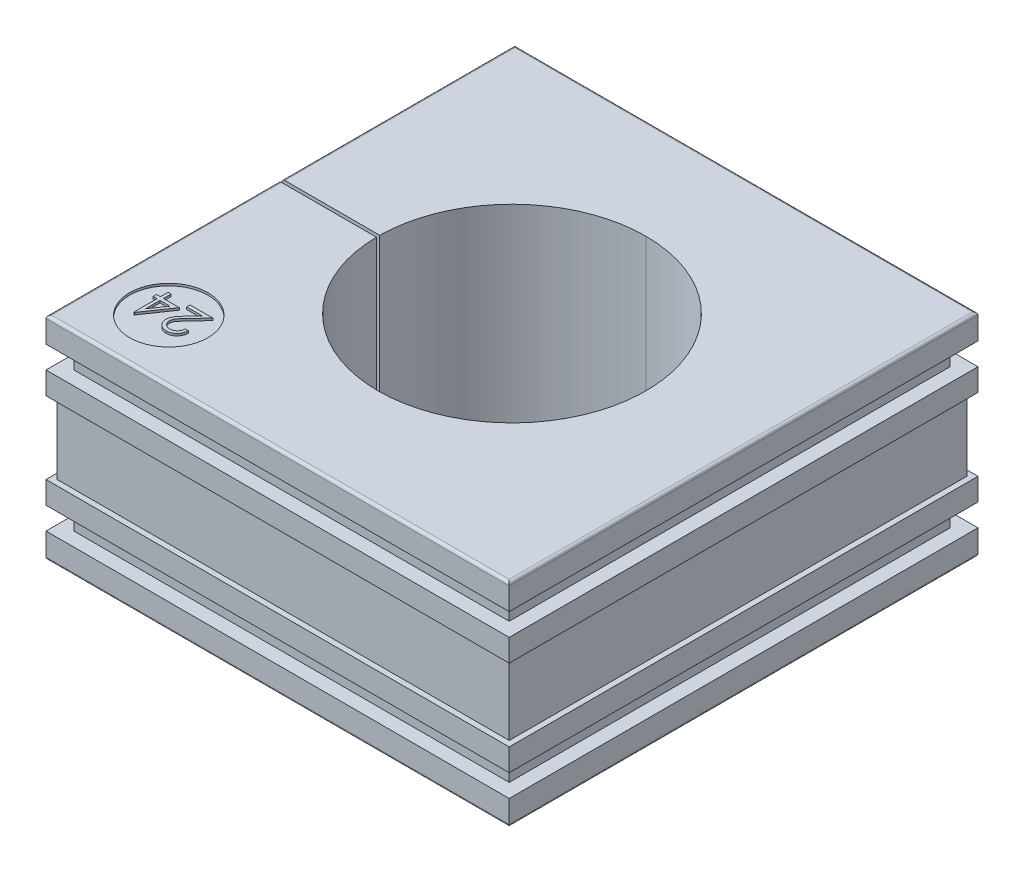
ISO-10303-21;
HEADER;
FILE_DESCRIPTION(('STEP AP214'),'2;1');
FILE_NAME('part.step','',(''),(''),'','','');
FILE_SCHEMA(('AUTOMOTIVE_DESIGN { 1 0 10303 214 1 1 1 1 }'));
ENDSEC;
DATA;
#1=APPLICATION_CONTEXT('core data for automotive mechanical design processes');
#2=APPLICATION_PROTOCOL_DEFINITION('international standard','automotive_design',2000,#1);
#3=PRODUCT_CONTEXT('',#1,'mechanical');
#4=PRODUCT('Part','Part','',(#3));
#5=PRODUCT_RELATED_PRODUCT_CATEGORY('part','',(#4));
#6=PRODUCT_DEFINITION_FORMATION('','',#4);
#7=PRODUCT_DEFINITION_CONTEXT('part definition',#1,'design');
#8=PRODUCT_DEFINITION('design','',#6,#7);
#9=PRODUCT_DEFINITION_SHAPE('','',#8);
#10=(LENGTH_UNIT() NAMED_UNIT(*) SI_UNIT(.MILLI.,.METRE.));
#11=(NAMED_UNIT(*) PLANE_ANGLE_UNIT() SI_UNIT($,.RADIAN.));
#12=(NAMED_UNIT(*) SI_UNIT($,.STERADIAN.) SOLID_ANGLE_UNIT());
#13=UNCERTAINTY_MEASURE_WITH_UNIT(LENGTH_MEASURE(1.E-05),#10,'distance_accuracy_value','');
#14=(GEOMETRIC_REPRESENTATION_CONTEXT(3) GLOBAL_UNCERTAINTY_ASSIGNED_CONTEXT((#13)) GLOBAL_UNIT_ASSIGNED_CONTEXT((#10,
#11,#12)) REPRESENTATION_CONTEXT('',''));
#15=CARTESIAN_POINT('',(0.,0.,0.));
#16=DIRECTION('',(0.,0.,1.));
#17=DIRECTION('',(1.,0.,0.));
#18=AXIS2_PLACEMENT_3D('',#15,#16,#17);
#19=CARTESIAN_POINT('',(-13.6443504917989,19.,16.3222612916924));
#20=DIRECTION('',(2.19766562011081E-13,-1.,2.86781024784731E-12));
#21=DIRECTION('',(-1.,-2.19766562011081E-13,0.));
#22=AXIS2_PLACEMENT_3D('',#19,#20,#21);
#23=PLANE('',#22);
#24=CARTESIAN_POINT('',(-14.1376201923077,19.,16.5192307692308));
#25=CARTESIAN_POINT('',(-14.1141534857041,19.,16.518642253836));
#26=CARTESIAN_POINT('',(-14.0680687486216,19.,16.517486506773));
#27=CARTESIAN_POINT('',(-14.0005515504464,19.,16.5087268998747));
#28=CARTESIAN_POINT('',(-13.9356915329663,19.,16.4954609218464));
#29=CARTESIAN_POINT('',(-13.8744881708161,19.,16.4743415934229));
#30=CARTESIAN_POINT('',(-13.8156605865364,19.,16.4496241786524));
#31=CARTESIAN_POINT('',(-13.7607095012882,19.,16.4176194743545));
#32=CARTESIAN_POINT('',(-13.7080912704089,19.,16.3810491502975));
#33=CARTESIAN_POINT('',(-13.6588637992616,19.,16.3384104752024));
#34=CARTESIAN_POINT('',(-13.6140282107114,19.,16.2902778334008));
#35=CARTESIAN_POINT('',(-13.573240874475,19.,16.2378863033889));
#36=CARTESIAN_POINT('',(-13.5386813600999,19.,16.1803070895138));
#37=CARTESIAN_POINT('',(-13.5080032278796,19.,16.1189218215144));
#38=CARTESIAN_POINT('',(-13.4845405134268,19.,16.052043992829));
#39=CARTESIAN_POINT('',(-13.4644815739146,19.,15.9813091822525));
#40=CARTESIAN_POINT('',(-13.4499110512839,19.,15.9057081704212));
#41=CARTESIAN_POINT('',(-13.4448842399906,19.,15.8536209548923));
#42=CARTESIAN_POINT('',(-13.4423076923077,19.,15.826923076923));
#43=(BOUNDED_CURVE() B_SPLINE_CURVE(3,(#24,#25,#26,#27,#28,#29,#30,#31,#32,#33,#34,#35,#36,#37,
#38,#39,#40,#41,#42),.UNSPECIFIED.,.F.,.F.) B_SPLINE_CURVE_WITH_KNOTS((4,1,1,1,1,1,1,1,1,1,1,1,
1,1,1,1,4),(0.,0.0644420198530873,0.126553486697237,0.186778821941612,0.245943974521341,
0.304110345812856,0.361785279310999,0.420255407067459,0.479942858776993,0.54028623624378,
0.600712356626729,0.661962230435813,0.724472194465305,0.788881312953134,0.856306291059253,
0.926348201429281,1.),
.UNSPECIFIED.) CURVE() GEOMETRIC_REPRESENTATION_ITEM() RATIONAL_B_SPLINE_CURVE((1.,1.,1.,1.,1.,
1.,1.,1.,1.,1.,1.,1.,1.,1.,1.,1.,1.,1.,1.)) REPRESENTATION_ITEM(''));
#44=CARTESIAN_POINT('',(-14.1376201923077,19.,16.5192307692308));
#45=VERTEX_POINT('',#44);
#46=CARTESIAN_POINT('',(-13.4423076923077,19.,15.826923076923));
#47=VERTEX_POINT('',#46);
#48=EDGE_CURVE('E1564',#45,#47,#43,.T.);
#49=ORIENTED_EDGE('',*,*,#48,.F.);
#50=CARTESIAN_POINT('',(-14.7884615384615,19.,15.9110576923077));
#51=CARTESIAN_POINT('',(-14.7879222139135,19.,15.9315297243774));
#52=CARTESIAN_POINT('',(-14.7868593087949,19.,15.9718761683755));
#53=CARTESIAN_POINT('',(-14.7773009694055,19.,16.0309915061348));
#54=CARTESIAN_POINT('',(-14.7632578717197,19.,16.0882362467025));
#55=CARTESIAN_POINT('',(-14.7416131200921,19.,16.1429025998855));
#56=CARTESIAN_POINT('',(-14.7156077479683,19.,16.1960657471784));
#57=CARTESIAN_POINT('',(-14.6823839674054,19.,16.2461093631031));
#58=CARTESIAN_POINT('',(-14.6444179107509,19.,16.2947393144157));
#59=CARTESIAN_POINT('',(-14.6003791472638,19.,16.3402881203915));
#60=CARTESIAN_POINT('',(-14.5520327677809,19.,16.3820178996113));
#61=CARTESIAN_POINT('',(-14.5009503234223,19.,16.4189806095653));
#62=CARTESIAN_POINT('',(-14.4469078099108,19.,16.4498714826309));
#63=CARTESIAN_POINT('',(-14.3901304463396,19.,16.4751944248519));
#64=CARTESIAN_POINT('',(-14.3307772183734,19.,16.4950590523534));
#65=CARTESIAN_POINT('',(-14.2687331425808,19.,16.5088235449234));
#66=CARTESIAN_POINT('',(-14.2041697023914,19.,16.5174656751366));
#67=CARTESIAN_POINT('',(-14.1600838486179,19.,16.518634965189));
#68=CARTESIAN_POINT('',(-14.1376201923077,19.,16.5192307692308));
#69=(BOUNDED_CURVE() B_SPLINE_CURVE(3,(#50,#51,#52,#53,#54,#55,#56,#57,#58,#59,#60,#61,#62,#63,
#64,#65,#66,#67,#68),.UNSPECIFIED.,.F.,.F.) B_SPLINE_CURVE_WITH_KNOTS((4,1,1,1,1,1,1,1,1,1,1,1,
1,1,1,1,4),(0.,0.0619690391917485,0.122129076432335,0.180999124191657,0.240162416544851,
0.29986472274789,0.359951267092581,0.421741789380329,0.486545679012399,0.551508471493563,
0.614994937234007,0.677239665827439,0.739714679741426,0.803038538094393,0.866487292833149,
0.931969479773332,1.),
.UNSPECIFIED.) CURVE() GEOMETRIC_REPRESENTATION_ITEM() RATIONAL_B_SPLINE_CURVE((1.,1.,1.,1.,1.,
1.,1.,1.,1.,1.,1.,1.,1.,1.,1.,1.,1.,1.,1.)) REPRESENTATION_ITEM(''));
#70=CARTESIAN_POINT('',(-14.7884615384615,19.,15.9110576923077));
#71=VERTEX_POINT('',#70);
#72=EDGE_CURVE('E886',#71,#45,#69,.T.);
#73=ORIENTED_EDGE('',*,*,#72,.F.);
#74=CARTESIAN_POINT('',(-14.2211538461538,19.,14.9915865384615));
#75=CARTESIAN_POINT('',(-14.2494826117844,19.,15.0211549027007));
#76=CARTESIAN_POINT('',(-14.3038963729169,19.,15.0779496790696));
#77=CARTESIAN_POINT('',(-14.3808264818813,19.,15.1608934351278));
#78=CARTESIAN_POINT('',(-14.4500332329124,19.,15.2377511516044));
#79=CARTESIAN_POINT('',(-14.5115625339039,19.,15.3088634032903));
#80=CARTESIAN_POINT('',(-14.5654650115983,19.,15.3738270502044));
#81=CARTESIAN_POINT('',(-14.6115682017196,19.,15.4331511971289));
#82=CARTESIAN_POINT('',(-14.650075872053,19.,15.4863267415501));
#83=CARTESIAN_POINT('',(-14.6908859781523,19.,15.5487951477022));
#84=CARTESIAN_POINT('',(-14.729801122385,19.,15.6251558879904));
#85=CARTESIAN_POINT('',(-14.7640035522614,19.,15.7180033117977));
#86=CARTESIAN_POINT('',(-14.7847092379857,19.,15.8137938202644));
#87=CARTESIAN_POINT('',(-14.7872057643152,19.,15.8785066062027));
#88=CARTESIAN_POINT('',(-14.7884615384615,19.,15.9110576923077));
#89=(BOUNDED_CURVE() B_SPLINE_CURVE(3,(#74,#75,#76,#77,#78,#79,#80,#81,#82,#83,#84,#85,#86,#87,
#88),.UNSPECIFIED.,.F.,.F.) B_SPLINE_CURVE_WITH_KNOTS((4,1,1,1,1,1,1,1,1,1,1,1,4),(0.,
0.110794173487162,0.212812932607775,0.306077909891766,0.390617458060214,0.467232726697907,
0.534450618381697,0.59386680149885,0.644832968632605,0.73622061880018,0.825037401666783,
0.911992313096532,1.),
.UNSPECIFIED.) CURVE() GEOMETRIC_REPRESENTATION_ITEM() RATIONAL_B_SPLINE_CURVE((1.,1.,1.,1.,1.,
1.,1.,1.,1.,1.,1.,1.,1.,1.,1.)) REPRESENTATION_ITEM(''));
#90=CARTESIAN_POINT('',(-14.2211538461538,19.,14.9915865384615));
#91=VERTEX_POINT('',#90);
#92=EDGE_CURVE('E1585',#91,#71,#89,.T.);
#93=ORIENTED_EDGE('',*,*,#92,.F.);
#94=DIRECTION('',(-0.683776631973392,0.,0.729691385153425));
#95=VECTOR('',#94,1.);
#96=CARTESIAN_POINT('',(-13.0576923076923,19.,13.75));
#97=LINE('',#96,#95);
#98=CARTESIAN_POINT('',(-13.0576923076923,19.,13.75));
#99=VERTEX_POINT('',#98);
#100=EDGE_CURVE('E1227',#99,#91,#97,.T.);
#101=ORIENTED_EDGE('',*,*,#100,.F.);
#102=DIRECTION('',(1.,0.,0.));
#103=VECTOR('',#102,1.);
#104=CARTESIAN_POINT('',(-15.0961538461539,19.,13.75));
#105=LINE('',#104,#103);
#106=CARTESIAN_POINT('',(-15.0961538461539,19.,13.75));
#107=VERTEX_POINT('',#106);
#108=EDGE_CURVE('E1226',#107,#99,#105,.T.);
#109=ORIENTED_EDGE('',*,*,#108,.F.);
#110=DIRECTION('',(0.,0.,-1.));
#111=VECTOR('',#110,1.);
#112=CARTESIAN_POINT('',(-15.0961538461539,19.,14.0576923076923));
#113=LINE('',#112,#111);
#114=CARTESIAN_POINT('',(-15.0961538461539,19.,14.0576923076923));
#115=VERTEX_POINT('',#114);
#116=EDGE_CURVE('E1603',#115,#107,#113,.T.);
#117=ORIENTED_EDGE('',*,*,#116,.F.);
#118=DIRECTION('',(-1.,0.,0.));
#119=VECTOR('',#118,1.);
#120=CARTESIAN_POINT('',(-13.7001201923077,19.,14.0576923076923));
#121=LINE('',#120,#119);
#122=CARTESIAN_POINT('',(-13.7001201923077,19.,14.0576923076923));
#123=VERTEX_POINT('',#122);
#124=EDGE_CURVE('E1609',#123,#115,#121,.T.);
#125=ORIENTED_EDGE('',*,*,#124,.F.);
#126=DIRECTION('',(0.683740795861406,0.,-0.729724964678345));
#127=VECTOR('',#126,1.);
#128=CARTESIAN_POINT('',(-14.4507211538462,19.,14.8587740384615));
#129=LINE('',#128,#127);
#130=CARTESIAN_POINT('',(-14.4507211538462,19.,14.8587740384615));
#131=VERTEX_POINT('',#130);
#132=EDGE_CURVE('E1615',#131,#123,#129,.T.);
#133=ORIENTED_EDGE('',*,*,#132,.F.);
#134=CARTESIAN_POINT('',(-15.0576923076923,19.,15.9350961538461));
#135=CARTESIAN_POINT('',(-15.0562409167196,19.,15.89331231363));
#136=CARTESIAN_POINT('',(-15.0533636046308,19.,15.8104778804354));
#137=CARTESIAN_POINT('',(-15.0287516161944,19.,15.6887505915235));
#138=CARTESIAN_POINT('',(-14.9903104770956,19.,15.5708143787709));
#139=CARTESIAN_POINT('',(-14.9440311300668,19.,15.4758934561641));
#140=CARTESIAN_POINT('',(-14.8973312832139,19.,15.3994148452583));
#141=CARTESIAN_POINT('',(-14.8552900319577,19.,15.336415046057));
#142=CARTESIAN_POINT('',(-14.8057938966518,19.,15.2685990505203));
#143=CARTESIAN_POINT('',(-14.7492657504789,19.,15.1956923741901));
#144=CARTESIAN_POINT('',(-14.6847320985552,19.,15.1186497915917));
#145=CARTESIAN_POINT('',(-14.6138695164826,19.,15.0358994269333));
#146=CARTESIAN_POINT('',(-14.5348479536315,19.,14.9489713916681));
#147=CARTESIAN_POINT('',(-14.4794348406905,19.,14.8895596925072));
#148=CARTESIAN_POINT('',(-14.4507211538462,19.,14.8587740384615));
#149=(BOUNDED_CURVE() B_SPLINE_CURVE(3,(#134,#135,#136,#137,#138,#139,#140,#141,#142,#143,#144,
#145,#146,#147,#148),.UNSPECIFIED.,.F.,.F.) B_SPLINE_CURVE_WITH_KNOTS((4,1,1,1,1,1,1,1,1,1,1,1,
4),(0.,0.0987013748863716,0.195670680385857,0.292419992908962,0.391339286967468,
0.444458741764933,0.504224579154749,0.570347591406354,0.642913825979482,0.722289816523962,
0.80792272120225,0.900470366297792,1.),
.UNSPECIFIED.) CURVE() GEOMETRIC_REPRESENTATION_ITEM() RATIONAL_B_SPLINE_CURVE((1.,1.,1.,1.,1.,
1.,1.,1.,1.,1.,1.,1.,1.,1.,1.)) REPRESENTATION_ITEM(''));
#150=CARTESIAN_POINT('',(-15.0576923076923,19.,15.9350961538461));
#151=VERTEX_POINT('',#150);
#152=EDGE_CURVE('E1184',#151,#131,#149,.T.);
#153=ORIENTED_EDGE('',*,*,#152,.F.);
#154=CARTESIAN_POINT('',(-14.1514423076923,19.,16.826923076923));
#155=CARTESIAN_POINT('',(-14.1843401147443,19.,16.8261592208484));
#156=CARTESIAN_POINT('',(-14.2489831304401,19.,16.8246582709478));
#157=CARTESIAN_POINT('',(-14.3432892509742,19.,16.8115746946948));
#158=CARTESIAN_POINT('',(-14.4332799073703,19.,16.7915252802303));
#159=CARTESIAN_POINT('',(-14.517935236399,19.,16.7618152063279));
#160=CARTESIAN_POINT('',(-14.5981240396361,19.,16.7245355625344));
#161=CARTESIAN_POINT('',(-14.6728534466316,19.,16.6781734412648));
#162=CARTESIAN_POINT('',(-14.7439304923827,19.,16.6249225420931));
#163=CARTESIAN_POINT('',(-14.8078668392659,19.,16.5621104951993));
#164=CARTESIAN_POINT('',(-14.8666000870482,19.,16.4950898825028));
#165=CARTESIAN_POINT('',(-14.9172245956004,19.,16.4235124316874));
#166=CARTESIAN_POINT('',(-14.9608228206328,19.,16.3494991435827));
#167=CARTESIAN_POINT('',(-14.9965066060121,19.,16.2724718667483));
#168=CARTESIAN_POINT('',(-15.0235565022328,19.,16.192179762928));
#169=CARTESIAN_POINT('',(-15.0435978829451,19.,16.1093926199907));
#170=CARTESIAN_POINT('',(-15.0550546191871,19.,16.0231550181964));
#171=CARTESIAN_POINT('',(-15.0568032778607,19.,15.9647762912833));
#172=CARTESIAN_POINT('',(-15.0576923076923,19.,15.9350961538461));
#173=(BOUNDED_CURVE() B_SPLINE_CURVE(3,(#154,#155,#156,#157,#158,#159,#160,#161,#162,#163,#164,
#165,#166,#167,#168,#169,#170,#171,#172),.UNSPECIFIED.,.F.,.F.) B_SPLINE_CURVE_WITH_KNOTS((4,1,
1,1,1,1,1,1,1,1,1,1,1,1,1,1,4),(0.,0.0694796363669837,0.136525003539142,0.200800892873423,
0.263983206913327,0.325711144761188,0.387270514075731,0.449492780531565,0.51295519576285,
0.576266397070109,0.637574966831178,0.697901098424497,0.757558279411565,0.816587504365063,
0.876645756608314,0.937285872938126,1.),
.UNSPECIFIED.) CURVE() GEOMETRIC_REPRESENTATION_ITEM() RATIONAL_B_SPLINE_CURVE((1.,1.,1.,1.,1.,
1.,1.,1.,1.,1.,1.,1.,1.,1.,1.,1.,1.,1.,1.)) REPRESENTATION_ITEM(''));
#174=CARTESIAN_POINT('',(-14.1514423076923,19.,16.826923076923));
#175=VERTEX_POINT('',#174);
#176=EDGE_CURVE('E1183',#175,#151,#173,.T.);
#177=ORIENTED_EDGE('',*,*,#176,.F.);
#178=CARTESIAN_POINT('',(-13.1730769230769,19.,15.826923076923));
#179=CARTESIAN_POINT('',(-13.1748313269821,19.,15.8626411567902));
#180=CARTESIAN_POINT('',(-13.1782769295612,19.,15.9327905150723));
#181=CARTESIAN_POINT('',(-13.1944196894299,19.,16.0350656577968));
#182=CARTESIAN_POINT('',(-13.2174965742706,19.,16.1328359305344));
#183=CARTESIAN_POINT('',(-13.2502019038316,19.,16.2252631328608));
#184=CARTESIAN_POINT('',(-13.2905901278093,19.,16.313451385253));
#185=CARTESIAN_POINT('',(-13.3400370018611,19.,16.3962296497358));
#186=CARTESIAN_POINT('',(-13.3974883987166,19.,16.4744194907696));
#187=CARTESIAN_POINT('',(-13.462838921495,19.,16.5465405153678));
#188=CARTESIAN_POINT('',(-13.5337502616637,19.,16.6124681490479));
#189=CARTESIAN_POINT('',(-13.609797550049,19.,16.6700025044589));
#190=CARTESIAN_POINT('',(-13.6901991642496,19.,16.7180572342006));
#191=CARTESIAN_POINT('',(-13.7742577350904,19.,16.7584483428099));
#192=CARTESIAN_POINT('',(-13.8629454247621,19.,16.7887299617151));
#193=CARTESIAN_POINT('',(-13.9554144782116,19.,16.8112082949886));
#194=CARTESIAN_POINT('',(-14.0520828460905,19.,16.8247301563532));
#195=CARTESIAN_POINT('',(-14.1179456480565,19.,16.8261837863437));
#196=CARTESIAN_POINT('',(-14.1514423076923,19.,16.826923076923));
#197=(BOUNDED_CURVE() B_SPLINE_CURVE(3,(#178,#179,#180,#181,#182,#183,#184,#185,#186,#187,#188,
#189,#190,#191,#192,#193,#194,#195,#196),.UNSPECIFIED.,.F.,.F.) B_SPLINE_CURVE_WITH_KNOTS((4,1,
1,1,1,1,1,1,1,1,1,1,1,1,1,1,4),(0.,0.0687985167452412,0.13511845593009,0.199001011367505,
0.261933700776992,0.323531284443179,0.385434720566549,0.447215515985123,0.510018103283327,
0.572510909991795,0.633364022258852,0.693216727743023,0.752555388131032,0.812558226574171,
0.873260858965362,0.935542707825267,1.),
.UNSPECIFIED.) CURVE() GEOMETRIC_REPRESENTATION_ITEM() RATIONAL_B_SPLINE_CURVE((1.,1.,1.,1.,1.,
1.,1.,1.,1.,1.,1.,1.,1.,1.,1.,1.,1.,1.,1.)) REPRESENTATION_ITEM(''));
#198=CARTESIAN_POINT('',(-13.1730769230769,19.,15.826923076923));
#199=VERTEX_POINT('',#198);
#200=EDGE_CURVE('E24',#199,#175,#197,.T.);
#201=ORIENTED_EDGE('',*,*,#200,.F.);
#202=DIRECTION('',(1.,0.,0.));
#203=VECTOR('',#202,1.);
#204=CARTESIAN_POINT('',(-13.4423076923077,19.,15.826923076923));
#205=LINE('',#204,#203);
#206=EDGE_CURVE('E9',#47,#199,#205,.T.);
#207=ORIENTED_EDGE('',*,*,#206,.F.);
#208=EDGE_LOOP('',(#49,#73,#93,#101,#109,#117,#125,#133,#153,#177,#201,#207));
#209=FACE_BOUND('',#208,.T.);
#210=ADVANCED_FACE('F15',(#209),#23,.F.);
#211=CARTESIAN_POINT('',(-13.4423076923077,19.,15.826923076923));
#212=DIRECTION('',(0.,0.,-1.));
#213=DIRECTION('',(0.,-1.,0.));
#214=AXIS2_PLACEMENT_3D('',#211,#212,#213);
#215=PLANE('',#214);
#216=DIRECTION('',(1.,0.,0.));
#217=VECTOR('',#216,1.);
#218=CARTESIAN_POINT('',(-13.4423076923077,18.8,15.826923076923));
#219=LINE('',#218,#217);
#220=CARTESIAN_POINT('',(-13.4423076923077,18.8,15.826923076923));
#221=VERTEX_POINT('',#220);
#222=CARTESIAN_POINT('',(-13.1730769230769,18.8,15.826923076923));
#223=VERTEX_POINT('',#222);
#224=EDGE_CURVE('E701',#221,#223,#219,.T.);
#225=ORIENTED_EDGE('',*,*,#224,.F.);
#226=DIRECTION('',(0.,-1.,0.));
#227=VECTOR('',#226,1.);
#228=CARTESIAN_POINT('',(-13.4423076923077,19.,15.826923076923));
#229=LINE('',#228,#227);
#230=EDGE_CURVE('E887',#47,#221,#229,.T.);
#231=ORIENTED_EDGE('',*,*,#230,.F.);
#232=ORIENTED_EDGE('',*,*,#206,.T.);
#233=DIRECTION('',(0.,-1.,0.));
#234=VECTOR('',#233,1.);
#235=CARTESIAN_POINT('',(-13.1730769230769,19.,15.826923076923));
#236=LINE('',#235,#234);
#237=EDGE_CURVE('E1632',#199,#223,#236,.T.);
#238=ORIENTED_EDGE('',*,*,#237,.T.);
#239=EDGE_LOOP('',(#225,#231,#232,#238));
#240=FACE_BOUND('',#239,.T.);
#241=ADVANCED_FACE('F17',(#240),#215,.T.);
#242=CARTESIAN_POINT('',(-13.1730769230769,19.,15.826923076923));
#243=CARTESIAN_POINT('',(-13.1730769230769,18.8,15.826923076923));
#244=CARTESIAN_POINT('',(-13.1748313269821,19.,15.8626411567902));
#245=CARTESIAN_POINT('',(-13.1748313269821,18.8,15.8626411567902));
#246=CARTESIAN_POINT('',(-13.1782769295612,19.,15.9327905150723));
#247=CARTESIAN_POINT('',(-13.1782769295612,18.8,15.9327905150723));
#248=CARTESIAN_POINT('',(-13.1944196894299,19.,16.0350656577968));
#249=CARTESIAN_POINT('',(-13.1944196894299,18.8,16.0350656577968));
#250=CARTESIAN_POINT('',(-13.2174965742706,19.,16.1328359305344));
#251=CARTESIAN_POINT('',(-13.2174965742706,18.8,16.1328359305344));
#252=CARTESIAN_POINT('',(-13.2502019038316,19.,16.2252631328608));
#253=CARTESIAN_POINT('',(-13.2502019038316,18.8,16.2252631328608));
#254=CARTESIAN_POINT('',(-13.2905901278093,19.,16.313451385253));
#255=CARTESIAN_POINT('',(-13.2905901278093,18.8,16.313451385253));
#256=CARTESIAN_POINT('',(-13.3400370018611,19.,16.3962296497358));
#257=CARTESIAN_POINT('',(-13.3400370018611,18.8,16.3962296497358));
#258=CARTESIAN_POINT('',(-13.3974883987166,19.,16.4744194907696));
#259=CARTESIAN_POINT('',(-13.3974883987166,18.8,16.4744194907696));
#260=CARTESIAN_POINT('',(-13.462838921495,19.,16.5465405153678));
#261=CARTESIAN_POINT('',(-13.462838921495,18.8,16.5465405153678));
#262=CARTESIAN_POINT('',(-13.5337502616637,19.,16.6124681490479));
#263=CARTESIAN_POINT('',(-13.5337502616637,18.8,16.6124681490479));
#264=CARTESIAN_POINT('',(-13.609797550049,19.,16.6700025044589));
#265=CARTESIAN_POINT('',(-13.609797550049,18.8,16.6700025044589));
#266=CARTESIAN_POINT('',(-13.6901991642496,19.,16.7180572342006));
#267=CARTESIAN_POINT('',(-13.6901991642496,18.8,16.7180572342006));
#268=CARTESIAN_POINT('',(-13.7742577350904,19.,16.7584483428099));
#269=CARTESIAN_POINT('',(-13.7742577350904,18.8,16.7584483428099));
#270=CARTESIAN_POINT('',(-13.8629454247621,19.,16.7887299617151));
#271=CARTESIAN_POINT('',(-13.8629454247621,18.8,16.7887299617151));
#272=CARTESIAN_POINT('',(-13.9554144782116,19.,16.8112082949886));
#273=CARTESIAN_POINT('',(-13.9554144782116,18.8,16.8112082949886));
#274=CARTESIAN_POINT('',(-14.0520828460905,19.,16.8247301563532));
#275=CARTESIAN_POINT('',(-14.0520828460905,18.8,16.8247301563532));
#276=CARTESIAN_POINT('',(-14.1179456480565,19.,16.8261837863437));
#277=CARTESIAN_POINT('',(-14.1179456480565,18.8,16.8261837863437));
#278=CARTESIAN_POINT('',(-14.1514423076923,19.,16.826923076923));
#279=CARTESIAN_POINT('',(-14.1514423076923,18.8,16.826923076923));
#280=(BOUNDED_SURFACE() B_SPLINE_SURFACE(3,1,((#242,#243),(#244,#245),(#246,#247),(#248,#249),
(#250,#251),(#252,#253),(#254,#255),(#256,#257),(#258,#259),(#260,#261),(#262,#263),(#264,#265),
(#266,#267),(#268,#269),(#270,#271),(#272,#273),(#274,#275),(#276,#277),(#278,#279)),
.UNSPECIFIED.,.F.,.F.,.F.) B_SPLINE_SURFACE_WITH_KNOTS((4,1,1,1,1,1,1,1,1,1,1,1,1,1,1,1,4),(2,
2),(0.,0.0687985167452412,0.13511845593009,0.199001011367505,0.261933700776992,
0.323531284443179,0.385434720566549,0.447215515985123,0.510018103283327,0.572510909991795,
0.633364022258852,0.693216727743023,0.752555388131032,0.812558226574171,0.873260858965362,
0.935542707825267,1.),(0.,1.),
.UNSPECIFIED.) GEOMETRIC_REPRESENTATION_ITEM() RATIONAL_B_SPLINE_SURFACE(((1.,1.),(1.,1.),(1.,
1.),(1.,1.),(1.,1.),(1.,1.),(1.,1.),(1.,1.),(1.,1.),(1.,1.),(1.,1.),(1.,1.),(1.,1.),(1.,1.),(1.,
1.),(1.,1.),(1.,1.),(1.,1.),(1.,1.))) REPRESENTATION_ITEM('') SURFACE());
#281=CARTESIAN_POINT('',(-13.1730769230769,18.8,15.826923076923));
#282=CARTESIAN_POINT('',(-13.1748313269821,18.8,15.8626411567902));
#283=CARTESIAN_POINT('',(-13.1782769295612,18.8,15.9327905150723));
#284=CARTESIAN_POINT('',(-13.1944196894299,18.8,16.0350656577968));
#285=CARTESIAN_POINT('',(-13.2174965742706,18.8,16.1328359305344));
#286=CARTESIAN_POINT('',(-13.2502019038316,18.8,16.2252631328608));
#287=CARTESIAN_POINT('',(-13.2905901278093,18.8,16.313451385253));
#288=CARTESIAN_POINT('',(-13.3400370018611,18.8,16.3962296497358));
#289=CARTESIAN_POINT('',(-13.3974883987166,18.8,16.4744194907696));
#290=CARTESIAN_POINT('',(-13.462838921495,18.8,16.5465405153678));
#291=CARTESIAN_POINT('',(-13.5337502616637,18.8,16.6124681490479));
#292=CARTESIAN_POINT('',(-13.609797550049,18.8,16.6700025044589));
#293=CARTESIAN_POINT('',(-13.6901991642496,18.8,16.7180572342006));
#294=CARTESIAN_POINT('',(-13.7742577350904,18.8,16.7584483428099));
#295=CARTESIAN_POINT('',(-13.8629454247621,18.8,16.7887299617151));
#296=CARTESIAN_POINT('',(-13.9554144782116,18.8,16.8112082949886));
#297=CARTESIAN_POINT('',(-14.0520828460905,18.8,16.8247301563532));
#298=CARTESIAN_POINT('',(-14.1179456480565,18.8,16.8261837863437));
#299=CARTESIAN_POINT('',(-14.1514423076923,18.8,16.826923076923));
#300=(BOUNDED_CURVE() B_SPLINE_CURVE(3,(#281,#282,#283,#284,#285,#286,#287,#288,#289,#290,#291,
#292,#293,#294,#295,#296,#297,#298,#299),.UNSPECIFIED.,.F.,.F.) B_SPLINE_CURVE_WITH_KNOTS((4,1,
1,1,1,1,1,1,1,1,1,1,1,1,1,1,4),(0.,0.0687985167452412,0.13511845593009,0.199001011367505,
0.261933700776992,0.323531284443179,0.385434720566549,0.447215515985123,0.510018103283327,
0.572510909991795,0.633364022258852,0.693216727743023,0.752555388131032,0.812558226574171,
0.873260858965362,0.935542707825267,1.),
.UNSPECIFIED.) CURVE() GEOMETRIC_REPRESENTATION_ITEM() RATIONAL_B_SPLINE_CURVE((1.,1.,1.,1.,1.,
1.,1.,1.,1.,1.,1.,1.,1.,1.,1.,1.,1.,1.,1.)) REPRESENTATION_ITEM(''));
#301=CARTESIAN_POINT('',(-14.1514423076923,18.8,16.826923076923));
#302=VERTEX_POINT('',#301);
#303=EDGE_CURVE('E733',#223,#302,#300,.T.);
#304=DIRECTION('',(0.,-1.,0.));
#305=VECTOR('',#304,1.);
#306=CARTESIAN_POINT('',(-14.1514423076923,19.,16.826923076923));
#307=LINE('',#306,#305);
#308=EDGE_CURVE('E1180',#175,#302,#307,.T.);
#309=ORIENTED_EDGE('',*,*,#303,.F.);
#310=ORIENTED_EDGE('',*,*,#237,.F.);
#311=ORIENTED_EDGE('',*,*,#200,.T.);
#312=ORIENTED_EDGE('',*,*,#308,.T.);
#313=EDGE_LOOP('',(#309,#310,#311,#312));
#314=FACE_BOUND('',#313,.T.);
#315=ADVANCED_FACE('F1804',(#314),#280,.T.);
#316=CARTESIAN_POINT('',(-14.1514423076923,19.,16.826923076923));
#317=CARTESIAN_POINT('',(-14.1514423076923,18.8,16.826923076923));
#318=CARTESIAN_POINT('',(-14.1843401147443,19.,16.8261592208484));
#319=CARTESIAN_POINT('',(-14.1843401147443,18.8,16.8261592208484));
#320=CARTESIAN_POINT('',(-14.2489831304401,19.,16.8246582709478));
#321=CARTESIAN_POINT('',(-14.2489831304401,18.8,16.8246582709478));
#322=CARTESIAN_POINT('',(-14.3432892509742,19.,16.8115746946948));
#323=CARTESIAN_POINT('',(-14.3432892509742,18.8,16.8115746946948));
#324=CARTESIAN_POINT('',(-14.4332799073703,19.,16.7915252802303));
#325=CARTESIAN_POINT('',(-14.4332799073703,18.8,16.7915252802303));
#326=CARTESIAN_POINT('',(-14.517935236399,19.,16.7618152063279));
#327=CARTESIAN_POINT('',(-14.517935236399,18.8,16.7618152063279));
#328=CARTESIAN_POINT('',(-14.5981240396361,19.,16.7245355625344));
#329=CARTESIAN_POINT('',(-14.5981240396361,18.8,16.7245355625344));
#330=CARTESIAN_POINT('',(-14.6728534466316,19.,16.6781734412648));
#331=CARTESIAN_POINT('',(-14.6728534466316,18.8,16.6781734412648));
#332=CARTESIAN_POINT('',(-14.7439304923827,19.,16.6249225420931));
#333=CARTESIAN_POINT('',(-14.7439304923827,18.8,16.6249225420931));
#334=CARTESIAN_POINT('',(-14.8078668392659,19.,16.5621104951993));
#335=CARTESIAN_POINT('',(-14.8078668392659,18.8,16.5621104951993));
#336=CARTESIAN_POINT('',(-14.8666000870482,19.,16.4950898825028));
#337=CARTESIAN_POINT('',(-14.8666000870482,18.8,16.4950898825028));
#338=CARTESIAN_POINT('',(-14.9172245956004,19.,16.4235124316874));
#339=CARTESIAN_POINT('',(-14.9172245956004,18.8,16.4235124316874));
#340=CARTESIAN_POINT('',(-14.9608228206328,19.,16.3494991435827));
#341=CARTESIAN_POINT('',(-14.9608228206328,18.8,16.3494991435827));
#342=CARTESIAN_POINT('',(-14.9965066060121,19.,16.2724718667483));
#343=CARTESIAN_POINT('',(-14.9965066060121,18.8,16.2724718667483));
#344=CARTESIAN_POINT('',(-15.0235565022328,19.,16.192179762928));
#345=CARTESIAN_POINT('',(-15.0235565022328,18.8,16.192179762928));
#346=CARTESIAN_POINT('',(-15.0435978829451,19.,16.1093926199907));
#347=CARTESIAN_POINT('',(-15.0435978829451,18.8,16.1093926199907));
#348=CARTESIAN_POINT('',(-15.0550546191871,19.,16.0231550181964));
#349=CARTESIAN_POINT('',(-15.0550546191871,18.8,16.0231550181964));
#350=CARTESIAN_POINT('',(-15.0568032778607,19.,15.9647762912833));
#351=CARTESIAN_POINT('',(-15.0568032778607,18.8,15.9647762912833));
#352=CARTESIAN_POINT('',(-15.0576923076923,19.,15.9350961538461));
#353=CARTESIAN_POINT('',(-15.0576923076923,18.8,15.9350961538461));
#354=(BOUNDED_SURFACE() B_SPLINE_SURFACE(3,1,((#316,#317),(#318,#319),(#320,#321),(#322,#323),
(#324,#325),(#326,#327),(#328,#329),(#330,#331),(#332,#333),(#334,#335),(#336,#337),(#338,#339),
(#340,#341),(#342,#343),(#344,#345),(#346,#347),(#348,#349),(#350,#351),(#352,#353)),
.UNSPECIFIED.,.F.,.F.,.F.) B_SPLINE_SURFACE_WITH_KNOTS((4,1,1,1,1,1,1,1,1,1,1,1,1,1,1,1,4),(2,
2),(0.,0.0694796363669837,0.136525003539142,0.200800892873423,0.263983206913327,
0.325711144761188,0.387270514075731,0.449492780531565,0.51295519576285,0.576266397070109,
0.637574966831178,0.697901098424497,0.757558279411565,0.816587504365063,0.876645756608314,
0.937285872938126,1.),(0.,1.),
.UNSPECIFIED.) GEOMETRIC_REPRESENTATION_ITEM() RATIONAL_B_SPLINE_SURFACE(((1.,1.),(1.,1.),(1.,
1.),(1.,1.),(1.,1.),(1.,1.),(1.,1.),(1.,1.),(1.,1.),(1.,1.),(1.,1.),(1.,1.),(1.,1.),(1.,1.),(1.,
1.),(1.,1.),(1.,1.),(1.,1.),(1.,1.))) REPRESENTATION_ITEM('') SURFACE());
#355=CARTESIAN_POINT('',(-14.1514423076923,18.8,16.826923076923));
#356=CARTESIAN_POINT('',(-14.1843401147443,18.8,16.8261592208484));
#357=CARTESIAN_POINT('',(-14.2489831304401,18.8,16.8246582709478));
#358=CARTESIAN_POINT('',(-14.3432892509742,18.8,16.8115746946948));
#359=CARTESIAN_POINT('',(-14.4332799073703,18.8,16.7915252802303));
#360=CARTESIAN_POINT('',(-14.517935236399,18.8,16.7618152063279));
#361=CARTESIAN_POINT('',(-14.5981240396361,18.8,16.7245355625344));
#362=CARTESIAN_POINT('',(-14.6728534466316,18.8,16.6781734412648));
#363=CARTESIAN_POINT('',(-14.7439304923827,18.8,16.6249225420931));
#364=CARTESIAN_POINT('',(-14.8078668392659,18.8,16.5621104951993));
#365=CARTESIAN_POINT('',(-14.8666000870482,18.8,16.4950898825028));
#366=CARTESIAN_POINT('',(-14.9172245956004,18.8,16.4235124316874));
#367=CARTESIAN_POINT('',(-14.9608228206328,18.8,16.3494991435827));
#368=CARTESIAN_POINT('',(-14.9965066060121,18.8,16.2724718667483));
#369=CARTESIAN_POINT('',(-15.0235565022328,18.8,16.192179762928));
#370=CARTESIAN_POINT('',(-15.0435978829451,18.8,16.1093926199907));
#371=CARTESIAN_POINT('',(-15.0550546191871,18.8,16.0231550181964));
#372=CARTESIAN_POINT('',(-15.0568032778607,18.8,15.9647762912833));
#373=CARTESIAN_POINT('',(-15.0576923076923,18.8,15.9350961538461));
#374=(BOUNDED_CURVE() B_SPLINE_CURVE(3,(#355,#356,#357,#358,#359,#360,#361,#362,#363,#364,#365,
#366,#367,#368,#369,#370,#371,#372,#373),.UNSPECIFIED.,.F.,.F.) B_SPLINE_CURVE_WITH_KNOTS((4,1,
1,1,1,1,1,1,1,1,1,1,1,1,1,1,4),(0.,0.0694796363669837,0.136525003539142,0.200800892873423,
0.263983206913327,0.325711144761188,0.387270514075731,0.449492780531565,0.51295519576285,
0.576266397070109,0.637574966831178,0.697901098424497,0.757558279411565,0.816587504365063,
0.876645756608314,0.937285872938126,1.),
.UNSPECIFIED.) CURVE() GEOMETRIC_REPRESENTATION_ITEM() RATIONAL_B_SPLINE_CURVE((1.,1.,1.,1.,1.,
1.,1.,1.,1.,1.,1.,1.,1.,1.,1.,1.,1.,1.,1.)) REPRESENTATION_ITEM(''));
#375=CARTESIAN_POINT('',(-15.0576923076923,18.8,15.9350961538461));
#376=VERTEX_POINT('',#375);
#377=EDGE_CURVE('E726',#302,#376,#374,.T.);
#378=DIRECTION('',(0.,-1.,0.));
#379=VECTOR('',#378,1.);
#380=CARTESIAN_POINT('',(-15.0576923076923,19.,15.9350961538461));
#381=LINE('',#380,#379);
#382=EDGE_CURVE('E1618',#151,#376,#381,.T.);
#383=ORIENTED_EDGE('',*,*,#377,.F.);
#384=ORIENTED_EDGE('',*,*,#308,.F.);
#385=ORIENTED_EDGE('',*,*,#176,.T.);
#386=ORIENTED_EDGE('',*,*,#382,.T.);
#387=EDGE_LOOP('',(#383,#384,#385,#386));
#388=FACE_BOUND('',#387,.T.);
#389=ADVANCED_FACE('F1799',(#388),#354,.T.);
#390=CARTESIAN_POINT('',(-15.0576923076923,19.,15.9350961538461));
#391=CARTESIAN_POINT('',(-15.0576923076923,18.8,15.9350961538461));
#392=CARTESIAN_POINT('',(-15.0562409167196,19.,15.89331231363));
#393=CARTESIAN_POINT('',(-15.0562409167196,18.8,15.89331231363));
#394=CARTESIAN_POINT('',(-15.0533636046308,19.,15.8104778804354));
#395=CARTESIAN_POINT('',(-15.0533636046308,18.8,15.8104778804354));
#396=CARTESIAN_POINT('',(-15.0287516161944,19.,15.6887505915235));
#397=CARTESIAN_POINT('',(-15.0287516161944,18.8,15.6887505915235));
#398=CARTESIAN_POINT('',(-14.9903104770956,19.,15.5708143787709));
#399=CARTESIAN_POINT('',(-14.9903104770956,18.8,15.5708143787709));
#400=CARTESIAN_POINT('',(-14.9440311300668,19.,15.4758934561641));
#401=CARTESIAN_POINT('',(-14.9440311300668,18.8,15.4758934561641));
#402=CARTESIAN_POINT('',(-14.8973312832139,19.,15.3994148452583));
#403=CARTESIAN_POINT('',(-14.8973312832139,18.8,15.3994148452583));
#404=CARTESIAN_POINT('',(-14.8552900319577,19.,15.336415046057));
#405=CARTESIAN_POINT('',(-14.8552900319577,18.8,15.336415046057));
#406=CARTESIAN_POINT('',(-14.8057938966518,19.,15.2685990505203));
#407=CARTESIAN_POINT('',(-14.8057938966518,18.8,15.2685990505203));
#408=CARTESIAN_POINT('',(-14.7492657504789,19.,15.1956923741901));
#409=CARTESIAN_POINT('',(-14.7492657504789,18.8,15.1956923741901));
#410=CARTESIAN_POINT('',(-14.6847320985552,19.,15.1186497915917));
#411=CARTESIAN_POINT('',(-14.6847320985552,18.8,15.1186497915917));
#412=CARTESIAN_POINT('',(-14.6138695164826,19.,15.0358994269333));
#413=CARTESIAN_POINT('',(-14.6138695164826,18.8,15.0358994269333));
#414=CARTESIAN_POINT('',(-14.5348479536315,19.,14.9489713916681));
#415=CARTESIAN_POINT('',(-14.5348479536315,18.8,14.9489713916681));
#416=CARTESIAN_POINT('',(-14.4794348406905,19.,14.8895596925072));
#417=CARTESIAN_POINT('',(-14.4794348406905,18.8,14.8895596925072));
#418=CARTESIAN_POINT('',(-14.4507211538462,19.,14.8587740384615));
#419=CARTESIAN_POINT('',(-14.4507211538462,18.8,14.8587740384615));
#420=(BOUNDED_SURFACE() B_SPLINE_SURFACE(3,1,((#390,#391),(#392,#393),(#394,#395),(#396,#397),
(#398,#399),(#400,#401),(#402,#403),(#404,#405),(#406,#407),(#408,#409),(#410,#411),(#412,#413),
(#414,#415),(#416,#417),(#418,#419)),.UNSPECIFIED.,.F.,.F.,.F.) B_SPLINE_SURFACE_WITH_KNOTS((4,
1,1,1,1,1,1,1,1,1,1,1,4),(2,2),(0.,0.0987013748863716,0.195670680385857,0.292419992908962,
0.391339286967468,0.444458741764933,0.504224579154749,0.570347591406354,0.642913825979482,
0.722289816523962,0.80792272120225,0.900470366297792,1.),(0.,1.),
.UNSPECIFIED.) GEOMETRIC_REPRESENTATION_ITEM() RATIONAL_B_SPLINE_SURFACE(((1.,1.),(1.,1.),(1.,
1.),(1.,1.),(1.,1.),(1.,1.),(1.,1.),(1.,1.),(1.,1.),(1.,1.),(1.,1.),(1.,1.),(1.,1.),(1.,1.),(1.,1.))) REPRESENTATION_ITEM('') SURFACE());
#421=CARTESIAN_POINT('',(-15.0576923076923,18.8,15.9350961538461));
#422=CARTESIAN_POINT('',(-15.0562409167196,18.8,15.89331231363));
#423=CARTESIAN_POINT('',(-15.0533636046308,18.8,15.8104778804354));
#424=CARTESIAN_POINT('',(-15.0287516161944,18.8,15.6887505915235));
#425=CARTESIAN_POINT('',(-14.9903104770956,18.8,15.5708143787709));
#426=CARTESIAN_POINT('',(-14.9440311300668,18.8,15.4758934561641));
#427=CARTESIAN_POINT('',(-14.8973312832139,18.8,15.3994148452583));
#428=CARTESIAN_POINT('',(-14.8552900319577,18.8,15.336415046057));
#429=CARTESIAN_POINT('',(-14.8057938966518,18.8,15.2685990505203));
#430=CARTESIAN_POINT('',(-14.7492657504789,18.8,15.1956923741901));
#431=CARTESIAN_POINT('',(-14.6847320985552,18.8,15.1186497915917));
#432=CARTESIAN_POINT('',(-14.6138695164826,18.8,15.0358994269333));
#433=CARTESIAN_POINT('',(-14.5348479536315,18.8,14.9489713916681));
#434=CARTESIAN_POINT('',(-14.4794348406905,18.8,14.8895596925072));
#435=CARTESIAN_POINT('',(-14.4507211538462,18.8,14.8587740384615));
#436=(BOUNDED_CURVE() B_SPLINE_CURVE(3,(#421,#422,#423,#424,#425,#426,#427,#428,#429,#430,#431,
#432,#433,#434,#435),.UNSPECIFIED.,.F.,.F.) B_SPLINE_CURVE_WITH_KNOTS((4,1,1,1,1,1,1,1,1,1,1,1,
4),(0.,0.0987013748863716,0.195670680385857,0.292419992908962,0.391339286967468,
0.444458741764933,0.504224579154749,0.570347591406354,0.642913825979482,0.722289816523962,
0.80792272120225,0.900470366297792,1.),
.UNSPECIFIED.) CURVE() GEOMETRIC_REPRESENTATION_ITEM() RATIONAL_B_SPLINE_CURVE((1.,1.,1.,1.,1.,
1.,1.,1.,1.,1.,1.,1.,1.,1.,1.)) REPRESENTATION_ITEM(''));
#437=CARTESIAN_POINT('',(-14.4507211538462,18.8,14.8587740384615));
#438=VERTEX_POINT('',#437);
#439=EDGE_CURVE('E732',#376,#438,#436,.T.);
#440=DIRECTION('',(0.,-1.,0.));
#441=VECTOR('',#440,1.);
#442=CARTESIAN_POINT('',(-14.4507211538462,19.,14.8587740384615));
#443=LINE('',#442,#441);
#444=EDGE_CURVE('E1612',#131,#438,#443,.T.);
#445=ORIENTED_EDGE('',*,*,#439,.F.);
#446=ORIENTED_EDGE('',*,*,#382,.F.);
#447=ORIENTED_EDGE('',*,*,#152,.T.);
#448=ORIENTED_EDGE('',*,*,#444,.T.);
#449=EDGE_LOOP('',(#445,#446,#447,#448));
#450=FACE_BOUND('',#449,.T.);
#451=ADVANCED_FACE('F1803',(#450),#420,.T.);
#452=CARTESIAN_POINT('',(-14.4507211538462,19.,14.8587740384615));
#453=DIRECTION('',(-0.729724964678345,0.,-0.683740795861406));
#454=DIRECTION('',(-0.683740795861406,0.,0.729724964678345));
#455=AXIS2_PLACEMENT_3D('',#452,#453,#454);
#456=PLANE('',#455);
#457=DIRECTION('',(0.683740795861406,0.,-0.729724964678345));
#458=VECTOR('',#457,1.);
#459=CARTESIAN_POINT('',(-14.4507211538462,18.8,14.8587740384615));
#460=LINE('',#459,#458);
#461=CARTESIAN_POINT('',(-13.7001201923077,18.8,14.0576923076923));
#462=VERTEX_POINT('',#461);
#463=EDGE_CURVE('E823',#438,#462,#460,.T.);
#464=ORIENTED_EDGE('',*,*,#463,.F.);
#465=ORIENTED_EDGE('',*,*,#444,.F.);
#466=ORIENTED_EDGE('',*,*,#132,.T.);
#467=DIRECTION('',(0.,-1.,0.));
#468=VECTOR('',#467,1.);
#469=CARTESIAN_POINT('',(-13.7001201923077,19.,14.0576923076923));
#470=LINE('',#469,#468);
#471=EDGE_CURVE('E1606',#123,#462,#470,.T.);
#472=ORIENTED_EDGE('',*,*,#471,.T.);
#473=EDGE_LOOP('',(#464,#465,#466,#472));
#474=FACE_BOUND('',#473,.T.);
#475=ADVANCED_FACE('F1651',(#474),#456,.T.);
#476=CARTESIAN_POINT('',(-13.7001201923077,19.,14.0576923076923));
#477=DIRECTION('',(0.,0.,1.));
#478=DIRECTION('',(1.,0.,0.));
#479=AXIS2_PLACEMENT_3D('',#476,#477,#478);
#480=PLANE('',#479);
#481=DIRECTION('',(-1.,0.,0.));
#482=VECTOR('',#481,1.);
#483=CARTESIAN_POINT('',(-13.7001201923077,18.8,14.0576923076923));
#484=LINE('',#483,#482);
#485=CARTESIAN_POINT('',(-15.0961538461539,18.8,14.0576923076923));
#486=VERTEX_POINT('',#485);
#487=EDGE_CURVE('E830',#462,#486,#484,.T.);
#488=ORIENTED_EDGE('',*,*,#487,.F.);
#489=ORIENTED_EDGE('',*,*,#471,.F.);
#490=ORIENTED_EDGE('',*,*,#124,.T.);
#491=DIRECTION('',(0.,-1.,0.));
#492=VECTOR('',#491,1.);
#493=CARTESIAN_POINT('',(-15.0961538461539,19.,14.0576923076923));
#494=LINE('',#493,#492);
#495=EDGE_CURVE('E1600',#115,#486,#494,.T.);
#496=ORIENTED_EDGE('',*,*,#495,.T.);
#497=EDGE_LOOP('',(#488,#489,#490,#496));
#498=FACE_BOUND('',#497,.T.);
#499=ADVANCED_FACE('F1646',(#498),#480,.T.);
#500=CARTESIAN_POINT('',(-15.0961538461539,19.,14.0576923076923));
#501=DIRECTION('',(-1.,0.,0.));
#502=DIRECTION('',(0.,0.,1.));
#503=AXIS2_PLACEMENT_3D('',#500,#501,#502);
#504=PLANE('',#503);
#505=DIRECTION('',(0.,0.,-1.));
#506=VECTOR('',#505,1.);
#507=CARTESIAN_POINT('',(-15.0961538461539,18.8,14.0576923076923));
#508=LINE('',#507,#506);
#509=CARTESIAN_POINT('',(-15.0961538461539,18.8,13.75));
#510=VERTEX_POINT('',#509);
#511=EDGE_CURVE('E834',#486,#510,#508,.T.);
#512=ORIENTED_EDGE('',*,*,#511,.F.);
#513=ORIENTED_EDGE('',*,*,#495,.F.);
#514=ORIENTED_EDGE('',*,*,#116,.T.);
#515=DIRECTION('',(0.,-1.,0.));
#516=VECTOR('',#515,1.);
#517=CARTESIAN_POINT('',(-15.0961538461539,19.,13.75));
#518=LINE('',#517,#516);
#519=EDGE_CURVE('E1223',#107,#510,#518,.T.);
#520=ORIENTED_EDGE('',*,*,#519,.T.);
#521=EDGE_LOOP('',(#512,#513,#514,#520));
#522=FACE_BOUND('',#521,.T.);
#523=ADVANCED_FACE('F1650',(#522),#504,.T.);
#524=CARTESIAN_POINT('',(-15.0961538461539,19.,13.75));
#525=DIRECTION('',(0.,0.,-1.));
#526=DIRECTION('',(0.,-1.,0.));
#527=AXIS2_PLACEMENT_3D('',#524,#525,#526);
#528=PLANE('',#527);
#529=DIRECTION('',(1.,0.,0.));
#530=VECTOR('',#529,1.);
#531=CARTESIAN_POINT('',(-15.0961538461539,18.8,13.75));
#532=LINE('',#531,#530);
#533=CARTESIAN_POINT('',(-13.0576923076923,18.8,13.75));
#534=VERTEX_POINT('',#533);
#535=EDGE_CURVE('E843',#510,#534,#532,.T.);
#536=ORIENTED_EDGE('',*,*,#535,.F.);
#537=ORIENTED_EDGE('',*,*,#519,.F.);
#538=ORIENTED_EDGE('',*,*,#108,.T.);
#539=DIRECTION('',(0.,-1.,0.));
#540=VECTOR('',#539,1.);
#541=CARTESIAN_POINT('',(-13.0576923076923,19.,13.75));
#542=LINE('',#541,#540);
#543=EDGE_CURVE('E1590',#99,#534,#542,.T.);
#544=ORIENTED_EDGE('',*,*,#543,.T.);
#545=EDGE_LOOP('',(#536,#537,#538,#544));
#546=FACE_BOUND('',#545,.T.);
#547=ADVANCED_FACE('F1909',(#546),#528,.T.);
#548=CARTESIAN_POINT('',(-13.0576923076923,19.,13.75));
#549=DIRECTION('',(0.729691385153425,0.,0.683776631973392));
#550=DIRECTION('',(0.,-1.,0.));
#551=AXIS2_PLACEMENT_3D('',#548,#549,#550);
#552=PLANE('',#551);
#553=DIRECTION('',(-0.683776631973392,0.,0.729691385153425));
#554=VECTOR('',#553,1.);
#555=CARTESIAN_POINT('',(-13.0576923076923,18.8,13.75));
#556=LINE('',#555,#554);
#557=CARTESIAN_POINT('',(-14.2211538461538,18.8,14.9915865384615));
#558=VERTEX_POINT('',#557);
#559=EDGE_CURVE('E852',#534,#558,#556,.T.);
#560=ORIENTED_EDGE('',*,*,#559,.F.);
#561=ORIENTED_EDGE('',*,*,#543,.F.);
#562=ORIENTED_EDGE('',*,*,#100,.T.);
#563=DIRECTION('',(0.,-1.,0.));
#564=VECTOR('',#563,1.);
#565=CARTESIAN_POINT('',(-14.2211538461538,19.,14.9915865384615));
#566=LINE('',#565,#564);
#567=EDGE_CURVE('E1579',#91,#558,#566,.T.);
#568=ORIENTED_EDGE('',*,*,#567,.T.);
#569=EDGE_LOOP('',(#560,#561,#562,#568));
#570=FACE_BOUND('',#569,.T.);
#571=ADVANCED_FACE('F1739',(#570),#552,.T.);
#572=CARTESIAN_POINT('',(-14.2211538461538,19.,14.9915865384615));
#573=CARTESIAN_POINT('',(-14.2211538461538,18.8,14.9915865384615));
#574=CARTESIAN_POINT('',(-14.2494826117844,19.,15.0211549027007));
#575=CARTESIAN_POINT('',(-14.2494826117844,18.8,15.0211549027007));
#576=CARTESIAN_POINT('',(-14.3038963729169,19.,15.0779496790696));
#577=CARTESIAN_POINT('',(-14.3038963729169,18.8,15.0779496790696));
#578=CARTESIAN_POINT('',(-14.3808264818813,19.,15.1608934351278));
#579=CARTESIAN_POINT('',(-14.3808264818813,18.8,15.1608934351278));
#580=CARTESIAN_POINT('',(-14.4500332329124,19.,15.2377511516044));
#581=CARTESIAN_POINT('',(-14.4500332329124,18.8,15.2377511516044));
#582=CARTESIAN_POINT('',(-14.5115625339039,19.,15.3088634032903));
#583=CARTESIAN_POINT('',(-14.5115625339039,18.8,15.3088634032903));
#584=CARTESIAN_POINT('',(-14.5654650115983,19.,15.3738270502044));
#585=CARTESIAN_POINT('',(-14.5654650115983,18.8,15.3738270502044));
#586=CARTESIAN_POINT('',(-14.6115682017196,19.,15.4331511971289));
#587=CARTESIAN_POINT('',(-14.6115682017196,18.8,15.4331511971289));
#588=CARTESIAN_POINT('',(-14.650075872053,19.,15.4863267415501));
#589=CARTESIAN_POINT('',(-14.650075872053,18.8,15.4863267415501));
#590=CARTESIAN_POINT('',(-14.6908859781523,19.,15.5487951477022));
#591=CARTESIAN_POINT('',(-14.6908859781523,18.8,15.5487951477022));
#592=CARTESIAN_POINT('',(-14.729801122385,19.,15.6251558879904));
#593=CARTESIAN_POINT('',(-14.729801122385,18.8,15.6251558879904));
#594=CARTESIAN_POINT('',(-14.7640035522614,19.,15.7180033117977));
#595=CARTESIAN_POINT('',(-14.7640035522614,18.8,15.7180033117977));
#596=CARTESIAN_POINT('',(-14.7847092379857,19.,15.8137938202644));
#597=CARTESIAN_POINT('',(-14.7847092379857,18.8,15.8137938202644));
#598=CARTESIAN_POINT('',(-14.7872057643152,19.,15.8785066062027));
#599=CARTESIAN_POINT('',(-14.7872057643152,18.8,15.8785066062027));
#600=CARTESIAN_POINT('',(-14.7884615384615,19.,15.9110576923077));
#601=CARTESIAN_POINT('',(-14.7884615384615,18.8,15.9110576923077));
#602=(BOUNDED_SURFACE() B_SPLINE_SURFACE(3,1,((#572,#573),(#574,#575),(#576,#577),(#578,#579),
(#580,#581),(#582,#583),(#584,#585),(#586,#587),(#588,#589),(#590,#591),(#592,#593),(#594,#595),
(#596,#597),(#598,#599),(#600,#601)),.UNSPECIFIED.,.F.,.F.,.F.) B_SPLINE_SURFACE_WITH_KNOTS((4,
1,1,1,1,1,1,1,1,1,1,1,4),(2,2),(0.,0.110794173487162,0.212812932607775,0.306077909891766,
0.390617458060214,0.467232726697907,0.534450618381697,0.59386680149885,0.644832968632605,
0.73622061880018,0.825037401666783,0.911992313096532,1.),(0.,1.),
.UNSPECIFIED.) GEOMETRIC_REPRESENTATION_ITEM() RATIONAL_B_SPLINE_SURFACE(((1.,1.),(1.,1.),(1.,
1.),(1.,1.),(1.,1.),(1.,1.),(1.,1.),(1.,1.),(1.,1.),(1.,1.),(1.,1.),(1.,1.),(1.,1.),(1.,1.),(1.,1.))) REPRESENTATION_ITEM('') SURFACE());
#603=CARTESIAN_POINT('',(-14.2211538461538,18.8,14.9915865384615));
#604=CARTESIAN_POINT('',(-14.2494826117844,18.8,15.0211549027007));
#605=CARTESIAN_POINT('',(-14.3038963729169,18.8,15.0779496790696));
#606=CARTESIAN_POINT('',(-14.3808264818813,18.8,15.1608934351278));
#607=CARTESIAN_POINT('',(-14.4500332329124,18.8,15.2377511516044));
#608=CARTESIAN_POINT('',(-14.5115625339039,18.8,15.3088634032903));
#609=CARTESIAN_POINT('',(-14.5654650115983,18.8,15.3738270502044));
#610=CARTESIAN_POINT('',(-14.6115682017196,18.8,15.4331511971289));
#611=CARTESIAN_POINT('',(-14.650075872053,18.8,15.4863267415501));
#612=CARTESIAN_POINT('',(-14.6908859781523,18.8,15.5487951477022));
#613=CARTESIAN_POINT('',(-14.729801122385,18.8,15.6251558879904));
#614=CARTESIAN_POINT('',(-14.7640035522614,18.8,15.7180033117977));
#615=CARTESIAN_POINT('',(-14.7847092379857,18.8,15.8137938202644));
#616=CARTESIAN_POINT('',(-14.7872057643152,18.8,15.8785066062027));
#617=CARTESIAN_POINT('',(-14.7884615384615,18.8,15.9110576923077));
#618=(BOUNDED_CURVE() B_SPLINE_CURVE(3,(#603,#604,#605,#606,#607,#608,#609,#610,#611,#612,#613,
#614,#615,#616,#617),.UNSPECIFIED.,.F.,.F.) B_SPLINE_CURVE_WITH_KNOTS((4,1,1,1,1,1,1,1,1,1,1,1,
4),(0.,0.110794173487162,0.212812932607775,0.306077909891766,0.390617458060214,
0.467232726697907,0.534450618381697,0.59386680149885,0.644832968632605,0.73622061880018,
0.825037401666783,0.911992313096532,1.),
.UNSPECIFIED.) CURVE() GEOMETRIC_REPRESENTATION_ITEM() RATIONAL_B_SPLINE_CURVE((1.,1.,1.,1.,1.,
1.,1.,1.,1.,1.,1.,1.,1.,1.,1.)) REPRESENTATION_ITEM(''));
#619=CARTESIAN_POINT('',(-14.7884615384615,18.8,15.9110576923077));
#620=VERTEX_POINT('',#619);
#621=EDGE_CURVE('E860',#558,#620,#618,.T.);
#622=DIRECTION('',(0.,-1.,0.));
#623=VECTOR('',#622,1.);
#624=CARTESIAN_POINT('',(-14.7884615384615,19.,15.9110576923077));
#625=LINE('',#624,#623);
#626=EDGE_CURVE('E883',#71,#620,#625,.T.);
#627=ORIENTED_EDGE('',*,*,#621,.F.);
#628=ORIENTED_EDGE('',*,*,#567,.F.);
#629=ORIENTED_EDGE('',*,*,#92,.T.);
#630=ORIENTED_EDGE('',*,*,#626,.T.);
#631=EDGE_LOOP('',(#627,#628,#629,#630));
#632=FACE_BOUND('',#631,.T.);
#633=ADVANCED_FACE('F1734',(#632),#602,.T.);
#634=CARTESIAN_POINT('',(-14.7884615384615,19.,15.9110576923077));
#635=CARTESIAN_POINT('',(-14.7884615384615,18.8,15.9110576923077));
#636=CARTESIAN_POINT('',(-14.7879222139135,19.,15.9315297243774));
#637=CARTESIAN_POINT('',(-14.7879222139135,18.8,15.9315297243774));
#638=CARTESIAN_POINT('',(-14.7868593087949,19.,15.9718761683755));
#639=CARTESIAN_POINT('',(-14.7868593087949,18.8,15.9718761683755));
#640=CARTESIAN_POINT('',(-14.7773009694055,19.,16.0309915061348));
#641=CARTESIAN_POINT('',(-14.7773009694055,18.8,16.0309915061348));
#642=CARTESIAN_POINT('',(-14.7632578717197,19.,16.0882362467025));
#643=CARTESIAN_POINT('',(-14.7632578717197,18.8,16.0882362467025));
#644=CARTESIAN_POINT('',(-14.7416131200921,19.,16.1429025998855));
#645=CARTESIAN_POINT('',(-14.7416131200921,18.8,16.1429025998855));
#646=CARTESIAN_POINT('',(-14.7156077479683,19.,16.1960657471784));
#647=CARTESIAN_POINT('',(-14.7156077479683,18.8,16.1960657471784));
#648=CARTESIAN_POINT('',(-14.6823839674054,19.,16.2461093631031));
#649=CARTESIAN_POINT('',(-14.6823839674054,18.8,16.2461093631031));
#650=CARTESIAN_POINT('',(-14.6444179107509,19.,16.2947393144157));
#651=CARTESIAN_POINT('',(-14.6444179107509,18.8,16.2947393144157));
#652=CARTESIAN_POINT('',(-14.6003791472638,19.,16.3402881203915));
#653=CARTESIAN_POINT('',(-14.6003791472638,18.8,16.3402881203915));
#654=CARTESIAN_POINT('',(-14.5520327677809,19.,16.3820178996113));
#655=CARTESIAN_POINT('',(-14.5520327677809,18.8,16.3820178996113));
#656=CARTESIAN_POINT('',(-14.5009503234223,19.,16.4189806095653));
#657=CARTESIAN_POINT('',(-14.5009503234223,18.8,16.4189806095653));
#658=CARTESIAN_POINT('',(-14.4469078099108,19.,16.4498714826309));
#659=CARTESIAN_POINT('',(-14.4469078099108,18.8,16.4498714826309));
#660=CARTESIAN_POINT('',(-14.3901304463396,19.,16.4751944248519));
#661=CARTESIAN_POINT('',(-14.3901304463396,18.8,16.4751944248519));
#662=CARTESIAN_POINT('',(-14.3307772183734,19.,16.4950590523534));
#663=CARTESIAN_POINT('',(-14.3307772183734,18.8,16.4950590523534));
#664=CARTESIAN_POINT('',(-14.2687331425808,19.,16.5088235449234));
#665=CARTESIAN_POINT('',(-14.2687331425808,18.8,16.5088235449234));
#666=CARTESIAN_POINT('',(-14.2041697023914,19.,16.5174656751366));
#667=CARTESIAN_POINT('',(-14.2041697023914,18.8,16.5174656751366));
#668=CARTESIAN_POINT('',(-14.1600838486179,19.,16.518634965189));
#669=CARTESIAN_POINT('',(-14.1600838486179,18.8,16.518634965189));
#670=CARTESIAN_POINT('',(-14.1376201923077,19.,16.5192307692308));
#671=CARTESIAN_POINT('',(-14.1376201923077,18.8,16.5192307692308));
#672=(BOUNDED_SURFACE() B_SPLINE_SURFACE(3,1,((#634,#635),(#636,#637),(#638,#639),(#640,#641),
(#642,#643),(#644,#645),(#646,#647),(#648,#649),(#650,#651),(#652,#653),(#654,#655),(#656,#657),
(#658,#659),(#660,#661),(#662,#663),(#664,#665),(#666,#667),(#668,#669),(#670,#671)),
.UNSPECIFIED.,.F.,.F.,.F.) B_SPLINE_SURFACE_WITH_KNOTS((4,1,1,1,1,1,1,1,1,1,1,1,1,1,1,1,4),(2,
2),(0.,0.0619690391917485,0.122129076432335,0.180999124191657,0.240162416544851,
0.29986472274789,0.359951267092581,0.421741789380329,0.486545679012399,0.551508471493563,
0.614994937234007,0.677239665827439,0.739714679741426,0.803038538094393,0.866487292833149,
0.931969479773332,1.),(0.,1.),
.UNSPECIFIED.) GEOMETRIC_REPRESENTATION_ITEM() RATIONAL_B_SPLINE_SURFACE(((1.,1.),(1.,1.),(1.,
1.),(1.,1.),(1.,1.),(1.,1.),(1.,1.),(1.,1.),(1.,1.),(1.,1.),(1.,1.),(1.,1.),(1.,1.),(1.,1.),(1.,
1.),(1.,1.),(1.,1.),(1.,1.),(1.,1.))) REPRESENTATION_ITEM('') SURFACE());
#673=CARTESIAN_POINT('',(-14.7884615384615,18.8,15.9110576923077));
#674=CARTESIAN_POINT('',(-14.7879222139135,18.8,15.9315297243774));
#675=CARTESIAN_POINT('',(-14.7868593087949,18.8,15.9718761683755));
#676=CARTESIAN_POINT('',(-14.7773009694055,18.8,16.0309915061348));
#677=CARTESIAN_POINT('',(-14.7632578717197,18.8,16.0882362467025));
#678=CARTESIAN_POINT('',(-14.7416131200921,18.8,16.1429025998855));
#679=CARTESIAN_POINT('',(-14.7156077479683,18.8,16.1960657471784));
#680=CARTESIAN_POINT('',(-14.6823839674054,18.8,16.2461093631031));
#681=CARTESIAN_POINT('',(-14.6444179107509,18.8,16.2947393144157));
#682=CARTESIAN_POINT('',(-14.6003791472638,18.8,16.3402881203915));
#683=CARTESIAN_POINT('',(-14.5520327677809,18.8,16.3820178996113));
#684=CARTESIAN_POINT('',(-14.5009503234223,18.8,16.4189806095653));
#685=CARTESIAN_POINT('',(-14.4469078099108,18.8,16.4498714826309));
#686=CARTESIAN_POINT('',(-14.3901304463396,18.8,16.4751944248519));
#687=CARTESIAN_POINT('',(-14.3307772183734,18.8,16.4950590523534));
#688=CARTESIAN_POINT('',(-14.2687331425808,18.8,16.5088235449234));
#689=CARTESIAN_POINT('',(-14.2041697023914,18.8,16.5174656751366));
#690=CARTESIAN_POINT('',(-14.1600838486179,18.8,16.518634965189));
#691=CARTESIAN_POINT('',(-14.1376201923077,18.8,16.5192307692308));
#692=(BOUNDED_CURVE() B_SPLINE_CURVE(3,(#673,#674,#675,#676,#677,#678,#679,#680,#681,#682,#683,
#684,#685,#686,#687,#688,#689,#690,#691),.UNSPECIFIED.,.F.,.F.) B_SPLINE_CURVE_WITH_KNOTS((4,1,
1,1,1,1,1,1,1,1,1,1,1,1,1,1,4),(0.,0.0619690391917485,0.122129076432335,0.180999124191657,
0.240162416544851,0.29986472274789,0.359951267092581,0.421741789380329,0.486545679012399,
0.551508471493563,0.614994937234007,0.677239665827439,0.739714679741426,0.803038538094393,
0.866487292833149,0.931969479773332,1.),
.UNSPECIFIED.) CURVE() GEOMETRIC_REPRESENTATION_ITEM() RATIONAL_B_SPLINE_CURVE((1.,1.,1.,1.,1.,
1.,1.,1.,1.,1.,1.,1.,1.,1.,1.,1.,1.,1.,1.)) REPRESENTATION_ITEM(''));
#693=CARTESIAN_POINT('',(-14.1376201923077,18.8,16.5192307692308));
#694=VERTEX_POINT('',#693);
#695=EDGE_CURVE('E866',#620,#694,#692,.T.);
#696=DIRECTION('',(0.,-1.,0.));
#697=VECTOR('',#696,1.);
#698=CARTESIAN_POINT('',(-14.1376201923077,19.,16.5192307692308));
#699=LINE('',#698,#697);
#700=EDGE_CURVE('E1561',#45,#694,#699,.T.);
#701=ORIENTED_EDGE('',*,*,#695,.F.);
#702=ORIENTED_EDGE('',*,*,#626,.F.);
#703=ORIENTED_EDGE('',*,*,#72,.T.);
#704=ORIENTED_EDGE('',*,*,#700,.T.);
#705=EDGE_LOOP('',(#701,#702,#703,#704));
#706=FACE_BOUND('',#705,.T.);
#707=ADVANCED_FACE('F1738',(#706),#672,.T.);
#708=CARTESIAN_POINT('',(-14.1376201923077,19.,16.5192307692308));
#709=CARTESIAN_POINT('',(-14.1376201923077,18.8,16.5192307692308));
#710=CARTESIAN_POINT('',(-14.1141534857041,19.,16.518642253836));
#711=CARTESIAN_POINT('',(-14.1141534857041,18.8,16.518642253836));
#712=CARTESIAN_POINT('',(-14.0680687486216,19.,16.517486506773));
#713=CARTESIAN_POINT('',(-14.0680687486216,18.8,16.517486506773));
#714=CARTESIAN_POINT('',(-14.0005515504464,19.,16.5087268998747));
#715=CARTESIAN_POINT('',(-14.0005515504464,18.8,16.5087268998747));
#716=CARTESIAN_POINT('',(-13.9356915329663,19.,16.4954609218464));
#717=CARTESIAN_POINT('',(-13.9356915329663,18.8,16.4954609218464));
#718=CARTESIAN_POINT('',(-13.8744881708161,19.,16.4743415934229));
#719=CARTESIAN_POINT('',(-13.8744881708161,18.8,16.4743415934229));
#720=CARTESIAN_POINT('',(-13.8156605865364,19.,16.4496241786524));
#721=CARTESIAN_POINT('',(-13.8156605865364,18.8,16.4496241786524));
#722=CARTESIAN_POINT('',(-13.7607095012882,19.,16.4176194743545));
#723=CARTESIAN_POINT('',(-13.7607095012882,18.8,16.4176194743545));
#724=CARTESIAN_POINT('',(-13.7080912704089,19.,16.3810491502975));
#725=CARTESIAN_POINT('',(-13.7080912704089,18.8,16.3810491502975));
#726=CARTESIAN_POINT('',(-13.6588637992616,19.,16.3384104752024));
#727=CARTESIAN_POINT('',(-13.6588637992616,18.8,16.3384104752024));
#728=CARTESIAN_POINT('',(-13.6140282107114,19.,16.2902778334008));
#729=CARTESIAN_POINT('',(-13.6140282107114,18.8,16.2902778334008));
#730=CARTESIAN_POINT('',(-13.573240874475,19.,16.2378863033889));
#731=CARTESIAN_POINT('',(-13.573240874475,18.8,16.2378863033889));
#732=CARTESIAN_POINT('',(-13.5386813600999,19.,16.1803070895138));
#733=CARTESIAN_POINT('',(-13.5386813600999,18.8,16.1803070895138));
#734=CARTESIAN_POINT('',(-13.5080032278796,19.,16.1189218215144));
#735=CARTESIAN_POINT('',(-13.5080032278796,18.8,16.1189218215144));
#736=CARTESIAN_POINT('',(-13.4845405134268,19.,16.052043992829));
#737=CARTESIAN_POINT('',(-13.4845405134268,18.8,16.052043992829));
#738=CARTESIAN_POINT('',(-13.4644815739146,19.,15.9813091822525));
#739=CARTESIAN_POINT('',(-13.4644815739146,18.8,15.9813091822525));
#740=CARTESIAN_POINT('',(-13.4499110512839,19.,15.9057081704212));
#741=CARTESIAN_POINT('',(-13.4499110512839,18.8,15.9057081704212));
#742=CARTESIAN_POINT('',(-13.4448842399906,19.,15.8536209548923));
#743=CARTESIAN_POINT('',(-13.4448842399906,18.8,15.8536209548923));
#744=CARTESIAN_POINT('',(-13.4423076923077,19.,15.826923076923));
#745=CARTESIAN_POINT('',(-13.4423076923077,18.8,15.826923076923));
#746=(BOUNDED_SURFACE() B_SPLINE_SURFACE(3,1,((#708,#709),(#710,#711),(#712,#713),(#714,#715),
(#716,#717),(#718,#719),(#720,#721),(#722,#723),(#724,#725),(#726,#727),(#728,#729),(#730,#731),
(#732,#733),(#734,#735),(#736,#737),(#738,#739),(#740,#741),(#742,#743),(#744,#745)),
.UNSPECIFIED.,.F.,.F.,.F.) B_SPLINE_SURFACE_WITH_KNOTS((4,1,1,1,1,1,1,1,1,1,1,1,1,1,1,1,4),(2,
2),(0.,0.0644420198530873,0.126553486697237,0.186778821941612,0.245943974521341,
0.304110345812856,0.361785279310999,0.420255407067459,0.479942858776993,0.54028623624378,
0.600712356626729,0.661962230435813,0.724472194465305,0.788881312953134,0.856306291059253,
0.926348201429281,1.),(0.,1.),
.UNSPECIFIED.) GEOMETRIC_REPRESENTATION_ITEM() RATIONAL_B_SPLINE_SURFACE(((1.,1.),(1.,1.),(1.,
1.),(1.,1.),(1.,1.),(1.,1.),(1.,1.),(1.,1.),(1.,1.),(1.,1.),(1.,1.),(1.,1.),(1.,1.),(1.,1.),(1.,
1.),(1.,1.),(1.,1.),(1.,1.),(1.,1.))) REPRESENTATION_ITEM('') SURFACE());
#747=CARTESIAN_POINT('',(-14.1376201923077,18.8,16.5192307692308));
#748=CARTESIAN_POINT('',(-14.1141534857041,18.8,16.518642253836));
#749=CARTESIAN_POINT('',(-14.0680687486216,18.8,16.517486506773));
#750=CARTESIAN_POINT('',(-14.0005515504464,18.8,16.5087268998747));
#751=CARTESIAN_POINT('',(-13.9356915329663,18.8,16.4954609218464));
#752=CARTESIAN_POINT('',(-13.8744881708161,18.8,16.4743415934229));
#753=CARTESIAN_POINT('',(-13.8156605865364,18.8,16.4496241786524));
#754=CARTESIAN_POINT('',(-13.7607095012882,18.8,16.4176194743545));
#755=CARTESIAN_POINT('',(-13.7080912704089,18.8,16.3810491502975));
#756=CARTESIAN_POINT('',(-13.6588637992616,18.8,16.3384104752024));
#757=CARTESIAN_POINT('',(-13.6140282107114,18.8,16.2902778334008));
#758=CARTESIAN_POINT('',(-13.573240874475,18.8,16.2378863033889));
#759=CARTESIAN_POINT('',(-13.5386813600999,18.8,16.1803070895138));
#760=CARTESIAN_POINT('',(-13.5080032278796,18.8,16.1189218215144));
#761=CARTESIAN_POINT('',(-13.4845405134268,18.8,16.052043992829));
#762=CARTESIAN_POINT('',(-13.4644815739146,18.8,15.9813091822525));
#763=CARTESIAN_POINT('',(-13.4499110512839,18.8,15.9057081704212));
#764=CARTESIAN_POINT('',(-13.4448842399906,18.8,15.8536209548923));
#765=CARTESIAN_POINT('',(-13.4423076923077,18.8,15.826923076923));
#766=(BOUNDED_CURVE() B_SPLINE_CURVE(3,(#747,#748,#749,#750,#751,#752,#753,#754,#755,#756,#757,
#758,#759,#760,#761,#762,#763,#764,#765),.UNSPECIFIED.,.F.,.F.) B_SPLINE_CURVE_WITH_KNOTS((4,1,
1,1,1,1,1,1,1,1,1,1,1,1,1,1,4),(0.,0.0644420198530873,0.126553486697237,0.186778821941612,
0.245943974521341,0.304110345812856,0.361785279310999,0.420255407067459,0.479942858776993,
0.54028623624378,0.600712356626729,0.661962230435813,0.724472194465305,0.788881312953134,
0.856306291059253,0.926348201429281,1.),
.UNSPECIFIED.) CURVE() GEOMETRIC_REPRESENTATION_ITEM() RATIONAL_B_SPLINE_CURVE((1.,1.,1.,1.,1.,
1.,1.,1.,1.,1.,1.,1.,1.,1.,1.,1.,1.,1.,1.)) REPRESENTATION_ITEM(''));
#767=EDGE_CURVE('E672',#694,#221,#766,.T.);
#768=ORIENTED_EDGE('',*,*,#767,.F.);
#769=ORIENTED_EDGE('',*,*,#700,.F.);
#770=ORIENTED_EDGE('',*,*,#48,.T.);
#771=ORIENTED_EDGE('',*,*,#230,.T.);
#772=EDGE_LOOP('',(#768,#769,#770,#771));
#773=FACE_BOUND('',#772,.T.);
#774=ADVANCED_FACE('F1987',(#773),#746,.T.);
#775=CARTESIAN_POINT('',(-15.25,18.8,15.5));
#776=DIRECTION('',(0.,1.,0.));
#777=DIRECTION('',(1.,0.,0.));
#778=AXIS2_PLACEMENT_3D('',#775,#776,#777);
#779=PLANE('',#778);
#780=DIRECTION('',(-1.,0.,0.));
#781=VECTOR('',#780,1.);
#782=CARTESIAN_POINT('',(-15.8942307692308,18.8,14.75));
#783=LINE('',#782,#781);
#784=CARTESIAN_POINT('',(-15.8942307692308,18.8,14.75));
#785=VERTEX_POINT('',#784);
#786=CARTESIAN_POINT('',(-16.7884615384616,18.8,14.75));
#787=VERTEX_POINT('',#786);
#788=EDGE_CURVE('E789',#785,#787,#783,.T.);
#789=ORIENTED_EDGE('',*,*,#788,.T.);
#790=DIRECTION('',(0.,0.,1.));
#791=VECTOR('',#790,1.);
#792=CARTESIAN_POINT('',(-16.7884615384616,18.8,14.75));
#793=LINE('',#792,#791);
#794=CARTESIAN_POINT('',(-16.7884615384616,18.8,16.0528846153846));
#795=VERTEX_POINT('',#794);
#796=EDGE_CURVE('E1550',#787,#795,#793,.T.);
#797=ORIENTED_EDGE('',*,*,#796,.T.);
#798=DIRECTION('',(0.565883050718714,0.,-0.824485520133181));
#799=VECTOR('',#798,1.);
#800=CARTESIAN_POINT('',(-16.7884615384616,18.8,16.0528846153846));
#801=LINE('',#800,#799);
#802=EDGE_CURVE('E1558',#795,#785,#801,.T.);
#803=ORIENTED_EDGE('',*,*,#802,.T.);
#804=EDGE_LOOP('',(#789,#797,#803));
#805=FACE_BOUND('',#804,.T.);
#806=ADVANCED_FACE('F1991',(#805),#779,.T.);
#807=CARTESIAN_POINT('',(-16.7884615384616,19.,16.0528846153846));
#808=DIRECTION('',(-0.824485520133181,0.,-0.565883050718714));
#809=DIRECTION('',(-0.565883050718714,0.,0.824485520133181));
#810=AXIS2_PLACEMENT_3D('',#807,#808,#809);
#811=PLANE('',#810);
#812=ORIENTED_EDGE('',*,*,#802,.F.);
#813=DIRECTION('',(0.,-1.,0.));
#814=VECTOR('',#813,1.);
#815=CARTESIAN_POINT('',(-16.7884615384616,19.,16.0528846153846));
#816=LINE('',#815,#814);
#817=CARTESIAN_POINT('',(-16.7884615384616,19.,16.0528846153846));
#818=VERTEX_POINT('',#817);
#819=EDGE_CURVE('E1554',#818,#795,#816,.T.);
#820=ORIENTED_EDGE('',*,*,#819,.F.);
#821=DIRECTION('',(0.565883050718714,0.,-0.824485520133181));
#822=VECTOR('',#821,1.);
#823=CARTESIAN_POINT('',(-16.7884615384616,19.,16.0528846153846));
#824=LINE('',#823,#822);
#825=CARTESIAN_POINT('',(-15.8942307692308,19.,14.75));
#826=VERTEX_POINT('',#825);
#827=EDGE_CURVE('E1511',#818,#826,#824,.T.);
#828=ORIENTED_EDGE('',*,*,#827,.T.);
#829=DIRECTION('',(0.,-1.,0.));
#830=VECTOR('',#829,1.);
#831=CARTESIAN_POINT('',(-15.8942307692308,19.,14.75));
#832=LINE('',#831,#830);
#833=EDGE_CURVE('E792',#826,#785,#832,.T.);
#834=ORIENTED_EDGE('',*,*,#833,.T.);
#835=EDGE_LOOP('',(#812,#820,#828,#834));
#836=FACE_BOUND('',#835,.T.);
#837=ADVANCED_FACE('F2167',(#836),#811,.T.);
#838=CARTESIAN_POINT('',(-16.7884615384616,19.,14.75));
#839=DIRECTION('',(1.,0.,0.));
#840=DIRECTION('',(0.,1.,0.));
#841=AXIS2_PLACEMENT_3D('',#838,#839,#840);
#842=PLANE('',#841);
#843=ORIENTED_EDGE('',*,*,#796,.F.);
#844=DIRECTION('',(0.,-1.,0.));
#845=VECTOR('',#844,1.);
#846=CARTESIAN_POINT('',(-16.7884615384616,19.,14.75));
#847=LINE('',#846,#845);
#848=CARTESIAN_POINT('',(-16.7884615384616,19.,14.75));
#849=VERTEX_POINT('',#848);
#850=EDGE_CURVE('E1546',#849,#787,#847,.T.);
#851=ORIENTED_EDGE('',*,*,#850,.F.);
#852=DIRECTION('',(0.,0.,1.));
#853=VECTOR('',#852,1.);
#854=CARTESIAN_POINT('',(-16.7884615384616,19.,14.75));
#855=LINE('',#854,#853);
#856=EDGE_CURVE('E1371',#849,#818,#855,.T.);
#857=ORIENTED_EDGE('',*,*,#856,.T.);
#858=ORIENTED_EDGE('',*,*,#819,.T.);
#859=EDGE_LOOP('',(#843,#851,#857,#858));
#860=FACE_BOUND('',#859,.T.);
#861=ADVANCED_FACE('F1849',(#860),#842,.T.);
#862=CARTESIAN_POINT('',(-15.8942307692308,19.,14.75));
#863=DIRECTION('',(0.,0.,1.));
#864=DIRECTION('',(1.,0.,0.));
#865=AXIS2_PLACEMENT_3D('',#862,#863,#864);
#866=PLANE('',#865);
#867=ORIENTED_EDGE('',*,*,#788,.F.);
#868=ORIENTED_EDGE('',*,*,#833,.F.);
#869=DIRECTION('',(-1.,0.,0.));
#870=VECTOR('',#869,1.);
#871=CARTESIAN_POINT('',(-15.8942307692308,19.,14.75));
#872=LINE('',#871,#870);
#873=EDGE_CURVE('E1507',#826,#849,#872,.T.);
#874=ORIENTED_EDGE('',*,*,#873,.T.);
#875=ORIENTED_EDGE('',*,*,#850,.T.);
#876=EDGE_LOOP('',(#867,#868,#874,#875));
#877=FACE_BOUND('',#876,.T.);
#878=ADVANCED_FACE('F1844',(#877),#866,.T.);
#879=CARTESIAN_POINT('',(-17.0030048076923,19.,16.826923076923));
#880=DIRECTION('',(0.,0.,1.));
#881=DIRECTION('',(1.,0.,0.));
#882=AXIS2_PLACEMENT_3D('',#879,#880,#881);
#883=PLANE('',#882);
#884=DIRECTION('',(-1.,0.,0.));
#885=VECTOR('',#884,1.);
#886=CARTESIAN_POINT('',(-17.0030048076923,18.8,16.826923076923));
#887=LINE('',#886,#885);
#888=CARTESIAN_POINT('',(-17.0030048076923,18.8,16.826923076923));
#889=VERTEX_POINT('',#888);
#890=CARTESIAN_POINT('',(-17.0576923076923,18.8,16.826923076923));
#891=VERTEX_POINT('',#890);
#892=EDGE_CURVE('E882',#889,#891,#887,.T.);
#893=ORIENTED_EDGE('',*,*,#892,.F.);
#894=DIRECTION('',(0.,-1.,0.));
#895=VECTOR('',#894,1.);
#896=CARTESIAN_POINT('',(-17.0030048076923,19.,16.826923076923));
#897=LINE('',#896,#895);
#898=CARTESIAN_POINT('',(-17.0030048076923,19.,16.826923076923));
#899=VERTEX_POINT('',#898);
#900=EDGE_CURVE('E1370',#899,#889,#897,.T.);
#901=ORIENTED_EDGE('',*,*,#900,.F.);
#902=DIRECTION('',(-1.,0.,0.));
#903=VECTOR('',#902,1.);
#904=CARTESIAN_POINT('',(-17.0030048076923,19.,16.826923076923));
#905=LINE('',#904,#903);
#906=CARTESIAN_POINT('',(-17.0576923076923,19.,16.826923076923));
#907=VERTEX_POINT('',#906);
#908=EDGE_CURVE('E1503',#899,#907,#905,.T.);
#909=ORIENTED_EDGE('',*,*,#908,.T.);
#910=DIRECTION('',(0.,-1.,0.));
#911=VECTOR('',#910,1.);
#912=CARTESIAN_POINT('',(-17.0576923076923,19.,16.826923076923));
#913=LINE('',#912,#911);
#914=EDGE_CURVE('E793',#907,#891,#913,.T.);
#915=ORIENTED_EDGE('',*,*,#914,.T.);
#916=EDGE_LOOP('',(#893,#901,#909,#915));
#917=FACE_BOUND('',#916,.T.);
#918=ADVANCED_FACE('F1848',(#917),#883,.T.);
#919=CARTESIAN_POINT('',(-17.0576923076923,19.,16.826923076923));
#920=DIRECTION('',(-1.,0.,0.));
#921=DIRECTION('',(0.,0.,1.));
#922=AXIS2_PLACEMENT_3D('',#919,#920,#921);
#923=PLANE('',#922);
#924=DIRECTION('',(0.,0.,-1.));
#925=VECTOR('',#924,1.);
#926=CARTESIAN_POINT('',(-17.0576923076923,18.8,16.826923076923));
#927=LINE('',#926,#925);
#928=CARTESIAN_POINT('',(-17.0576923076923,18.8,14.75));
#929=VERTEX_POINT('',#928);
#930=EDGE_CURVE('E891',#891,#929,#927,.T.);
#931=ORIENTED_EDGE('',*,*,#930,.F.);
#932=ORIENTED_EDGE('',*,*,#914,.F.);
#933=DIRECTION('',(0.,0.,-1.));
#934=VECTOR('',#933,1.);
#935=CARTESIAN_POINT('',(-17.0576923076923,19.,16.826923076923));
#936=LINE('',#935,#934);
#937=CARTESIAN_POINT('',(-17.0576923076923,19.,14.75));
#938=VERTEX_POINT('',#937);
#939=EDGE_CURVE('E1499',#907,#938,#936,.T.);
#940=ORIENTED_EDGE('',*,*,#939,.T.);
#941=DIRECTION('',(0.,-1.,0.));
#942=VECTOR('',#941,1.);
#943=CARTESIAN_POINT('',(-17.0576923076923,19.,14.75));
#944=LINE('',#943,#942);
#945=EDGE_CURVE('E1538',#938,#929,#944,.T.);
#946=ORIENTED_EDGE('',*,*,#945,.T.);
#947=EDGE_LOOP('',(#931,#932,#940,#946));
#948=FACE_BOUND('',#947,.T.);
#949=ADVANCED_FACE('F2371',(#948),#923,.T.);
#950=CARTESIAN_POINT('',(-17.0576923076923,19.,14.75));
#951=DIRECTION('',(0.,0.,1.));
#952=DIRECTION('',(1.,0.,0.));
#953=AXIS2_PLACEMENT_3D('',#950,#951,#952);
#954=PLANE('',#953);
#955=DIRECTION('',(-1.,0.,0.));
#956=VECTOR('',#955,1.);
#957=CARTESIAN_POINT('',(-17.0576923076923,18.8,14.75));
#958=LINE('',#957,#956);
#959=CARTESIAN_POINT('',(-17.4038461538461,18.8,14.75));
#960=VERTEX_POINT('',#959);
#961=EDGE_CURVE('E901',#929,#960,#958,.T.);
#962=ORIENTED_EDGE('',*,*,#961,.F.);
#963=ORIENTED_EDGE('',*,*,#945,.F.);
#964=DIRECTION('',(-1.,0.,0.));
#965=VECTOR('',#964,1.);
#966=CARTESIAN_POINT('',(-17.0576923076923,19.,14.75));
#967=LINE('',#966,#965);
#968=CARTESIAN_POINT('',(-17.4038461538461,19.,14.75));
#969=VERTEX_POINT('',#968);
#970=EDGE_CURVE('E1495',#938,#969,#967,.T.);
#971=ORIENTED_EDGE('',*,*,#970,.T.);
#972=DIRECTION('',(0.,-1.,0.));
#973=VECTOR('',#972,1.);
#974=CARTESIAN_POINT('',(-17.4038461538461,19.,14.75));
#975=LINE('',#974,#973);
#976=EDGE_CURVE('E1535',#969,#960,#975,.T.);
#977=ORIENTED_EDGE('',*,*,#976,.T.);
#978=EDGE_LOOP('',(#962,#963,#971,#977));
#979=FACE_BOUND('',#978,.T.);
#980=ADVANCED_FACE('F2362',(#979),#954,.T.);
#981=CARTESIAN_POINT('',(-17.4038461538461,19.,14.75));
#982=DIRECTION('',(-1.,0.,0.));
#983=DIRECTION('',(0.,0.,1.));
#984=AXIS2_PLACEMENT_3D('',#981,#982,#983);
#985=PLANE('',#984);
#986=DIRECTION('',(0.,0.,-1.));
#987=VECTOR('',#986,1.);
#988=CARTESIAN_POINT('',(-17.4038461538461,18.8,14.75));
#989=LINE('',#988,#987);
#990=CARTESIAN_POINT('',(-17.4038461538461,18.8,14.4423076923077));
#991=VERTEX_POINT('',#990);
#992=EDGE_CURVE('E905',#960,#991,#989,.T.);
#993=ORIENTED_EDGE('',*,*,#992,.F.);
#994=ORIENTED_EDGE('',*,*,#976,.F.);
#995=DIRECTION('',(0.,0.,-1.));
#996=VECTOR('',#995,1.);
#997=CARTESIAN_POINT('',(-17.4038461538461,19.,14.75));
#998=LINE('',#997,#996);
#999=CARTESIAN_POINT('',(-17.4038461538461,19.,14.4423076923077));
#1000=VERTEX_POINT('',#999);
#1001=EDGE_CURVE('E1491',#969,#1000,#998,.T.);
#1002=ORIENTED_EDGE('',*,*,#1001,.T.);
#1003=DIRECTION('',(0.,-1.,0.));
#1004=VECTOR('',#1003,1.);
#1005=CARTESIAN_POINT('',(-17.4038461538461,19.,14.4423076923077));
#1006=LINE('',#1005,#1004);
#1007=EDGE_CURVE('E1532',#1000,#991,#1006,.T.);
#1008=ORIENTED_EDGE('',*,*,#1007,.T.);
#1009=EDGE_LOOP('',(#993,#994,#1002,#1008));
#1010=FACE_BOUND('',#1009,.T.);
#1011=ADVANCED_FACE('F2353',(#1010),#985,.T.);
#1012=CARTESIAN_POINT('',(-17.4038461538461,19.,14.4423076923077));
#1013=DIRECTION('',(0.,0.,-1.));
#1014=DIRECTION('',(0.,-1.,0.));
#1015=AXIS2_PLACEMENT_3D('',#1012,#1013,#1014);
#1016=PLANE('',#1015);
#1017=DIRECTION('',(1.,0.,0.));
#1018=VECTOR('',#1017,1.);
#1019=CARTESIAN_POINT('',(-17.4038461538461,18.8,14.4423076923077));
#1020=LINE('',#1019,#1018);
#1021=CARTESIAN_POINT('',(-17.0576923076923,18.8,14.4423076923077));
#1022=VERTEX_POINT('',#1021);
#1023=EDGE_CURVE('E909',#991,#1022,#1020,.T.);
#1024=ORIENTED_EDGE('',*,*,#1023,.F.);
#1025=ORIENTED_EDGE('',*,*,#1007,.F.);
#1026=DIRECTION('',(1.,0.,0.));
#1027=VECTOR('',#1026,1.);
#1028=CARTESIAN_POINT('',(-17.4038461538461,19.,14.4423076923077));
#1029=LINE('',#1028,#1027);
#1030=CARTESIAN_POINT('',(-17.0576923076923,19.,14.4423076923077));
#1031=VERTEX_POINT('',#1030);
#1032=EDGE_CURVE('E1487',#1000,#1031,#1029,.T.);
#1033=ORIENTED_EDGE('',*,*,#1032,.T.);
#1034=DIRECTION('',(0.,-1.,0.));
#1035=VECTOR('',#1034,1.);
#1036=CARTESIAN_POINT('',(-17.0576923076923,19.,14.4423076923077));
#1037=LINE('',#1036,#1035);
#1038=EDGE_CURVE('E1529',#1031,#1022,#1037,.T.);
#1039=ORIENTED_EDGE('',*,*,#1038,.T.);
#1040=EDGE_LOOP('',(#1024,#1025,#1033,#1039));
#1041=FACE_BOUND('',#1040,.T.);
#1042=ADVANCED_FACE('F2344',(#1041),#1016,.T.);
#1043=CARTESIAN_POINT('',(-17.0576923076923,19.,14.4423076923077));
#1044=DIRECTION('',(-1.,0.,0.));
#1045=DIRECTION('',(0.,0.,1.));
#1046=AXIS2_PLACEMENT_3D('',#1043,#1044,#1045);
#1047=PLANE('',#1046);
#1048=DIRECTION('',(0.,0.,-1.));
#1049=VECTOR('',#1048,1.);
#1050=CARTESIAN_POINT('',(-17.0576923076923,18.8,14.4423076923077));
#1051=LINE('',#1050,#1049);
#1052=CARTESIAN_POINT('',(-17.0576923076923,18.8,13.75));
#1053=VERTEX_POINT('',#1052);
#1054=EDGE_CURVE('E913',#1022,#1053,#1051,.T.);
#1055=ORIENTED_EDGE('',*,*,#1054,.F.);
#1056=ORIENTED_EDGE('',*,*,#1038,.F.);
#1057=DIRECTION('',(0.,0.,-1.));
#1058=VECTOR('',#1057,1.);
#1059=CARTESIAN_POINT('',(-17.0576923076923,19.,14.4423076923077));
#1060=LINE('',#1059,#1058);
#1061=CARTESIAN_POINT('',(-17.0576923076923,19.,13.75));
#1062=VERTEX_POINT('',#1061);
#1063=EDGE_CURVE('E1483',#1031,#1062,#1060,.T.);
#1064=ORIENTED_EDGE('',*,*,#1063,.T.);
#1065=DIRECTION('',(0.,-1.,0.));
#1066=VECTOR('',#1065,1.);
#1067=CARTESIAN_POINT('',(-17.0576923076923,19.,13.75));
#1068=LINE('',#1067,#1066);
#1069=EDGE_CURVE('E1526',#1062,#1053,#1068,.T.);
#1070=ORIENTED_EDGE('',*,*,#1069,.T.);
#1071=EDGE_LOOP('',(#1055,#1056,#1064,#1070));
#1072=FACE_BOUND('',#1071,.T.);
#1073=ADVANCED_FACE('F2335',(#1072),#1047,.T.);
#1074=CARTESIAN_POINT('',(-17.0576923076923,19.,13.75));
#1075=DIRECTION('',(0.,0.,-1.));
#1076=DIRECTION('',(0.,-1.,0.));
#1077=AXIS2_PLACEMENT_3D('',#1074,#1075,#1076);
#1078=PLANE('',#1077);
#1079=DIRECTION('',(1.,0.,0.));
#1080=VECTOR('',#1079,1.);
#1081=CARTESIAN_POINT('',(-17.0576923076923,18.8,13.75));
#1082=LINE('',#1081,#1080);
#1083=CARTESIAN_POINT('',(-16.7884615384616,18.8,13.75));
#1084=VERTEX_POINT('',#1083);
#1085=EDGE_CURVE('E917',#1053,#1084,#1082,.T.);
#1086=ORIENTED_EDGE('',*,*,#1085,.F.);
#1087=ORIENTED_EDGE('',*,*,#1069,.F.);
#1088=DIRECTION('',(1.,0.,0.));
#1089=VECTOR('',#1088,1.);
#1090=CARTESIAN_POINT('',(-17.0576923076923,19.,13.75));
#1091=LINE('',#1090,#1089);
#1092=CARTESIAN_POINT('',(-16.7884615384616,19.,13.75));
#1093=VERTEX_POINT('',#1092);
#1094=EDGE_CURVE('E1479',#1062,#1093,#1091,.T.);
#1095=ORIENTED_EDGE('',*,*,#1094,.T.);
#1096=DIRECTION('',(0.,-1.,0.));
#1097=VECTOR('',#1096,1.);
#1098=CARTESIAN_POINT('',(-16.7884615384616,19.,13.75));
#1099=LINE('',#1098,#1097);
#1100=EDGE_CURVE('E1523',#1093,#1084,#1099,.T.);
#1101=ORIENTED_EDGE('',*,*,#1100,.T.);
#1102=EDGE_LOOP('',(#1086,#1087,#1095,#1101));
#1103=FACE_BOUND('',#1102,.T.);
#1104=ADVANCED_FACE('F2326',(#1103),#1078,.T.);
#1105=CARTESIAN_POINT('',(-16.7884615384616,19.,13.75));
#1106=DIRECTION('',(1.,0.,0.));
#1107=DIRECTION('',(0.,1.,0.));
#1108=AXIS2_PLACEMENT_3D('',#1105,#1106,#1107);
#1109=PLANE('',#1108);
#1110=DIRECTION('',(0.,0.,1.));
#1111=VECTOR('',#1110,1.);
#1112=CARTESIAN_POINT('',(-16.7884615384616,18.8,13.75));
#1113=LINE('',#1112,#1111);
#1114=CARTESIAN_POINT('',(-16.7884615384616,18.8,14.4423076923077));
#1115=VERTEX_POINT('',#1114);
#1116=EDGE_CURVE('E921',#1084,#1115,#1113,.T.);
#1117=ORIENTED_EDGE('',*,*,#1116,.F.);
#1118=ORIENTED_EDGE('',*,*,#1100,.F.);
#1119=DIRECTION('',(0.,0.,1.));
#1120=VECTOR('',#1119,1.);
#1121=CARTESIAN_POINT('',(-16.7884615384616,19.,13.75));
#1122=LINE('',#1121,#1120);
#1123=CARTESIAN_POINT('',(-16.7884615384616,19.,14.4423076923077));
#1124=VERTEX_POINT('',#1123);
#1125=EDGE_CURVE('E1475',#1093,#1124,#1122,.T.);
#1126=ORIENTED_EDGE('',*,*,#1125,.T.);
#1127=DIRECTION('',(0.,-1.,0.));
#1128=VECTOR('',#1127,1.);
#1129=CARTESIAN_POINT('',(-16.7884615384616,19.,14.4423076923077));
#1130=LINE('',#1129,#1128);
#1131=EDGE_CURVE('E1520',#1124,#1115,#1130,.T.);
#1132=ORIENTED_EDGE('',*,*,#1131,.T.);
#1133=EDGE_LOOP('',(#1117,#1118,#1126,#1132));
#1134=FACE_BOUND('',#1133,.T.);
#1135=ADVANCED_FACE('F2317',(#1134),#1109,.T.);
#1136=CARTESIAN_POINT('',(-16.7884615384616,19.,14.4423076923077));
#1137=DIRECTION('',(0.,0.,-1.));
#1138=DIRECTION('',(0.,-1.,0.));
#1139=AXIS2_PLACEMENT_3D('',#1136,#1137,#1138);
#1140=PLANE('',#1139);
#1141=DIRECTION('',(1.,0.,0.));
#1142=VECTOR('',#1141,1.);
#1143=CARTESIAN_POINT('',(-16.7884615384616,18.8,14.4423076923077));
#1144=LINE('',#1143,#1142);
#1145=CARTESIAN_POINT('',(-15.3653846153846,18.8,14.4423076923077));
#1146=VERTEX_POINT('',#1145);
#1147=EDGE_CURVE('E929',#1115,#1146,#1144,.T.);
#1148=ORIENTED_EDGE('',*,*,#1147,.F.);
#1149=ORIENTED_EDGE('',*,*,#1131,.F.);
#1150=DIRECTION('',(1.,0.,0.));
#1151=VECTOR('',#1150,1.);
#1152=CARTESIAN_POINT('',(-16.7884615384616,19.,14.4423076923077));
#1153=LINE('',#1152,#1151);
#1154=CARTESIAN_POINT('',(-15.3653846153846,19.,14.4423076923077));
#1155=VERTEX_POINT('',#1154);
#1156=EDGE_CURVE('E1471',#1124,#1155,#1153,.T.);
#1157=ORIENTED_EDGE('',*,*,#1156,.T.);
#1158=DIRECTION('',(0.,-1.,0.));
#1159=VECTOR('',#1158,1.);
#1160=CARTESIAN_POINT('',(-15.3653846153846,19.,14.4423076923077));
#1161=LINE('',#1160,#1159);
#1162=EDGE_CURVE('E1367',#1155,#1146,#1161,.T.);
#1163=ORIENTED_EDGE('',*,*,#1162,.T.);
#1164=EDGE_LOOP('',(#1148,#1149,#1157,#1163));
#1165=FACE_BOUND('',#1164,.T.);
#1166=ADVANCED_FACE('F1921',(#1165),#1140,.T.);
#1167=CARTESIAN_POINT('',(-15.3653846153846,19.,14.4423076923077));
#1168=DIRECTION('',(0.824332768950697,0.,0.566105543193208));
#1169=DIRECTION('',(0.,-1.,0.));
#1170=AXIS2_PLACEMENT_3D('',#1167,#1168,#1169);
#1171=PLANE('',#1170);
#1172=DIRECTION('',(-0.566105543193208,0.,0.824332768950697));
#1173=VECTOR('',#1172,1.);
#1174=CARTESIAN_POINT('',(-15.3653846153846,18.8,14.4423076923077));
#1175=LINE('',#1174,#1173);
#1176=EDGE_CURVE('E875',#1146,#889,#1175,.T.);
#1177=ORIENTED_EDGE('',*,*,#1176,.F.);
#1178=ORIENTED_EDGE('',*,*,#1162,.F.);
#1179=DIRECTION('',(-0.566105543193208,0.,0.824332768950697));
#1180=VECTOR('',#1179,1.);
#1181=CARTESIAN_POINT('',(-15.3653846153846,19.,14.4423076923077));
#1182=LINE('',#1181,#1180);
#1183=EDGE_CURVE('E1311',#1155,#899,#1182,.T.);
#1184=ORIENTED_EDGE('',*,*,#1183,.T.);
#1185=ORIENTED_EDGE('',*,*,#900,.T.);
#1186=EDGE_LOOP('',(#1177,#1178,#1184,#1185));
#1187=FACE_BOUND('',#1186,.T.);
#1188=ADVANCED_FACE('F1916',(#1187),#1171,.T.);
#1189=CARTESIAN_POINT('',(0.,19.,0.));
#1190=DIRECTION('',(0.,-1.,0.));
#1191=DIRECTION('',(0.,0.,-1.));
#1192=AXIS2_PLACEMENT_3D('',#1189,#1190,#1191);
#1193=PLANE('',#1192);
#1194=ORIENTED_EDGE('',*,*,#873,.F.);
#1195=ORIENTED_EDGE('',*,*,#827,.F.);
#1196=ORIENTED_EDGE('',*,*,#856,.F.);
#1197=EDGE_LOOP('',(#1194,#1195,#1196));
#1198=FACE_BOUND('',#1197,.T.);
#1199=ORIENTED_EDGE('',*,*,#1183,.F.);
#1200=ORIENTED_EDGE('',*,*,#1156,.F.);
#1201=ORIENTED_EDGE('',*,*,#1125,.F.);
#1202=ORIENTED_EDGE('',*,*,#1094,.F.);
#1203=ORIENTED_EDGE('',*,*,#1063,.F.);
#1204=ORIENTED_EDGE('',*,*,#1032,.F.);
#1205=ORIENTED_EDGE('',*,*,#1001,.F.);
#1206=ORIENTED_EDGE('',*,*,#970,.F.);
#1207=ORIENTED_EDGE('',*,*,#939,.F.);
#1208=ORIENTED_EDGE('',*,*,#908,.F.);
#1209=EDGE_LOOP('',(#1199,#1200,#1201,#1202,#1203,#1204,#1205,#1206,#1207,#1208));
#1210=FACE_BOUND('',#1209,.T.);
#1211=ADVANCED_FACE('F1920',(#1198,#1210),#1193,.F.);
#1212=CARTESIAN_POINT('',(-15.25,18.8,15.5));
#1213=DIRECTION('',(0.,1.,0.));
#1214=DIRECTION('',(0.,0.,1.));
#1215=AXIS2_PLACEMENT_3D('',#1212,#1213,#1214);
#1216=CYLINDRICAL_SURFACE('',#1215,3.5);
#1217=DIRECTION('',(0.,1.,0.));
#1218=VECTOR('',#1217,1.);
#1219=CARTESIAN_POINT('',(-15.25,18.8,12.));
#1220=LINE('',#1219,#1218);
#1221=CARTESIAN_POINT('',(-15.25,18.8,12.));
#1222=VERTEX_POINT('',#1221);
#1223=CARTESIAN_POINT('',(-15.25,19.,12.));
#1224=VERTEX_POINT('',#1223);
#1225=EDGE_CURVE('E676',#1222,#1224,#1220,.T.);
#1226=ORIENTED_EDGE('',*,*,#1225,.F.);
#1227=CARTESIAN_POINT('',(-15.25,18.8,15.5));
#1228=DIRECTION('',(0.,1.,0.));
#1229=DIRECTION('',(0.,0.,1.));
#1230=AXIS2_PLACEMENT_3D('',#1227,#1228,#1229);
#1231=CIRCLE('',#1230,3.5);
#1232=CARTESIAN_POINT('',(-15.25,18.8,19.));
#1233=VERTEX_POINT('',#1232);
#1234=EDGE_CURVE('E663',#1233,#1222,#1231,.T.);
#1235=ORIENTED_EDGE('',*,*,#1234,.F.);
#1236=DIRECTION('',(0.,1.,0.));
#1237=VECTOR('',#1236,1.);
#1238=CARTESIAN_POINT('',(-15.25,18.8,19.));
#1239=LINE('',#1238,#1237);
#1240=CARTESIAN_POINT('',(-15.25,19.,19.));
#1241=VERTEX_POINT('',#1240);
#1242=EDGE_CURVE('E686',#1233,#1241,#1239,.T.);
#1243=ORIENTED_EDGE('',*,*,#1242,.T.);
#1244=CARTESIAN_POINT('',(-15.25,19.,15.5));
#1245=DIRECTION('',(0.,1.,0.));
#1246=DIRECTION('',(0.,0.,1.));
#1247=AXIS2_PLACEMENT_3D('',#1244,#1245,#1246);
#1248=CIRCLE('',#1247,3.5);
#1249=EDGE_CURVE('E678',#1241,#1224,#1248,.T.);
#1250=ORIENTED_EDGE('',*,*,#1249,.T.);
#1251=EDGE_LOOP('',(#1226,#1235,#1243,#1250));
#1252=FACE_BOUND('',#1251,.T.);
#1253=ADVANCED_FACE('F677',(#1252),#1216,.F.);
#1254=CARTESIAN_POINT('',(-20.5,18.75,-21.));
#1255=DIRECTION('',(0.,0.,1.));
#1256=DIRECTION('',(1.,0.,0.));
#1257=AXIS2_PLACEMENT_3D('',#1254,#1255,#1256);
#1258=CYLINDRICAL_SURFACE('',#1257,0.25);
#1259=CARTESIAN_POINT('',(-20.5,18.75,0.15));
#1260=DIRECTION('',(0.,0.,-1.));
#1261=DIRECTION('',(-1.,0.,0.));
#1262=AXIS2_PLACEMENT_3D('',#1259,#1260,#1261);
#1263=CIRCLE('',#1262,0.25);
#1264=CARTESIAN_POINT('',(-20.75,18.75,0.15));
#1265=VERTEX_POINT('',#1264);
#1266=CARTESIAN_POINT('',(-20.5,19.,0.15));
#1267=VERTEX_POINT('',#1266);
#1268=EDGE_CURVE('E1046',#1265,#1267,#1263,.T.);
#1269=ORIENTED_EDGE('',*,*,#1268,.F.);
#1270=DIRECTION('',(0.,0.,-1.));
#1271=VECTOR('',#1270,1.);
#1272=CARTESIAN_POINT('',(-20.75,18.75,21.));
#1273=LINE('',#1272,#1271);
#1274=CARTESIAN_POINT('',(-20.75,18.75,21.));
#1275=VERTEX_POINT('',#1274);
#1276=EDGE_CURVE('E972',#1275,#1265,#1273,.T.);
#1277=ORIENTED_EDGE('',*,*,#1276,.F.);
#1278=CARTESIAN_POINT('',(-20.75,18.75,21.));
#1279=CARTESIAN_POINT('',(-20.75,18.8964466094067,21.));
#1280=CARTESIAN_POINT('',(-20.6464466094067,19.,20.8964466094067));
#1281=CARTESIAN_POINT('',(-20.5,19.,20.75));
#1282=(BOUNDED_CURVE() B_SPLINE_CURVE(3,(#1278,#1279,#1280,#1281),.UNSPECIFIED.,.F.,
.F.) B_SPLINE_CURVE_WITH_KNOTS((4,4),(3.1415926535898,4.71238898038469),
.UNSPECIFIED.) CURVE() GEOMETRIC_REPRESENTATION_ITEM() RATIONAL_B_SPLINE_CURVE((1.,
0.804737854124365,0.804737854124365,1.)) REPRESENTATION_ITEM(''));
#1283=CARTESIAN_POINT('',(-20.5,19.,20.75));
#1284=VERTEX_POINT('',#1283);
#1285=EDGE_CURVE('E1306',#1275,#1284,#1282,.T.);
#1286=ORIENTED_EDGE('',*,*,#1285,.T.);
#1287=DIRECTION('',(0.,0.,1.));
#1288=VECTOR('',#1287,1.);
#1289=CARTESIAN_POINT('',(-20.5,19.,-21.));
#1290=LINE('',#1289,#1288);
#1291=EDGE_CURVE('E1383',#1267,#1284,#1290,.T.);
#1292=ORIENTED_EDGE('',*,*,#1291,.F.);
#1293=EDGE_LOOP('',(#1269,#1277,#1286,#1292));
#1294=FACE_BOUND('',#1293,.T.);
#1295=ADVANCED_FACE('F2295',(#1294),#1258,.T.);
#1296=CARTESIAN_POINT('',(-20.75,18.75,20.75));
#1297=DIRECTION('',(1.,0.,0.));
#1298=DIRECTION('',(0.,0.,-1.));
#1299=AXIS2_PLACEMENT_3D('',#1296,#1297,#1298);
#1300=CYLINDRICAL_SURFACE('',#1299,0.25);
#1301=CARTESIAN_POINT('',(20.75,18.75,21.));
#1302=CARTESIAN_POINT('',(20.75,18.8964466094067,21.));
#1303=CARTESIAN_POINT('',(20.6464466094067,19.,20.8964466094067));
#1304=CARTESIAN_POINT('',(20.5,19.,20.75));
#1305=(BOUNDED_CURVE() B_SPLINE_CURVE(3,(#1301,#1302,#1303,#1304),.UNSPECIFIED.,.F.,
.F.) B_SPLINE_CURVE_WITH_KNOTS((4,4),(0.,1.5707963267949),
.UNSPECIFIED.) CURVE() GEOMETRIC_REPRESENTATION_ITEM() RATIONAL_B_SPLINE_CURVE((1.,
0.804737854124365,0.804737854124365,1.)) REPRESENTATION_ITEM(''));
#1306=CARTESIAN_POINT('',(20.75,18.75,21.));
#1307=VERTEX_POINT('',#1306);
#1308=CARTESIAN_POINT('',(20.5,19.,20.75));
#1309=VERTEX_POINT('',#1308);
#1310=EDGE_CURVE('E997',#1307,#1309,#1305,.T.);
#1311=ORIENTED_EDGE('',*,*,#1310,.T.);
#1312=DIRECTION('',(1.,0.,0.));
#1313=VECTOR('',#1312,1.);
#1314=CARTESIAN_POINT('',(-20.75,19.,20.75));
#1315=LINE('',#1314,#1313);
#1316=EDGE_CURVE('E1387',#1284,#1309,#1315,.T.);
#1317=ORIENTED_EDGE('',*,*,#1316,.F.);
#1318=ORIENTED_EDGE('',*,*,#1285,.F.);
#1319=DIRECTION('',(-1.,0.,0.));
#1320=VECTOR('',#1319,1.);
#1321=CARTESIAN_POINT('',(-20.75,18.75,21.));
#1322=LINE('',#1321,#1320);
#1323=EDGE_CURVE('E1359',#1307,#1275,#1322,.T.);
#1324=ORIENTED_EDGE('',*,*,#1323,.F.);
#1325=EDGE_LOOP('',(#1311,#1317,#1318,#1324));
#1326=FACE_BOUND('',#1325,.T.);
#1327=ADVANCED_FACE('F2286',(#1326),#1300,.T.);
#1328=CARTESIAN_POINT('',(20.5,18.75,-21.));
#1329=DIRECTION('',(0.,0.,-1.));
#1330=DIRECTION('',(-1.,0.,0.));
#1331=AXIS2_PLACEMENT_3D('',#1328,#1329,#1330);
#1332=CYLINDRICAL_SURFACE('',#1331,0.25);
#1333=CARTESIAN_POINT('',(20.75,18.75,-21.));
#1334=CARTESIAN_POINT('',(20.75,18.8964466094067,-21.));
#1335=CARTESIAN_POINT('',(20.6464466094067,19.,-20.8964466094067));
#1336=CARTESIAN_POINT('',(20.5,19.,-20.75));
#1337=(BOUNDED_CURVE() B_SPLINE_CURVE(3,(#1333,#1334,#1335,#1336),.UNSPECIFIED.,.F.,
.F.) B_SPLINE_CURVE_WITH_KNOTS((4,4),(0.,1.5707963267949),
.UNSPECIFIED.) CURVE() GEOMETRIC_REPRESENTATION_ITEM() RATIONAL_B_SPLINE_CURVE((1.,
0.804737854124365,0.804737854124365,1.)) REPRESENTATION_ITEM(''));
#1338=CARTESIAN_POINT('',(20.75,18.75,-21.));
#1339=VERTEX_POINT('',#1338);
#1340=CARTESIAN_POINT('',(20.5,19.,-20.75));
#1341=VERTEX_POINT('',#1340);
#1342=EDGE_CURVE('E992',#1339,#1341,#1337,.T.);
#1343=ORIENTED_EDGE('',*,*,#1342,.T.);
#1344=DIRECTION('',(0.,0.,-1.));
#1345=VECTOR('',#1344,1.);
#1346=CARTESIAN_POINT('',(20.5,19.,-21.));
#1347=LINE('',#1346,#1345);
#1348=EDGE_CURVE('E1391',#1309,#1341,#1347,.T.);
#1349=ORIENTED_EDGE('',*,*,#1348,.F.);
#1350=ORIENTED_EDGE('',*,*,#1310,.F.);
#1351=DIRECTION('',(0.,0.,1.));
#1352=VECTOR('',#1351,1.);
#1353=CARTESIAN_POINT('',(20.75,18.75,21.));
#1354=LINE('',#1353,#1352);
#1355=EDGE_CURVE('E1366',#1339,#1307,#1354,.T.);
#1356=ORIENTED_EDGE('',*,*,#1355,.F.);
#1357=EDGE_LOOP('',(#1343,#1349,#1350,#1356));
#1358=FACE_BOUND('',#1357,.T.);
#1359=ADVANCED_FACE('F2088',(#1358),#1332,.T.);
#1360=CARTESIAN_POINT('',(-20.75,18.75,-20.75));
#1361=DIRECTION('',(-1.,0.,0.));
#1362=DIRECTION('',(0.,0.,1.));
#1363=AXIS2_PLACEMENT_3D('',#1360,#1361,#1362);
#1364=CYLINDRICAL_SURFACE('',#1363,0.25);
#1365=CARTESIAN_POINT('',(-20.75,18.75,-21.));
#1366=CARTESIAN_POINT('',(-20.75,18.8964466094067,-21.));
#1367=CARTESIAN_POINT('',(-20.6464466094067,19.,-20.8964466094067));
#1368=CARTESIAN_POINT('',(-20.5,19.,-20.75));
#1369=(BOUNDED_CURVE() B_SPLINE_CURVE(3,(#1365,#1366,#1367,#1368),.UNSPECIFIED.,.F.,
.F.) B_SPLINE_CURVE_WITH_KNOTS((4,4),(0.,1.5707963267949),
.UNSPECIFIED.) CURVE() GEOMETRIC_REPRESENTATION_ITEM() RATIONAL_B_SPLINE_CURVE((1.,
0.804737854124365,0.804737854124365,1.)) REPRESENTATION_ITEM(''));
#1370=CARTESIAN_POINT('',(-20.75,18.75,-21.));
#1371=VERTEX_POINT('',#1370);
#1372=CARTESIAN_POINT('',(-20.5,19.,-20.75));
#1373=VERTEX_POINT('',#1372);
#1374=EDGE_CURVE('E998',#1371,#1373,#1369,.T.);
#1375=ORIENTED_EDGE('',*,*,#1374,.T.);
#1376=DIRECTION('',(-1.,0.,0.));
#1377=VECTOR('',#1376,1.);
#1378=CARTESIAN_POINT('',(-20.75,19.,-20.75));
#1379=LINE('',#1378,#1377);
#1380=EDGE_CURVE('E1395',#1341,#1373,#1379,.T.);
#1381=ORIENTED_EDGE('',*,*,#1380,.F.);
#1382=ORIENTED_EDGE('',*,*,#1342,.F.);
#1383=DIRECTION('',(1.,0.,0.));
#1384=VECTOR('',#1383,1.);
#1385=CARTESIAN_POINT('',(-20.75,18.75,-21.));
#1386=LINE('',#1385,#1384);
#1387=EDGE_CURVE('E1375',#1371,#1339,#1386,.T.);
#1388=ORIENTED_EDGE('',*,*,#1387,.F.);
#1389=EDGE_LOOP('',(#1375,#1381,#1382,#1388));
#1390=FACE_BOUND('',#1389,.T.);
#1391=ADVANCED_FACE('F2083',(#1390),#1364,.T.);
#1392=CARTESIAN_POINT('',(-20.5,18.75,-21.));
#1393=DIRECTION('',(0.,0.,1.));
#1394=DIRECTION('',(1.,0.,0.));
#1395=AXIS2_PLACEMENT_3D('',#1392,#1393,#1394);
#1396=CYLINDRICAL_SURFACE('',#1395,0.25);
#1397=CARTESIAN_POINT('',(-20.5,18.75,-0.15));
#1398=DIRECTION('',(0.,0.,1.));
#1399=DIRECTION('',(-1.,0.,0.));
#1400=AXIS2_PLACEMENT_3D('',#1397,#1398,#1399);
#1401=CIRCLE('',#1400,0.25);
#1402=CARTESIAN_POINT('',(-20.5,19.,-0.15));
#1403=VERTEX_POINT('',#1402);
#1404=CARTESIAN_POINT('',(-20.75,18.75,-0.15));
#1405=VERTEX_POINT('',#1404);
#1406=EDGE_CURVE('E1419',#1403,#1405,#1401,.T.);
#1407=ORIENTED_EDGE('',*,*,#1406,.F.);
#1408=DIRECTION('',(0.,0.,1.));
#1409=VECTOR('',#1408,1.);
#1410=CARTESIAN_POINT('',(-20.5,19.,-21.));
#1411=LINE('',#1410,#1409);
#1412=EDGE_CURVE('E1399',#1373,#1403,#1411,.T.);
#1413=ORIENTED_EDGE('',*,*,#1412,.F.);
#1414=ORIENTED_EDGE('',*,*,#1374,.F.);
#1415=DIRECTION('',(0.,0.,-1.));
#1416=VECTOR('',#1415,1.);
#1417=CARTESIAN_POINT('',(-20.75,18.75,21.));
#1418=LINE('',#1417,#1416);
#1419=EDGE_CURVE('E1349',#1405,#1371,#1418,.T.);
#1420=ORIENTED_EDGE('',*,*,#1419,.F.);
#1421=EDGE_LOOP('',(#1407,#1413,#1414,#1420));
#1422=FACE_BOUND('',#1421,.T.);
#1423=ADVANCED_FACE('F2087',(#1422),#1396,.T.);
#1424=CARTESIAN_POINT('',(-20.5,0.25,21.));
#1425=DIRECTION('',(0.,0.,-1.));
#1426=DIRECTION('',(-1.,0.,0.));
#1427=AXIS2_PLACEMENT_3D('',#1424,#1425,#1426);
#1428=CYLINDRICAL_SURFACE('',#1427,0.25);
#1429=CARTESIAN_POINT('',(-20.75,0.25,-21.));
#1430=CARTESIAN_POINT('',(-20.75,0.103553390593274,-21.));
#1431=CARTESIAN_POINT('',(-20.6464466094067,0.,-20.8964466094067));
#1432=CARTESIAN_POINT('',(-20.5,0.,-20.75));
#1433=(BOUNDED_CURVE() B_SPLINE_CURVE(3,(#1429,#1430,#1431,#1432),.UNSPECIFIED.,.F.,
.F.) B_SPLINE_CURVE_WITH_KNOTS((4,4),(3.1415926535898,4.71238898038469),
.UNSPECIFIED.) CURVE() GEOMETRIC_REPRESENTATION_ITEM() RATIONAL_B_SPLINE_CURVE((1.,
0.804737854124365,0.804737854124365,1.)) REPRESENTATION_ITEM(''));
#1434=CARTESIAN_POINT('',(-20.75,0.25,-21.));
#1435=VERTEX_POINT('',#1434);
#1436=CARTESIAN_POINT('',(-20.5,0.,-20.75));
#1437=VERTEX_POINT('',#1436);
#1438=EDGE_CURVE('E1443',#1435,#1437,#1433,.T.);
#1439=ORIENTED_EDGE('',*,*,#1438,.T.);
#1440=DIRECTION('',(0.,0.,-1.));
#1441=VECTOR('',#1440,1.);
#1442=CARTESIAN_POINT('',(-20.5,0.,-21.));
#1443=LINE('',#1442,#1441);
#1444=CARTESIAN_POINT('',(-20.5,0.,-0.15));
#1445=VERTEX_POINT('',#1444);
#1446=EDGE_CURVE('E1203',#1445,#1437,#1443,.T.);
#1447=ORIENTED_EDGE('',*,*,#1446,.F.);
#1448=CARTESIAN_POINT('',(-20.5,0.25,-0.15));
#1449=DIRECTION('',(0.,0.,1.));
#1450=DIRECTION('',(-1.,0.,0.));
#1451=AXIS2_PLACEMENT_3D('',#1448,#1449,#1450);
#1452=CIRCLE('',#1451,0.25);
#1453=CARTESIAN_POINT('',(-20.75,0.25,-0.15));
#1454=VERTEX_POINT('',#1453);
#1455=EDGE_CURVE('E1416',#1454,#1445,#1452,.T.);
#1456=ORIENTED_EDGE('',*,*,#1455,.F.);
#1457=DIRECTION('',(0.,0.,1.));
#1458=VECTOR('',#1457,1.);
#1459=CARTESIAN_POINT('',(-20.75,0.25,-0.15));
#1460=LINE('',#1459,#1458);
#1461=EDGE_CURVE('E711',#1435,#1454,#1460,.T.);
#1462=ORIENTED_EDGE('',*,*,#1461,.F.);
#1463=EDGE_LOOP('',(#1439,#1447,#1456,#1462));
#1464=FACE_BOUND('',#1463,.T.);
#1465=ADVANCED_FACE('F2263',(#1464),#1428,.T.);
#1466=CARTESIAN_POINT('',(-20.75,0.25,-20.75));
#1467=DIRECTION('',(1.,0.,0.));
#1468=DIRECTION('',(0.,0.,-1.));
#1469=AXIS2_PLACEMENT_3D('',#1466,#1467,#1468);
#1470=CYLINDRICAL_SURFACE('',#1469,0.25);
#1471=CARTESIAN_POINT('',(20.75,0.25,-21.));
#1472=CARTESIAN_POINT('',(20.75,0.103553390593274,-21.));
#1473=CARTESIAN_POINT('',(20.6464466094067,0.,-20.8964466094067));
#1474=CARTESIAN_POINT('',(20.5,0.,-20.75));
#1475=(BOUNDED_CURVE() B_SPLINE_CURVE(3,(#1471,#1472,#1473,#1474),.UNSPECIFIED.,.F.,
.F.) B_SPLINE_CURVE_WITH_KNOTS((4,4),(0.,1.5707963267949),
.UNSPECIFIED.) CURVE() GEOMETRIC_REPRESENTATION_ITEM() RATIONAL_B_SPLINE_CURVE((1.,
0.804737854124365,0.804737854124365,1.)) REPRESENTATION_ITEM(''));
#1476=CARTESIAN_POINT('',(20.75,0.25,-21.));
#1477=VERTEX_POINT('',#1476);
#1478=CARTESIAN_POINT('',(20.5,0.,-20.75));
#1479=VERTEX_POINT('',#1478);
#1480=EDGE_CURVE('E1435',#1477,#1479,#1475,.T.);
#1481=ORIENTED_EDGE('',*,*,#1480,.T.);
#1482=DIRECTION('',(1.,0.,0.));
#1483=VECTOR('',#1482,1.);
#1484=CARTESIAN_POINT('',(20.75,0.,-20.75));
#1485=LINE('',#1484,#1483);
#1486=EDGE_CURVE('E1013',#1437,#1479,#1485,.T.);
#1487=ORIENTED_EDGE('',*,*,#1486,.F.);
#1488=ORIENTED_EDGE('',*,*,#1438,.F.);
#1489=DIRECTION('',(-1.,0.,0.));
#1490=VECTOR('',#1489,1.);
#1491=CARTESIAN_POINT('',(-20.75,0.25,-21.));
#1492=LINE('',#1491,#1490);
#1493=EDGE_CURVE('E1038',#1477,#1435,#1492,.T.);
#1494=ORIENTED_EDGE('',*,*,#1493,.F.);
#1495=EDGE_LOOP('',(#1481,#1487,#1488,#1494));
#1496=FACE_BOUND('',#1495,.T.);
#1497=ADVANCED_FACE('F2254',(#1496),#1470,.T.);
#1498=CARTESIAN_POINT('',(20.5,0.25,21.));
#1499=DIRECTION('',(0.,0.,1.));
#1500=DIRECTION('',(1.,0.,0.));
#1501=AXIS2_PLACEMENT_3D('',#1498,#1499,#1500);
#1502=CYLINDRICAL_SURFACE('',#1501,0.25);
#1503=CARTESIAN_POINT('',(20.75,0.25,21.));
#1504=CARTESIAN_POINT('',(20.75,0.103553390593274,21.));
#1505=CARTESIAN_POINT('',(20.6464466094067,0.,20.8964466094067));
#1506=CARTESIAN_POINT('',(20.5,0.,20.75));
#1507=(BOUNDED_CURVE() B_SPLINE_CURVE(3,(#1503,#1504,#1505,#1506),.UNSPECIFIED.,.F.,
.F.) B_SPLINE_CURVE_WITH_KNOTS((4,4),(0.,1.5707963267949),
.UNSPECIFIED.) CURVE() GEOMETRIC_REPRESENTATION_ITEM() RATIONAL_B_SPLINE_CURVE((1.,
0.804737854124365,0.804737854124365,1.)) REPRESENTATION_ITEM(''));
#1508=CARTESIAN_POINT('',(20.75,0.25,21.));
#1509=VERTEX_POINT('',#1508);
#1510=CARTESIAN_POINT('',(20.5,0.,20.75));
#1511=VERTEX_POINT('',#1510);
#1512=EDGE_CURVE('E1427',#1509,#1511,#1507,.T.);
#1513=ORIENTED_EDGE('',*,*,#1512,.T.);
#1514=DIRECTION('',(0.,0.,1.));
#1515=VECTOR('',#1514,1.);
#1516=CARTESIAN_POINT('',(20.5,0.,21.));
#1517=LINE('',#1516,#1515);
#1518=EDGE_CURVE('E695',#1479,#1511,#1517,.T.);
#1519=ORIENTED_EDGE('',*,*,#1518,.F.);
#1520=ORIENTED_EDGE('',*,*,#1480,.F.);
#1521=DIRECTION('',(0.,0.,-1.));
#1522=VECTOR('',#1521,1.);
#1523=CARTESIAN_POINT('',(20.75,0.25,-21.));
#1524=LINE('',#1523,#1522);
#1525=EDGE_CURVE('E773',#1509,#1477,#1524,.T.);
#1526=ORIENTED_EDGE('',*,*,#1525,.F.);
#1527=EDGE_LOOP('',(#1513,#1519,#1520,#1526));
#1528=FACE_BOUND('',#1527,.T.);
#1529=ADVANCED_FACE('F2245',(#1528),#1502,.T.);
#1530=CARTESIAN_POINT('',(-20.75,0.25,20.75));
#1531=DIRECTION('',(-1.,0.,0.));
#1532=DIRECTION('',(0.,0.,1.));
#1533=AXIS2_PLACEMENT_3D('',#1530,#1531,#1532);
#1534=CYLINDRICAL_SURFACE('',#1533,0.25);
#1535=CARTESIAN_POINT('',(-20.75,0.25,21.));
#1536=CARTESIAN_POINT('',(-20.75,0.103553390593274,21.));
#1537=CARTESIAN_POINT('',(-20.6464466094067,0.,20.8964466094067));
#1538=CARTESIAN_POINT('',(-20.5,0.,20.75));
#1539=(BOUNDED_CURVE() B_SPLINE_CURVE(3,(#1535,#1536,#1537,#1538),.UNSPECIFIED.,.F.,
.F.) B_SPLINE_CURVE_WITH_KNOTS((4,4),(0.,1.5707963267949),
.UNSPECIFIED.) CURVE() GEOMETRIC_REPRESENTATION_ITEM() RATIONAL_B_SPLINE_CURVE((1.,
0.804737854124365,0.804737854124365,1.)) REPRESENTATION_ITEM(''));
#1540=CARTESIAN_POINT('',(-20.75,0.25,21.));
#1541=VERTEX_POINT('',#1540);
#1542=CARTESIAN_POINT('',(-20.5,0.,20.75));
#1543=VERTEX_POINT('',#1542);
#1544=EDGE_CURVE('E1422',#1541,#1543,#1539,.T.);
#1545=ORIENTED_EDGE('',*,*,#1544,.T.);
#1546=DIRECTION('',(-1.,0.,0.));
#1547=VECTOR('',#1546,1.);
#1548=CARTESIAN_POINT('',(-20.75,0.,20.75));
#1549=LINE('',#1548,#1547);
#1550=EDGE_CURVE('E691',#1511,#1543,#1549,.T.);
#1551=ORIENTED_EDGE('',*,*,#1550,.F.);
#1552=ORIENTED_EDGE('',*,*,#1512,.F.);
#1553=DIRECTION('',(1.,0.,0.));
#1554=VECTOR('',#1553,1.);
#1555=CARTESIAN_POINT('',(20.75,0.25,21.));
#1556=LINE('',#1555,#1554);
#1557=EDGE_CURVE('E756',#1541,#1509,#1556,.T.);
#1558=ORIENTED_EDGE('',*,*,#1557,.F.);
#1559=EDGE_LOOP('',(#1545,#1551,#1552,#1558));
#1560=FACE_BOUND('',#1559,.T.);
#1561=ADVANCED_FACE('F1708',(#1560),#1534,.T.);
#1562=CARTESIAN_POINT('',(-20.5,0.25,21.));
#1563=DIRECTION('',(0.,0.,-1.));
#1564=DIRECTION('',(-1.,0.,0.));
#1565=AXIS2_PLACEMENT_3D('',#1562,#1563,#1564);
#1566=CYLINDRICAL_SURFACE('',#1565,0.25);
#1567=CARTESIAN_POINT('',(-20.5,0.25,0.15));
#1568=DIRECTION('',(0.,0.,-1.));
#1569=DIRECTION('',(-1.,0.,0.));
#1570=AXIS2_PLACEMENT_3D('',#1567,#1568,#1569);
#1571=CIRCLE('',#1570,0.25);
#1572=CARTESIAN_POINT('',(-20.5,0.,0.15));
#1573=VERTEX_POINT('',#1572);
#1574=CARTESIAN_POINT('',(-20.75,0.25,0.15));
#1575=VERTEX_POINT('',#1574);
#1576=EDGE_CURVE('E1043',#1573,#1575,#1571,.T.);
#1577=ORIENTED_EDGE('',*,*,#1576,.F.);
#1578=DIRECTION('',(0.,0.,-1.));
#1579=VECTOR('',#1578,1.);
#1580=CARTESIAN_POINT('',(-20.5,0.,0.15));
#1581=LINE('',#1580,#1579);
#1582=EDGE_CURVE('E694',#1543,#1573,#1581,.T.);
#1583=ORIENTED_EDGE('',*,*,#1582,.F.);
#1584=ORIENTED_EDGE('',*,*,#1544,.F.);
#1585=DIRECTION('',(0.,0.,1.));
#1586=VECTOR('',#1585,1.);
#1587=CARTESIAN_POINT('',(-20.75,0.25,21.));
#1588=LINE('',#1587,#1586);
#1589=EDGE_CURVE('E940',#1575,#1541,#1588,.T.);
#1590=ORIENTED_EDGE('',*,*,#1589,.F.);
#1591=EDGE_LOOP('',(#1577,#1583,#1584,#1590));
#1592=FACE_BOUND('',#1591,.T.);
#1593=ADVANCED_FACE('F1703',(#1592),#1566,.T.);
#1594=CARTESIAN_POINT('',(-20.75,19.,-0.15));
#1595=DIRECTION('',(0.,0.,-1.));
#1596=DIRECTION('',(0.,-1.,0.));
#1597=AXIS2_PLACEMENT_3D('',#1594,#1595,#1596);
#1598=PLANE('',#1597);
#1599=DIRECTION('',(0.,-1.,0.));
#1600=VECTOR('',#1599,1.);
#1601=CARTESIAN_POINT('',(-20.75,0.,-0.15));
#1602=LINE('',#1601,#1600);
#1603=CARTESIAN_POINT('',(-20.75,2.25,-0.15));
#1604=VERTEX_POINT('',#1603);
#1605=EDGE_CURVE('E714',#1604,#1454,#1602,.T.);
#1606=ORIENTED_EDGE('',*,*,#1605,.T.);
#1607=ORIENTED_EDGE('',*,*,#1455,.T.);
#1608=DIRECTION('',(1.,0.,0.));
#1609=VECTOR('',#1608,1.);
#1610=CARTESIAN_POINT('',(-20.75,0.,-0.15));
#1611=LINE('',#1610,#1609);
#1612=CARTESIAN_POINT('',(-11.999062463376,0.,-0.15));
#1613=VERTEX_POINT('',#1612);
#1614=EDGE_CURVE('E1196',#1445,#1613,#1611,.T.);
#1615=ORIENTED_EDGE('',*,*,#1614,.T.);
#1616=DIRECTION('',(0.,-1.,0.));
#1617=VECTOR('',#1616,1.);
#1618=CARTESIAN_POINT('',(-11.999062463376,-33.9411254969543,-0.15));
#1619=LINE('',#1618,#1617);
#1620=CARTESIAN_POINT('',(-11.999062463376,19.,-0.15));
#1621=VERTEX_POINT('',#1620);
#1622=EDGE_CURVE('E748',#1621,#1613,#1619,.T.);
#1623=ORIENTED_EDGE('',*,*,#1622,.F.);
#1624=DIRECTION('',(-1.,0.,0.));
#1625=VECTOR('',#1624,1.);
#1626=CARTESIAN_POINT('',(-20.75,19.,-0.15));
#1627=LINE('',#1626,#1625);
#1628=EDGE_CURVE('E1403',#1621,#1403,#1627,.T.);
#1629=ORIENTED_EDGE('',*,*,#1628,.T.);
#1630=ORIENTED_EDGE('',*,*,#1406,.T.);
#1631=DIRECTION('',(0.,-1.,0.));
#1632=VECTOR('',#1631,1.);
#1633=CARTESIAN_POINT('',(-20.75,0.,-0.15));
#1634=LINE('',#1633,#1632);
#1635=CARTESIAN_POINT('',(-20.75,16.75,-0.15));
#1636=VERTEX_POINT('',#1635);
#1637=EDGE_CURVE('E1346',#1405,#1636,#1634,.T.);
#1638=ORIENTED_EDGE('',*,*,#1637,.T.);
#1639=DIRECTION('',(1.,0.,0.));
#1640=VECTOR('',#1639,1.);
#1641=CARTESIAN_POINT('',(-20.75,16.75,-0.15));
#1642=LINE('',#1641,#1640);
#1643=CARTESIAN_POINT('',(-19.5,16.75,-0.15));
#1644=VERTEX_POINT('',#1643);
#1645=EDGE_CURVE('E1324',#1636,#1644,#1642,.T.);
#1646=ORIENTED_EDGE('',*,*,#1645,.T.);
#1647=DIRECTION('',(0.,1.,0.));
#1648=VECTOR('',#1647,1.);
#1649=CARTESIAN_POINT('',(-19.5,16.75,-0.15));
#1650=LINE('',#1649,#1648);
#1651=CARTESIAN_POINT('',(-19.5,14.75,-0.15));
#1652=VERTEX_POINT('',#1651);
#1653=EDGE_CURVE('E1287',#1652,#1644,#1650,.T.);
#1654=ORIENTED_EDGE('',*,*,#1653,.F.);
#1655=DIRECTION('',(1.,0.,0.));
#1656=VECTOR('',#1655,1.);
#1657=CARTESIAN_POINT('',(-20.75,14.75,-0.15));
#1658=LINE('',#1657,#1656);
#1659=CARTESIAN_POINT('',(-20.75,14.75,-0.15));
#1660=VERTEX_POINT('',#1659);
#1661=EDGE_CURVE('E761',#1660,#1652,#1658,.T.);
#1662=ORIENTED_EDGE('',*,*,#1661,.F.);
#1663=DIRECTION('',(0.,-1.,0.));
#1664=VECTOR('',#1663,1.);
#1665=CARTESIAN_POINT('',(-20.75,0.,-0.15));
#1666=LINE('',#1665,#1664);
#1667=CARTESIAN_POINT('',(-20.75,12.75,-0.15));
#1668=VERTEX_POINT('',#1667);
#1669=EDGE_CURVE('E1275',#1660,#1668,#1666,.T.);
#1670=ORIENTED_EDGE('',*,*,#1669,.T.);
#1671=DIRECTION('',(1.,0.,0.));
#1672=VECTOR('',#1671,1.);
#1673=CARTESIAN_POINT('',(-20.75,12.75,-0.15));
#1674=LINE('',#1673,#1672);
#1675=CARTESIAN_POINT('',(-20.25,12.75,-0.15));
#1676=VERTEX_POINT('',#1675);
#1677=EDGE_CURVE('E1253',#1668,#1676,#1674,.T.);
#1678=ORIENTED_EDGE('',*,*,#1677,.T.);
#1679=DIRECTION('',(0.,1.,0.));
#1680=VECTOR('',#1679,1.);
#1681=CARTESIAN_POINT('',(-20.25,12.75,-0.15));
#1682=LINE('',#1681,#1680);
#1683=CARTESIAN_POINT('',(-20.25,6.25,-0.15));
#1684=VERTEX_POINT('',#1683);
#1685=EDGE_CURVE('E838',#1684,#1676,#1682,.T.);
#1686=ORIENTED_EDGE('',*,*,#1685,.F.);
#1687=DIRECTION('',(1.,0.,0.));
#1688=VECTOR('',#1687,1.);
#1689=CARTESIAN_POINT('',(-20.75,6.25,-0.15));
#1690=LINE('',#1689,#1688);
#1691=CARTESIAN_POINT('',(-20.75,6.25,-0.15));
#1692=VERTEX_POINT('',#1691);
#1693=EDGE_CURVE('E1018',#1692,#1684,#1690,.T.);
#1694=ORIENTED_EDGE('',*,*,#1693,.F.);
#1695=DIRECTION('',(0.,-1.,0.));
#1696=VECTOR('',#1695,1.);
#1697=CARTESIAN_POINT('',(-20.75,0.,-0.15));
#1698=LINE('',#1697,#1696);
#1699=CARTESIAN_POINT('',(-20.75,4.25,-0.15));
#1700=VERTEX_POINT('',#1699);
#1701=EDGE_CURVE('E1075',#1692,#1700,#1698,.T.);
#1702=ORIENTED_EDGE('',*,*,#1701,.T.);
#1703=DIRECTION('',(1.,0.,0.));
#1704=VECTOR('',#1703,1.);
#1705=CARTESIAN_POINT('',(-20.75,4.25,-0.15));
#1706=LINE('',#1705,#1704);
#1707=CARTESIAN_POINT('',(-19.5,4.25,-0.15));
#1708=VERTEX_POINT('',#1707);
#1709=EDGE_CURVE('E1063',#1700,#1708,#1706,.T.);
#1710=ORIENTED_EDGE('',*,*,#1709,.T.);
#1711=DIRECTION('',(0.,1.,0.));
#1712=VECTOR('',#1711,1.);
#1713=CARTESIAN_POINT('',(-19.5,4.25,-0.15));
#1714=LINE('',#1713,#1712);
#1715=CARTESIAN_POINT('',(-19.5,2.25,-0.15));
#1716=VERTEX_POINT('',#1715);
#1717=EDGE_CURVE('E1144',#1716,#1708,#1714,.T.);
#1718=ORIENTED_EDGE('',*,*,#1717,.F.);
#1719=DIRECTION('',(1.,0.,0.));
#1720=VECTOR('',#1719,1.);
#1721=CARTESIAN_POINT('',(-20.75,2.25,-0.15));
#1722=LINE('',#1721,#1720);
#1723=EDGE_CURVE('E978',#1604,#1716,#1722,.T.);
#1724=ORIENTED_EDGE('',*,*,#1723,.F.);
#1725=EDGE_LOOP('',(#1606,#1607,#1615,#1623,#1629,#1630,#1638,#1646,#1654,#1662,#1670,#1678,
#1686,#1694,#1702,#1710,#1718,#1724));
#1726=FACE_BOUND('',#1725,.T.);
#1727=ADVANCED_FACE('F1707',(#1726),#1598,.F.);
#1728=CARTESIAN_POINT('',(-20.75,19.,0.15));
#1729=DIRECTION('',(0.,0.,-1.));
#1730=DIRECTION('',(0.,-1.,0.));
#1731=AXIS2_PLACEMENT_3D('',#1728,#1729,#1730);
#1732=PLANE('',#1731);
#1733=DIRECTION('',(1.,0.,0.));
#1734=VECTOR('',#1733,1.);
#1735=CARTESIAN_POINT('',(-20.75,0.,0.15));
#1736=LINE('',#1735,#1734);
#1737=CARTESIAN_POINT('',(-11.999062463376,0.,0.15));
#1738=VERTEX_POINT('',#1737);
#1739=EDGE_CURVE('E999',#1573,#1738,#1736,.T.);
#1740=ORIENTED_EDGE('',*,*,#1739,.F.);
#1741=ORIENTED_EDGE('',*,*,#1576,.T.);
#1742=DIRECTION('',(0.,-1.,0.));
#1743=VECTOR('',#1742,1.);
#1744=CARTESIAN_POINT('',(-20.75,0.,0.15));
#1745=LINE('',#1744,#1743);
#1746=CARTESIAN_POINT('',(-20.75,2.25,0.15));
#1747=VERTEX_POINT('',#1746);
#1748=EDGE_CURVE('E936',#1747,#1575,#1745,.T.);
#1749=ORIENTED_EDGE('',*,*,#1748,.F.);
#1750=DIRECTION('',(1.,0.,0.));
#1751=VECTOR('',#1750,1.);
#1752=CARTESIAN_POINT('',(-20.75,2.25,0.15));
#1753=LINE('',#1752,#1751);
#1754=CARTESIAN_POINT('',(-19.5,2.25,0.15));
#1755=VERTEX_POINT('',#1754);
#1756=EDGE_CURVE('E1080',#1747,#1755,#1753,.T.);
#1757=ORIENTED_EDGE('',*,*,#1756,.T.);
#1758=DIRECTION('',(0.,1.,0.));
#1759=VECTOR('',#1758,1.);
#1760=CARTESIAN_POINT('',(-19.5,4.25,0.15));
#1761=LINE('',#1760,#1759);
#1762=CARTESIAN_POINT('',(-19.5,4.25,0.15));
#1763=VERTEX_POINT('',#1762);
#1764=EDGE_CURVE('E955',#1755,#1763,#1761,.T.);
#1765=ORIENTED_EDGE('',*,*,#1764,.T.);
#1766=DIRECTION('',(1.,0.,0.));
#1767=VECTOR('',#1766,1.);
#1768=CARTESIAN_POINT('',(-20.75,4.25,0.15));
#1769=LINE('',#1768,#1767);
#1770=CARTESIAN_POINT('',(-20.75,4.25,0.15));
#1771=VERTEX_POINT('',#1770);
#1772=EDGE_CURVE('E720',#1771,#1763,#1769,.T.);
#1773=ORIENTED_EDGE('',*,*,#1772,.F.);
#1774=DIRECTION('',(0.,-1.,0.));
#1775=VECTOR('',#1774,1.);
#1776=CARTESIAN_POINT('',(-20.75,0.,0.15));
#1777=LINE('',#1776,#1775);
#1778=CARTESIAN_POINT('',(-20.75,6.25,0.15));
#1779=VERTEX_POINT('',#1778);
#1780=EDGE_CURVE('E977',#1779,#1771,#1777,.T.);
#1781=ORIENTED_EDGE('',*,*,#1780,.F.);
#1782=DIRECTION('',(1.,0.,0.));
#1783=VECTOR('',#1782,1.);
#1784=CARTESIAN_POINT('',(-20.75,6.25,0.15));
#1785=LINE('',#1784,#1783);
#1786=CARTESIAN_POINT('',(-20.25,6.25,0.15));
#1787=VERTEX_POINT('',#1786);
#1788=EDGE_CURVE('E811',#1779,#1787,#1785,.T.);
#1789=ORIENTED_EDGE('',*,*,#1788,.T.);
#1790=DIRECTION('',(0.,1.,0.));
#1791=VECTOR('',#1790,1.);
#1792=CARTESIAN_POINT('',(-20.25,12.75,0.15));
#1793=LINE('',#1792,#1791);
#1794=CARTESIAN_POINT('',(-20.25,12.75,0.15));
#1795=VERTEX_POINT('',#1794);
#1796=EDGE_CURVE('E812',#1787,#1795,#1793,.T.);
#1797=ORIENTED_EDGE('',*,*,#1796,.T.);
#1798=DIRECTION('',(1.,0.,0.));
#1799=VECTOR('',#1798,1.);
#1800=CARTESIAN_POINT('',(-20.75,12.75,0.15));
#1801=LINE('',#1800,#1799);
#1802=CARTESIAN_POINT('',(-20.75,12.75,0.15));
#1803=VERTEX_POINT('',#1802);
#1804=EDGE_CURVE('E1272',#1803,#1795,#1801,.T.);
#1805=ORIENTED_EDGE('',*,*,#1804,.F.);
#1806=DIRECTION('',(0.,-1.,0.));
#1807=VECTOR('',#1806,1.);
#1808=CARTESIAN_POINT('',(-20.75,0.,0.15));
#1809=LINE('',#1808,#1807);
#1810=CARTESIAN_POINT('',(-20.75,14.75,0.15));
#1811=VERTEX_POINT('',#1810);
#1812=EDGE_CURVE('E1042',#1811,#1803,#1809,.T.);
#1813=ORIENTED_EDGE('',*,*,#1812,.F.);
#1814=DIRECTION('',(1.,0.,0.));
#1815=VECTOR('',#1814,1.);
#1816=CARTESIAN_POINT('',(-20.75,14.75,0.15));
#1817=LINE('',#1816,#1815);
#1818=CARTESIAN_POINT('',(-19.5,14.75,0.15));
#1819=VERTEX_POINT('',#1818);
#1820=EDGE_CURVE('E784',#1811,#1819,#1817,.T.);
#1821=ORIENTED_EDGE('',*,*,#1820,.T.);
#1822=DIRECTION('',(0.,1.,0.));
#1823=VECTOR('',#1822,1.);
#1824=CARTESIAN_POINT('',(-19.5,16.75,0.15));
#1825=LINE('',#1824,#1823);
#1826=CARTESIAN_POINT('',(-19.5,16.75,0.15));
#1827=VERTEX_POINT('',#1826);
#1828=EDGE_CURVE('E897',#1819,#1827,#1825,.T.);
#1829=ORIENTED_EDGE('',*,*,#1828,.T.);
#1830=DIRECTION('',(1.,0.,0.));
#1831=VECTOR('',#1830,1.);
#1832=CARTESIAN_POINT('',(-20.75,16.75,0.15));
#1833=LINE('',#1832,#1831);
#1834=CARTESIAN_POINT('',(-20.75,16.75,0.15));
#1835=VERTEX_POINT('',#1834);
#1836=EDGE_CURVE('E1343',#1835,#1827,#1833,.T.);
#1837=ORIENTED_EDGE('',*,*,#1836,.F.);
#1838=DIRECTION('',(0.,-1.,0.));
#1839=VECTOR('',#1838,1.);
#1840=CARTESIAN_POINT('',(-20.75,0.,0.15));
#1841=LINE('',#1840,#1839);
#1842=EDGE_CURVE('E1096',#1265,#1835,#1841,.T.);
#1843=ORIENTED_EDGE('',*,*,#1842,.F.);
#1844=ORIENTED_EDGE('',*,*,#1268,.T.);
#1845=DIRECTION('',(-1.,0.,0.));
#1846=VECTOR('',#1845,1.);
#1847=CARTESIAN_POINT('',(-20.75,19.,0.15));
#1848=LINE('',#1847,#1846);
#1849=CARTESIAN_POINT('',(-11.999062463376,19.,0.15));
#1850=VERTEX_POINT('',#1849);
#1851=EDGE_CURVE('E1379',#1850,#1267,#1848,.T.);
#1852=ORIENTED_EDGE('',*,*,#1851,.F.);
#1853=DIRECTION('',(0.,-1.,0.));
#1854=VECTOR('',#1853,1.);
#1855=CARTESIAN_POINT('',(-11.999062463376,-33.9411254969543,0.15));
#1856=LINE('',#1855,#1854);
#1857=EDGE_CURVE('E1047',#1850,#1738,#1856,.T.);
#1858=ORIENTED_EDGE('',*,*,#1857,.T.);
#1859=EDGE_LOOP('',(#1740,#1741,#1749,#1757,#1765,#1773,#1781,#1789,#1797,#1805,#1813,#1821,
#1829,#1837,#1843,#1844,#1852,#1858));
#1860=FACE_BOUND('',#1859,.T.);
#1861=ADVANCED_FACE('F2040',(#1860),#1732,.T.);
#1862=CARTESIAN_POINT('',(0.,-33.9411254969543,0.));
#1863=DIRECTION('',(0.,1.,0.));
#1864=DIRECTION('',(0.,0.,1.));
#1865=AXIS2_PLACEMENT_3D('',#1862,#1863,#1864);
#1866=CYLINDRICAL_SURFACE('',#1865,12.);
#1867=DIRECTION('',(0.,1.,0.));
#1868=VECTOR('',#1867,1.);
#1869=CARTESIAN_POINT('',(0.,-33.9411254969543,12.));
#1870=LINE('',#1869,#1868);
#1871=CARTESIAN_POINT('',(0.,0.,12.));
#1872=VERTEX_POINT('',#1871);
#1873=CARTESIAN_POINT('',(0.,19.,12.));
#1874=VERTEX_POINT('',#1873);
#1875=EDGE_CURVE('E755',#1872,#1874,#1870,.T.);
#1876=ORIENTED_EDGE('',*,*,#1875,.F.);
#1877=CARTESIAN_POINT('',(0.,0.,0.));
#1878=DIRECTION('',(0.,1.,0.));
#1879=DIRECTION('',(0.,0.,-1.));
#1880=AXIS2_PLACEMENT_3D('',#1877,#1878,#1879);
#1881=CIRCLE('',#1880,12.);
#1882=EDGE_CURVE('E1006',#1738,#1872,#1881,.T.);
#1883=ORIENTED_EDGE('',*,*,#1882,.F.);
#1884=ORIENTED_EDGE('',*,*,#1857,.F.);
#1885=CARTESIAN_POINT('',(0.,19.,0.));
#1886=DIRECTION('',(0.,1.,0.));
#1887=DIRECTION('',(0.,0.,1.));
#1888=AXIS2_PLACEMENT_3D('',#1885,#1886,#1887);
#1889=CIRCLE('',#1888,12.);
#1890=EDGE_CURVE('E1407',#1850,#1874,#1889,.T.);
#1891=ORIENTED_EDGE('',*,*,#1890,.T.);
#1892=EDGE_LOOP('',(#1876,#1883,#1884,#1891));
#1893=FACE_BOUND('',#1892,.T.);
#1894=ADVANCED_FACE('F2222',(#1893),#1866,.F.);
#1895=CARTESIAN_POINT('',(-20.75,19.,-21.));
#1896=DIRECTION('',(0.,-1.,0.));
#1897=DIRECTION('',(0.,0.,-1.));
#1898=AXIS2_PLACEMENT_3D('',#1895,#1896,#1897);
#1899=PLANE('',#1898);
#1900=ORIENTED_EDGE('',*,*,#1249,.F.);
#1901=CARTESIAN_POINT('',(-15.25,19.,15.5));
#1902=DIRECTION('',(0.,1.,0.));
#1903=DIRECTION('',(0.,0.,1.));
#1904=AXIS2_PLACEMENT_3D('',#1901,#1902,#1903);
#1905=CIRCLE('',#1904,3.5);
#1906=EDGE_CURVE('E683',#1224,#1241,#1905,.T.);
#1907=ORIENTED_EDGE('',*,*,#1906,.F.);
#1908=EDGE_LOOP('',(#1900,#1907));
#1909=FACE_BOUND('',#1908,.T.);
#1910=ORIENTED_EDGE('',*,*,#1851,.T.);
#1911=ORIENTED_EDGE('',*,*,#1291,.T.);
#1912=ORIENTED_EDGE('',*,*,#1316,.T.);
#1913=ORIENTED_EDGE('',*,*,#1348,.T.);
#1914=ORIENTED_EDGE('',*,*,#1380,.T.);
#1915=ORIENTED_EDGE('',*,*,#1412,.T.);
#1916=ORIENTED_EDGE('',*,*,#1628,.F.);
#1917=CARTESIAN_POINT('',(0.,19.,0.));
#1918=DIRECTION('',(0.,1.,0.));
#1919=DIRECTION('',(0.,0.,1.));
#1920=AXIS2_PLACEMENT_3D('',#1917,#1918,#1919);
#1921=CIRCLE('',#1920,12.);
#1922=CARTESIAN_POINT('',(0.,19.,-12.));
#1923=VERTEX_POINT('',#1922);
#1924=EDGE_CURVE('E744',#1923,#1621,#1921,.T.);
#1925=ORIENTED_EDGE('',*,*,#1924,.F.);
#1926=CARTESIAN_POINT('',(0.,19.,0.));
#1927=DIRECTION('',(0.,1.,0.));
#1928=DIRECTION('',(0.,0.,1.));
#1929=AXIS2_PLACEMENT_3D('',#1926,#1927,#1928);
#1930=CIRCLE('',#1929,12.);
#1931=EDGE_CURVE('E673',#1874,#1923,#1930,.T.);
#1932=ORIENTED_EDGE('',*,*,#1931,.F.);
#1933=ORIENTED_EDGE('',*,*,#1890,.F.);
#1934=EDGE_LOOP('',(#1910,#1911,#1912,#1913,#1914,#1915,#1916,#1925,#1932,#1933));
#1935=FACE_BOUND('',#1934,.T.);
#1936=ADVANCED_FACE('F2213',(#1909,#1935),#1899,.F.);
#1937=CARTESIAN_POINT('',(-20.75,19.,-21.));
#1938=DIRECTION('',(0.,0.,1.));
#1939=DIRECTION('',(1.,0.,0.));
#1940=AXIS2_PLACEMENT_3D('',#1937,#1938,#1939);
#1941=PLANE('',#1940);
#1942=DIRECTION('',(0.,-1.,0.));
#1943=VECTOR('',#1942,1.);
#1944=CARTESIAN_POINT('',(-20.75,19.,-21.));
#1945=LINE('',#1944,#1943);
#1946=CARTESIAN_POINT('',(-20.75,16.75,-21.));
#1947=VERTEX_POINT('',#1946);
#1948=EDGE_CURVE('E1353',#1371,#1947,#1945,.T.);
#1949=ORIENTED_EDGE('',*,*,#1948,.F.);
#1950=ORIENTED_EDGE('',*,*,#1387,.T.);
#1951=DIRECTION('',(0.,-1.,0.));
#1952=VECTOR('',#1951,1.);
#1953=CARTESIAN_POINT('',(20.75,19.,-21.));
#1954=LINE('',#1953,#1952);
#1955=CARTESIAN_POINT('',(20.75,16.75,-21.));
#1956=VERTEX_POINT('',#1955);
#1957=EDGE_CURVE('E1363',#1339,#1956,#1954,.T.);
#1958=ORIENTED_EDGE('',*,*,#1957,.T.);
#1959=DIRECTION('',(-1.,0.,0.));
#1960=VECTOR('',#1959,1.);
#1961=CARTESIAN_POINT('',(-20.75,16.75,-21.));
#1962=LINE('',#1961,#1960);
#1963=EDGE_CURVE('E1331',#1956,#1947,#1962,.T.);
#1964=ORIENTED_EDGE('',*,*,#1963,.T.);
#1965=EDGE_LOOP('',(#1949,#1950,#1958,#1964));
#1966=FACE_BOUND('',#1965,.T.);
#1967=ADVANCED_FACE('F2196',(#1966),#1941,.F.);
#1968=CARTESIAN_POINT('',(20.75,19.,21.));
#1969=DIRECTION('',(-1.,0.,0.));
#1970=DIRECTION('',(0.,0.,1.));
#1971=AXIS2_PLACEMENT_3D('',#1968,#1969,#1970);
#1972=PLANE('',#1971);
#1973=ORIENTED_EDGE('',*,*,#1957,.F.);
#1974=ORIENTED_EDGE('',*,*,#1355,.T.);
#1975=DIRECTION('',(0.,-1.,0.));
#1976=VECTOR('',#1975,1.);
#1977=CARTESIAN_POINT('',(20.75,19.,21.));
#1978=LINE('',#1977,#1976);
#1979=CARTESIAN_POINT('',(20.75,16.75,21.));
#1980=VERTEX_POINT('',#1979);
#1981=EDGE_CURVE('E1356',#1307,#1980,#1978,.T.);
#1982=ORIENTED_EDGE('',*,*,#1981,.T.);
#1983=DIRECTION('',(0.,0.,-1.));
#1984=VECTOR('',#1983,1.);
#1985=CARTESIAN_POINT('',(20.75,16.75,21.));
#1986=LINE('',#1985,#1984);
#1987=EDGE_CURVE('E1335',#1980,#1956,#1986,.T.);
#1988=ORIENTED_EDGE('',*,*,#1987,.T.);
#1989=EDGE_LOOP('',(#1973,#1974,#1982,#1988));
#1990=FACE_BOUND('',#1989,.T.);
#1991=ADVANCED_FACE('F2187',(#1990),#1972,.F.);
#1992=CARTESIAN_POINT('',(-20.75,19.,21.));
#1993=DIRECTION('',(0.,0.,-1.));
#1994=DIRECTION('',(0.,-1.,0.));
#1995=AXIS2_PLACEMENT_3D('',#1992,#1993,#1994);
#1996=PLANE('',#1995);
#1997=ORIENTED_EDGE('',*,*,#1981,.F.);
#1998=ORIENTED_EDGE('',*,*,#1323,.T.);
#1999=DIRECTION('',(0.,-1.,0.));
#2000=VECTOR('',#1999,1.);
#2001=CARTESIAN_POINT('',(-20.75,19.,21.));
#2002=LINE('',#2001,#2000);
#2003=CARTESIAN_POINT('',(-20.75,16.75,21.));
#2004=VERTEX_POINT('',#2003);
#2005=EDGE_CURVE('E968',#1275,#2004,#2002,.T.);
#2006=ORIENTED_EDGE('',*,*,#2005,.T.);
#2007=DIRECTION('',(1.,0.,0.));
#2008=VECTOR('',#2007,1.);
#2009=CARTESIAN_POINT('',(-20.75,16.75,21.));
#2010=LINE('',#2009,#2008);
#2011=EDGE_CURVE('E1339',#2004,#1980,#2010,.T.);
#2012=ORIENTED_EDGE('',*,*,#2011,.T.);
#2013=EDGE_LOOP('',(#1997,#1998,#2006,#2012));
#2014=FACE_BOUND('',#2013,.T.);
#2015=ADVANCED_FACE('F2178',(#2014),#1996,.F.);
#2016=CARTESIAN_POINT('',(-20.75,19.,21.));
#2017=DIRECTION('',(1.,0.,0.));
#2018=DIRECTION('',(0.,1.,0.));
#2019=AXIS2_PLACEMENT_3D('',#2016,#2017,#2018);
#2020=PLANE('',#2019);
#2021=ORIENTED_EDGE('',*,*,#1637,.F.);
#2022=ORIENTED_EDGE('',*,*,#1419,.T.);
#2023=ORIENTED_EDGE('',*,*,#1948,.T.);
#2024=DIRECTION('',(0.,0.,1.));
#2025=VECTOR('',#2024,1.);
#2026=CARTESIAN_POINT('',(-20.75,16.75,21.));
#2027=LINE('',#2026,#2025);
#2028=EDGE_CURVE('E1327',#1947,#1636,#2027,.T.);
#2029=ORIENTED_EDGE('',*,*,#2028,.T.);
#2030=EDGE_LOOP('',(#2021,#2022,#2023,#2029));
#2031=FACE_BOUND('',#2030,.T.);
#2032=ADVANCED_FACE('F2021',(#2031),#2020,.F.);
#2033=CARTESIAN_POINT('',(-20.75,16.75,-21.));
#2034=DIRECTION('',(0.,-1.,0.));
#2035=DIRECTION('',(0.,0.,-1.));
#2036=AXIS2_PLACEMENT_3D('',#2033,#2034,#2035);
#2037=PLANE('',#2036);
#2038=ORIENTED_EDGE('',*,*,#1645,.F.);
#2039=ORIENTED_EDGE('',*,*,#2028,.F.);
#2040=ORIENTED_EDGE('',*,*,#1963,.F.);
#2041=ORIENTED_EDGE('',*,*,#1987,.F.);
#2042=ORIENTED_EDGE('',*,*,#2011,.F.);
#2043=DIRECTION('',(0.,0.,1.));
#2044=VECTOR('',#2043,1.);
#2045=CARTESIAN_POINT('',(-20.75,16.75,21.));
#2046=LINE('',#2045,#2044);
#2047=EDGE_CURVE('E1100',#1835,#2004,#2046,.T.);
#2048=ORIENTED_EDGE('',*,*,#2047,.F.);
#2049=ORIENTED_EDGE('',*,*,#1836,.T.);
#2050=DIRECTION('',(0.,0.,1.));
#2051=VECTOR('',#2050,1.);
#2052=CARTESIAN_POINT('',(-19.5,16.75,19.75));
#2053=LINE('',#2052,#2051);
#2054=CARTESIAN_POINT('',(-19.5,16.75,19.75));
#2055=VERTEX_POINT('',#2054);
#2056=EDGE_CURVE('E973',#1827,#2055,#2053,.T.);
#2057=ORIENTED_EDGE('',*,*,#2056,.T.);
#2058=DIRECTION('',(1.,0.,0.));
#2059=VECTOR('',#2058,1.);
#2060=CARTESIAN_POINT('',(-19.5,16.75,19.75));
#2061=LINE('',#2060,#2059);
#2062=CARTESIAN_POINT('',(19.5,16.75,19.75));
#2063=VERTEX_POINT('',#2062);
#2064=EDGE_CURVE('E1301',#2055,#2063,#2061,.T.);
#2065=ORIENTED_EDGE('',*,*,#2064,.T.);
#2066=DIRECTION('',(0.,0.,-1.));
#2067=VECTOR('',#2066,1.);
#2068=CARTESIAN_POINT('',(19.5,16.75,19.75));
#2069=LINE('',#2068,#2067);
#2070=CARTESIAN_POINT('',(19.5,16.75,-19.75));
#2071=VERTEX_POINT('',#2070);
#2072=EDGE_CURVE('E1317',#2063,#2071,#2069,.T.);
#2073=ORIENTED_EDGE('',*,*,#2072,.T.);
#2074=DIRECTION('',(-1.,0.,0.));
#2075=VECTOR('',#2074,1.);
#2076=CARTESIAN_POINT('',(-19.5,16.75,-19.75));
#2077=LINE('',#2076,#2075);
#2078=CARTESIAN_POINT('',(-19.5,16.75,-19.75));
#2079=VERTEX_POINT('',#2078);
#2080=EDGE_CURVE('E1321',#2071,#2079,#2077,.T.);
#2081=ORIENTED_EDGE('',*,*,#2080,.T.);
#2082=DIRECTION('',(0.,0.,1.));
#2083=VECTOR('',#2082,1.);
#2084=CARTESIAN_POINT('',(-19.5,16.75,19.75));
#2085=LINE('',#2084,#2083);
#2086=EDGE_CURVE('E1291',#2079,#1644,#2085,.T.);
#2087=ORIENTED_EDGE('',*,*,#2086,.T.);
#2088=EDGE_LOOP('',(#2038,#2039,#2040,#2041,#2042,#2048,#2049,#2057,#2065,#2073,#2081,#2087));
#2089=FACE_BOUND('',#2088,.T.);
#2090=ADVANCED_FACE('F2016',(#2089),#2037,.T.);
#2091=CARTESIAN_POINT('',(-19.5,16.75,-19.75));
#2092=DIRECTION('',(0.,0.,1.));
#2093=DIRECTION('',(1.,0.,0.));
#2094=AXIS2_PLACEMENT_3D('',#2091,#2092,#2093);
#2095=PLANE('',#2094);
#2096=DIRECTION('',(-1.,0.,0.));
#2097=VECTOR('',#2096,1.);
#2098=CARTESIAN_POINT('',(-19.5,14.75,-19.75));
#2099=LINE('',#2098,#2097);
#2100=CARTESIAN_POINT('',(19.5,14.75,-19.75));
#2101=VERTEX_POINT('',#2100);
#2102=CARTESIAN_POINT('',(-19.5,14.75,-19.75));
#2103=VERTEX_POINT('',#2102);
#2104=EDGE_CURVE('E777',#2101,#2103,#2099,.T.);
#2105=ORIENTED_EDGE('',*,*,#2104,.T.);
#2106=DIRECTION('',(0.,-1.,0.));
#2107=VECTOR('',#2106,1.);
#2108=CARTESIAN_POINT('',(-19.5,16.75,-19.75));
#2109=LINE('',#2108,#2107);
#2110=EDGE_CURVE('E1295',#2079,#2103,#2109,.T.);
#2111=ORIENTED_EDGE('',*,*,#2110,.F.);
#2112=ORIENTED_EDGE('',*,*,#2080,.F.);
#2113=DIRECTION('',(0.,-1.,0.));
#2114=VECTOR('',#2113,1.);
#2115=CARTESIAN_POINT('',(19.5,16.75,-19.75));
#2116=LINE('',#2115,#2114);
#2117=EDGE_CURVE('E1305',#2071,#2101,#2116,.T.);
#2118=ORIENTED_EDGE('',*,*,#2117,.T.);
#2119=EDGE_LOOP('',(#2105,#2111,#2112,#2118));
#2120=FACE_BOUND('',#2119,.T.);
#2121=ADVANCED_FACE('F2020',(#2120),#2095,.F.);
#2122=CARTESIAN_POINT('',(19.5,16.75,19.75));
#2123=DIRECTION('',(-1.,0.,0.));
#2124=DIRECTION('',(0.,0.,1.));
#2125=AXIS2_PLACEMENT_3D('',#2122,#2123,#2124);
#2126=PLANE('',#2125);
#2127=DIRECTION('',(0.,0.,-1.));
#2128=VECTOR('',#2127,1.);
#2129=CARTESIAN_POINT('',(19.5,14.75,19.75));
#2130=LINE('',#2129,#2128);
#2131=CARTESIAN_POINT('',(19.5,14.75,19.75));
#2132=VERTEX_POINT('',#2131);
#2133=EDGE_CURVE('E781',#2132,#2101,#2130,.T.);
#2134=ORIENTED_EDGE('',*,*,#2133,.T.);
#2135=ORIENTED_EDGE('',*,*,#2117,.F.);
#2136=ORIENTED_EDGE('',*,*,#2072,.F.);
#2137=DIRECTION('',(0.,-1.,0.));
#2138=VECTOR('',#2137,1.);
#2139=CARTESIAN_POINT('',(19.5,16.75,19.75));
#2140=LINE('',#2139,#2138);
#2141=EDGE_CURVE('E1298',#2063,#2132,#2140,.T.);
#2142=ORIENTED_EDGE('',*,*,#2141,.T.);
#2143=EDGE_LOOP('',(#2134,#2135,#2136,#2142));
#2144=FACE_BOUND('',#2143,.T.);
#2145=ADVANCED_FACE('F2146',(#2144),#2126,.F.);
#2146=CARTESIAN_POINT('',(-19.5,16.75,19.75));
#2147=DIRECTION('',(0.,0.,-1.));
#2148=DIRECTION('',(0.,-1.,0.));
#2149=AXIS2_PLACEMENT_3D('',#2146,#2147,#2148);
#2150=PLANE('',#2149);
#2151=DIRECTION('',(1.,0.,0.));
#2152=VECTOR('',#2151,1.);
#2153=CARTESIAN_POINT('',(-19.5,14.75,19.75));
#2154=LINE('',#2153,#2152);
#2155=CARTESIAN_POINT('',(-19.5,14.75,19.75));
#2156=VERTEX_POINT('',#2155);
#2157=EDGE_CURVE('E788',#2156,#2132,#2154,.T.);
#2158=ORIENTED_EDGE('',*,*,#2157,.T.);
#2159=ORIENTED_EDGE('',*,*,#2141,.F.);
#2160=ORIENTED_EDGE('',*,*,#2064,.F.);
#2161=DIRECTION('',(0.,-1.,0.));
#2162=VECTOR('',#2161,1.);
#2163=CARTESIAN_POINT('',(-19.5,16.75,19.75));
#2164=LINE('',#2163,#2162);
#2165=EDGE_CURVE('E896',#2055,#2156,#2164,.T.);
#2166=ORIENTED_EDGE('',*,*,#2165,.T.);
#2167=EDGE_LOOP('',(#2158,#2159,#2160,#2166));
#2168=FACE_BOUND('',#2167,.T.);
#2169=ADVANCED_FACE('F2137',(#2168),#2150,.F.);
#2170=CARTESIAN_POINT('',(-19.5,16.75,19.75));
#2171=DIRECTION('',(1.,0.,0.));
#2172=DIRECTION('',(0.,1.,0.));
#2173=AXIS2_PLACEMENT_3D('',#2170,#2171,#2172);
#2174=PLANE('',#2173);
#2175=DIRECTION('',(0.,0.,1.));
#2176=VECTOR('',#2175,1.);
#2177=CARTESIAN_POINT('',(-19.5,14.75,19.75));
#2178=LINE('',#2177,#2176);
#2179=EDGE_CURVE('E765',#2103,#1652,#2178,.T.);
#2180=ORIENTED_EDGE('',*,*,#2179,.T.);
#2181=ORIENTED_EDGE('',*,*,#1653,.T.);
#2182=ORIENTED_EDGE('',*,*,#2086,.F.);
#2183=ORIENTED_EDGE('',*,*,#2110,.T.);
#2184=EDGE_LOOP('',(#2180,#2181,#2182,#2183));
#2185=FACE_BOUND('',#2184,.T.);
#2186=ADVANCED_FACE('F1971',(#2185),#2174,.F.);
#2187=CARTESIAN_POINT('',(-20.75,14.75,-21.));
#2188=DIRECTION('',(0.,0.,1.));
#2189=DIRECTION('',(1.,0.,0.));
#2190=AXIS2_PLACEMENT_3D('',#2187,#2188,#2189);
#2191=PLANE('',#2190);
#2192=DIRECTION('',(-1.,0.,0.));
#2193=VECTOR('',#2192,1.);
#2194=CARTESIAN_POINT('',(-20.75,12.75,-21.));
#2195=LINE('',#2194,#2193);
#2196=CARTESIAN_POINT('',(20.75,12.75,-21.));
#2197=VERTEX_POINT('',#2196);
#2198=CARTESIAN_POINT('',(-20.75,12.75,-21.));
#2199=VERTEX_POINT('',#2198);
#2200=EDGE_CURVE('E1260',#2197,#2199,#2195,.T.);
#2201=ORIENTED_EDGE('',*,*,#2200,.T.);
#2202=DIRECTION('',(0.,-1.,0.));
#2203=VECTOR('',#2202,1.);
#2204=CARTESIAN_POINT('',(-20.75,14.75,-21.));
#2205=LINE('',#2204,#2203);
#2206=CARTESIAN_POINT('',(-20.75,14.75,-21.));
#2207=VERTEX_POINT('',#2206);
#2208=EDGE_CURVE('E1278',#2207,#2199,#2205,.T.);
#2209=ORIENTED_EDGE('',*,*,#2208,.F.);
#2210=DIRECTION('',(-1.,0.,0.));
#2211=VECTOR('',#2210,1.);
#2212=CARTESIAN_POINT('',(-20.75,14.75,-21.));
#2213=LINE('',#2212,#2211);
#2214=CARTESIAN_POINT('',(20.75,14.75,-21.));
#2215=VERTEX_POINT('',#2214);
#2216=EDGE_CURVE('E1019',#2215,#2207,#2213,.T.);
#2217=ORIENTED_EDGE('',*,*,#2216,.F.);
#2218=DIRECTION('',(0.,-1.,0.));
#2219=VECTOR('',#2218,1.);
#2220=CARTESIAN_POINT('',(20.75,14.75,-21.));
#2221=LINE('',#2220,#2219);
#2222=EDGE_CURVE('E1284',#2215,#2197,#2221,.T.);
#2223=ORIENTED_EDGE('',*,*,#2222,.T.);
#2224=EDGE_LOOP('',(#2201,#2209,#2217,#2223));
#2225=FACE_BOUND('',#2224,.T.);
#2226=ADVANCED_FACE('F1967',(#2225),#2191,.F.);
#2227=CARTESIAN_POINT('',(20.75,14.75,21.));
#2228=DIRECTION('',(-1.,0.,0.));
#2229=DIRECTION('',(0.,0.,1.));
#2230=AXIS2_PLACEMENT_3D('',#2227,#2228,#2229);
#2231=PLANE('',#2230);
#2232=DIRECTION('',(0.,0.,-1.));
#2233=VECTOR('',#2232,1.);
#2234=CARTESIAN_POINT('',(20.75,12.75,21.));
#2235=LINE('',#2234,#2233);
#2236=CARTESIAN_POINT('',(20.75,12.75,21.));
#2237=VERTEX_POINT('',#2236);
#2238=EDGE_CURVE('E1264',#2237,#2197,#2235,.T.);
#2239=ORIENTED_EDGE('',*,*,#2238,.T.);
#2240=ORIENTED_EDGE('',*,*,#2222,.F.);
#2241=DIRECTION('',(0.,0.,-1.));
#2242=VECTOR('',#2241,1.);
#2243=CARTESIAN_POINT('',(20.75,14.75,21.));
#2244=LINE('',#2243,#2242);
#2245=CARTESIAN_POINT('',(20.75,14.75,21.));
#2246=VERTEX_POINT('',#2245);
#2247=EDGE_CURVE('E1122',#2246,#2215,#2244,.T.);
#2248=ORIENTED_EDGE('',*,*,#2247,.F.);
#2249=DIRECTION('',(0.,-1.,0.));
#2250=VECTOR('',#2249,1.);
#2251=CARTESIAN_POINT('',(20.75,14.75,21.));
#2252=LINE('',#2251,#2250);
#2253=EDGE_CURVE('E1281',#2246,#2237,#2252,.T.);
#2254=ORIENTED_EDGE('',*,*,#2253,.T.);
#2255=EDGE_LOOP('',(#2239,#2240,#2248,#2254));
#2256=FACE_BOUND('',#2255,.T.);
#2257=ADVANCED_FACE('F1934',(#2256),#2231,.F.);
#2258=CARTESIAN_POINT('',(-20.75,14.75,21.));
#2259=DIRECTION('',(0.,0.,-1.));
#2260=DIRECTION('',(0.,-1.,0.));
#2261=AXIS2_PLACEMENT_3D('',#2258,#2259,#2260);
#2262=PLANE('',#2261);
#2263=DIRECTION('',(1.,0.,0.));
#2264=VECTOR('',#2263,1.);
#2265=CARTESIAN_POINT('',(-20.75,12.75,21.));
#2266=LINE('',#2265,#2264);
#2267=CARTESIAN_POINT('',(-20.75,12.75,21.));
#2268=VERTEX_POINT('',#2267);
#2269=EDGE_CURVE('E1268',#2268,#2237,#2266,.T.);
#2270=ORIENTED_EDGE('',*,*,#2269,.T.);
#2271=ORIENTED_EDGE('',*,*,#2253,.F.);
#2272=DIRECTION('',(1.,0.,0.));
#2273=VECTOR('',#2272,1.);
#2274=CARTESIAN_POINT('',(-20.75,14.75,21.));
#2275=LINE('',#2274,#2273);
#2276=CARTESIAN_POINT('',(-20.75,14.75,21.));
#2277=VERTEX_POINT('',#2276);
#2278=EDGE_CURVE('E787',#2277,#2246,#2275,.T.);
#2279=ORIENTED_EDGE('',*,*,#2278,.F.);
#2280=DIRECTION('',(0.,-1.,0.));
#2281=VECTOR('',#2280,1.);
#2282=CARTESIAN_POINT('',(-20.75,14.75,21.));
#2283=LINE('',#2282,#2281);
#2284=EDGE_CURVE('E1055',#2277,#2268,#2283,.T.);
#2285=ORIENTED_EDGE('',*,*,#2284,.T.);
#2286=EDGE_LOOP('',(#2270,#2271,#2279,#2285));
#2287=FACE_BOUND('',#2286,.T.);
#2288=ADVANCED_FACE('F1929',(#2287),#2262,.F.);
#2289=CARTESIAN_POINT('',(-20.75,14.75,21.));
#2290=DIRECTION('',(1.,0.,0.));
#2291=DIRECTION('',(0.,1.,0.));
#2292=AXIS2_PLACEMENT_3D('',#2289,#2290,#2291);
#2293=PLANE('',#2292);
#2294=DIRECTION('',(0.,0.,1.));
#2295=VECTOR('',#2294,1.);
#2296=CARTESIAN_POINT('',(-20.75,12.75,21.));
#2297=LINE('',#2296,#2295);
#2298=EDGE_CURVE('E1256',#2199,#1668,#2297,.T.);
#2299=ORIENTED_EDGE('',*,*,#2298,.T.);
#2300=ORIENTED_EDGE('',*,*,#1669,.F.);
#2301=DIRECTION('',(0.,0.,1.));
#2302=VECTOR('',#2301,1.);
#2303=CARTESIAN_POINT('',(-20.75,14.75,21.));
#2304=LINE('',#2303,#2302);
#2305=EDGE_CURVE('E766',#2207,#1660,#2304,.T.);
#2306=ORIENTED_EDGE('',*,*,#2305,.F.);
#2307=ORIENTED_EDGE('',*,*,#2208,.T.);
#2308=EDGE_LOOP('',(#2299,#2300,#2306,#2307));
#2309=FACE_BOUND('',#2308,.T.);
#2310=ADVANCED_FACE('F1933',(#2309),#2293,.F.);
#2311=CARTESIAN_POINT('',(-20.75,12.75,-21.));
#2312=DIRECTION('',(0.,-1.,0.));
#2313=DIRECTION('',(0.,0.,-1.));
#2314=AXIS2_PLACEMENT_3D('',#2311,#2312,#2313);
#2315=PLANE('',#2314);
#2316=ORIENTED_EDGE('',*,*,#1677,.F.);
#2317=ORIENTED_EDGE('',*,*,#2298,.F.);
#2318=ORIENTED_EDGE('',*,*,#2200,.F.);
#2319=ORIENTED_EDGE('',*,*,#2238,.F.);
#2320=ORIENTED_EDGE('',*,*,#2269,.F.);
#2321=DIRECTION('',(0.,0.,1.));
#2322=VECTOR('',#2321,1.);
#2323=CARTESIAN_POINT('',(-20.75,12.75,21.));
#2324=LINE('',#2323,#2322);
#2325=EDGE_CURVE('E1051',#1803,#2268,#2324,.T.);
#2326=ORIENTED_EDGE('',*,*,#2325,.F.);
#2327=ORIENTED_EDGE('',*,*,#1804,.T.);
#2328=DIRECTION('',(0.,0.,1.));
#2329=VECTOR('',#2328,1.);
#2330=CARTESIAN_POINT('',(-20.25,12.75,20.5));
#2331=LINE('',#2330,#2329);
#2332=CARTESIAN_POINT('',(-20.25,12.75,20.5));
#2333=VERTEX_POINT('',#2332);
#2334=EDGE_CURVE('E1034',#1795,#2333,#2331,.T.);
#2335=ORIENTED_EDGE('',*,*,#2334,.T.);
#2336=DIRECTION('',(1.,0.,0.));
#2337=VECTOR('',#2336,1.);
#2338=CARTESIAN_POINT('',(-20.25,12.75,20.5));
#2339=LINE('',#2338,#2337);
#2340=CARTESIAN_POINT('',(20.25,12.75,20.5));
#2341=VERTEX_POINT('',#2340);
#2342=EDGE_CURVE('E1239',#2333,#2341,#2339,.T.);
#2343=ORIENTED_EDGE('',*,*,#2342,.T.);
#2344=DIRECTION('',(0.,0.,-1.));
#2345=VECTOR('',#2344,1.);
#2346=CARTESIAN_POINT('',(20.25,12.75,20.5));
#2347=LINE('',#2346,#2345);
#2348=CARTESIAN_POINT('',(20.25,12.75,-20.5));
#2349=VERTEX_POINT('',#2348);
#2350=EDGE_CURVE('E1246',#2341,#2349,#2347,.T.);
#2351=ORIENTED_EDGE('',*,*,#2350,.T.);
#2352=DIRECTION('',(-1.,0.,0.));
#2353=VECTOR('',#2352,1.);
#2354=CARTESIAN_POINT('',(-20.25,12.75,-20.5));
#2355=LINE('',#2354,#2353);
#2356=CARTESIAN_POINT('',(-20.25,12.75,-20.5));
#2357=VERTEX_POINT('',#2356);
#2358=EDGE_CURVE('E1250',#2349,#2357,#2355,.T.);
#2359=ORIENTED_EDGE('',*,*,#2358,.T.);
#2360=DIRECTION('',(0.,0.,1.));
#2361=VECTOR('',#2360,1.);
#2362=CARTESIAN_POINT('',(-20.25,12.75,20.5));
#2363=LINE('',#2362,#2361);
#2364=EDGE_CURVE('E1200',#2357,#1676,#2363,.T.);
#2365=ORIENTED_EDGE('',*,*,#2364,.T.);
#2366=EDGE_LOOP('',(#2316,#2317,#2318,#2319,#2320,#2326,#2327,#2335,#2343,#2351,#2359,#2365));
#2367=FACE_BOUND('',#2366,.T.);
#2368=ADVANCED_FACE('F2107',(#2367),#2315,.T.);
#2369=CARTESIAN_POINT('',(-20.25,12.75,-20.5));
#2370=DIRECTION('',(0.,0.,1.));
#2371=DIRECTION('',(1.,0.,0.));
#2372=AXIS2_PLACEMENT_3D('',#2369,#2370,#2371);
#2373=PLANE('',#2372);
#2374=DIRECTION('',(-1.,0.,0.));
#2375=VECTOR('',#2374,1.);
#2376=CARTESIAN_POINT('',(-20.25,6.25,-20.5));
#2377=LINE('',#2376,#2375);
#2378=CARTESIAN_POINT('',(20.25,6.25,-20.5));
#2379=VERTEX_POINT('',#2378);
#2380=CARTESIAN_POINT('',(-20.25,6.25,-20.5));
#2381=VERTEX_POINT('',#2380);
#2382=EDGE_CURVE('E1136',#2379,#2381,#2377,.T.);
#2383=ORIENTED_EDGE('',*,*,#2382,.T.);
#2384=DIRECTION('',(0.,-1.,0.));
#2385=VECTOR('',#2384,1.);
#2386=CARTESIAN_POINT('',(-20.25,12.75,-20.5));
#2387=LINE('',#2386,#2385);
#2388=EDGE_CURVE('E1233',#2357,#2381,#2387,.T.);
#2389=ORIENTED_EDGE('',*,*,#2388,.F.);
#2390=ORIENTED_EDGE('',*,*,#2358,.F.);
#2391=DIRECTION('',(0.,-1.,0.));
#2392=VECTOR('',#2391,1.);
#2393=CARTESIAN_POINT('',(20.25,12.75,-20.5));
#2394=LINE('',#2393,#2392);
#2395=EDGE_CURVE('E1243',#2349,#2379,#2394,.T.);
#2396=ORIENTED_EDGE('',*,*,#2395,.T.);
#2397=EDGE_LOOP('',(#2383,#2389,#2390,#2396));
#2398=FACE_BOUND('',#2397,.T.);
#2399=ADVANCED_FACE('F2098',(#2398),#2373,.F.);
#2400=CARTESIAN_POINT('',(20.25,12.75,20.5));
#2401=DIRECTION('',(-1.,0.,0.));
#2402=DIRECTION('',(0.,0.,1.));
#2403=AXIS2_PLACEMENT_3D('',#2400,#2401,#2402);
#2404=PLANE('',#2403);
#2405=DIRECTION('',(0.,0.,-1.));
#2406=VECTOR('',#2405,1.);
#2407=CARTESIAN_POINT('',(20.25,6.25,20.5));
#2408=LINE('',#2407,#2406);
#2409=CARTESIAN_POINT('',(20.25,6.25,20.5));
#2410=VERTEX_POINT('',#2409);
#2411=EDGE_CURVE('E1140',#2410,#2379,#2408,.T.);
#2412=ORIENTED_EDGE('',*,*,#2411,.T.);
#2413=ORIENTED_EDGE('',*,*,#2395,.F.);
#2414=ORIENTED_EDGE('',*,*,#2350,.F.);
#2415=DIRECTION('',(0.,-1.,0.));
#2416=VECTOR('',#2415,1.);
#2417=CARTESIAN_POINT('',(20.25,12.75,20.5));
#2418=LINE('',#2417,#2416);
#2419=EDGE_CURVE('E1236',#2341,#2410,#2418,.T.);
#2420=ORIENTED_EDGE('',*,*,#2419,.T.);
#2421=EDGE_LOOP('',(#2412,#2413,#2414,#2420));
#2422=FACE_BOUND('',#2421,.T.);
#2423=ADVANCED_FACE('F2076',(#2422),#2404,.F.);
#2424=CARTESIAN_POINT('',(-20.25,12.75,20.5));
#2425=DIRECTION('',(0.,0.,-1.));
#2426=DIRECTION('',(0.,-1.,0.));
#2427=AXIS2_PLACEMENT_3D('',#2424,#2425,#2426);
#2428=PLANE('',#2427);
#2429=DIRECTION('',(1.,0.,0.));
#2430=VECTOR('',#2429,1.);
#2431=CARTESIAN_POINT('',(-20.25,6.25,20.5));
#2432=LINE('',#2431,#2430);
#2433=CARTESIAN_POINT('',(-20.25,6.25,20.5));
#2434=VERTEX_POINT('',#2433);
#2435=EDGE_CURVE('E947',#2434,#2410,#2432,.T.);
#2436=ORIENTED_EDGE('',*,*,#2435,.T.);
#2437=ORIENTED_EDGE('',*,*,#2419,.F.);
#2438=ORIENTED_EDGE('',*,*,#2342,.F.);
#2439=DIRECTION('',(0.,-1.,0.));
#2440=VECTOR('',#2439,1.);
#2441=CARTESIAN_POINT('',(-20.25,12.75,20.5));
#2442=LINE('',#2441,#2440);
#2443=EDGE_CURVE('E1026',#2333,#2434,#2442,.T.);
#2444=ORIENTED_EDGE('',*,*,#2443,.T.);
#2445=EDGE_LOOP('',(#2436,#2437,#2438,#2444));
#2446=FACE_BOUND('',#2445,.T.);
#2447=ADVANCED_FACE('F2067',(#2446),#2428,.F.);
#2448=CARTESIAN_POINT('',(-20.25,12.75,20.5));
#2449=DIRECTION('',(1.,0.,0.));
#2450=DIRECTION('',(0.,1.,0.));
#2451=AXIS2_PLACEMENT_3D('',#2448,#2449,#2450);
#2452=PLANE('',#2451);
#2453=DIRECTION('',(0.,0.,1.));
#2454=VECTOR('',#2453,1.);
#2455=CARTESIAN_POINT('',(-20.25,6.25,20.5));
#2456=LINE('',#2455,#2454);
#2457=EDGE_CURVE('E1132',#2381,#1684,#2456,.T.);
#2458=ORIENTED_EDGE('',*,*,#2457,.T.);
#2459=ORIENTED_EDGE('',*,*,#1685,.T.);
#2460=ORIENTED_EDGE('',*,*,#2364,.F.);
#2461=ORIENTED_EDGE('',*,*,#2388,.T.);
#2462=EDGE_LOOP('',(#2458,#2459,#2460,#2461));
#2463=FACE_BOUND('',#2462,.T.);
#2464=ADVANCED_FACE('F2058',(#2463),#2452,.F.);
#2465=CARTESIAN_POINT('',(-20.75,6.25,-21.));
#2466=DIRECTION('',(0.,0.,1.));
#2467=DIRECTION('',(1.,0.,0.));
#2468=AXIS2_PLACEMENT_3D('',#2465,#2466,#2467);
#2469=PLANE('',#2468);
#2470=DIRECTION('',(-1.,0.,0.));
#2471=VECTOR('',#2470,1.);
#2472=CARTESIAN_POINT('',(-20.75,4.25,-21.));
#2473=LINE('',#2472,#2471);
#2474=CARTESIAN_POINT('',(20.75,4.25,-21.));
#2475=VERTEX_POINT('',#2474);
#2476=CARTESIAN_POINT('',(-20.75,4.25,-21.));
#2477=VERTEX_POINT('',#2476);
#2478=EDGE_CURVE('E710',#2475,#2477,#2473,.T.);
#2479=ORIENTED_EDGE('',*,*,#2478,.T.);
#2480=DIRECTION('',(0.,-1.,0.));
#2481=VECTOR('',#2480,1.);
#2482=CARTESIAN_POINT('',(-20.75,6.25,-21.));
#2483=LINE('',#2482,#2481);
#2484=CARTESIAN_POINT('',(-20.75,6.25,-21.));
#2485=VERTEX_POINT('',#2484);
#2486=EDGE_CURVE('E1106',#2485,#2477,#2483,.T.);
#2487=ORIENTED_EDGE('',*,*,#2486,.F.);
#2488=DIRECTION('',(-1.,0.,0.));
#2489=VECTOR('',#2488,1.);
#2490=CARTESIAN_POINT('',(-20.75,6.25,-21.));
#2491=LINE('',#2490,#2489);
#2492=CARTESIAN_POINT('',(20.75,6.25,-21.));
#2493=VERTEX_POINT('',#2492);
#2494=EDGE_CURVE('E856',#2493,#2485,#2491,.T.);
#2495=ORIENTED_EDGE('',*,*,#2494,.F.);
#2496=DIRECTION('',(0.,-1.,0.));
#2497=VECTOR('',#2496,1.);
#2498=CARTESIAN_POINT('',(20.75,6.25,-21.));
#2499=LINE('',#2498,#2497);
#2500=EDGE_CURVE('E835',#2493,#2475,#2499,.T.);
#2501=ORIENTED_EDGE('',*,*,#2500,.T.);
#2502=EDGE_LOOP('',(#2479,#2487,#2495,#2501));
#2503=FACE_BOUND('',#2502,.T.);
#2504=ADVANCED_FACE('F2049',(#2503),#2469,.F.);
#2505=CARTESIAN_POINT('',(20.75,6.25,21.));
#2506=DIRECTION('',(-1.,0.,0.));
#2507=DIRECTION('',(0.,0.,1.));
#2508=AXIS2_PLACEMENT_3D('',#2505,#2506,#2507);
#2509=PLANE('',#2508);
#2510=DIRECTION('',(0.,0.,-1.));
#2511=VECTOR('',#2510,1.);
#2512=CARTESIAN_POINT('',(20.75,4.25,21.));
#2513=LINE('',#2512,#2511);
#2514=CARTESIAN_POINT('',(20.75,4.25,21.));
#2515=VERTEX_POINT('',#2514);
#2516=EDGE_CURVE('E702',#2515,#2475,#2513,.T.);
#2517=ORIENTED_EDGE('',*,*,#2516,.T.);
#2518=ORIENTED_EDGE('',*,*,#2500,.F.);
#2519=DIRECTION('',(0.,0.,-1.));
#2520=VECTOR('',#2519,1.);
#2521=CARTESIAN_POINT('',(20.75,6.25,21.));
#2522=LINE('',#2521,#2520);
#2523=CARTESIAN_POINT('',(20.75,6.25,21.));
#2524=VERTEX_POINT('',#2523);
#2525=EDGE_CURVE('E810',#2524,#2493,#2522,.T.);
#2526=ORIENTED_EDGE('',*,*,#2525,.F.);
#2527=DIRECTION('',(0.,-1.,0.));
#2528=VECTOR('',#2527,1.);
#2529=CARTESIAN_POINT('',(20.75,6.25,21.));
#2530=LINE('',#2529,#2528);
#2531=EDGE_CURVE('E839',#2524,#2515,#2530,.T.);
#2532=ORIENTED_EDGE('',*,*,#2531,.T.);
#2533=EDGE_LOOP('',(#2517,#2518,#2526,#2532));
#2534=FACE_BOUND('',#2533,.T.);
#2535=ADVANCED_FACE('F2031',(#2534),#2509,.F.);
#2536=CARTESIAN_POINT('',(-20.75,6.25,21.));
#2537=DIRECTION('',(0.,0.,-1.));
#2538=DIRECTION('',(0.,-1.,0.));
#2539=AXIS2_PLACEMENT_3D('',#2536,#2537,#2538);
#2540=PLANE('',#2539);
#2541=DIRECTION('',(1.,0.,0.));
#2542=VECTOR('',#2541,1.);
#2543=CARTESIAN_POINT('',(-20.75,4.25,21.));
#2544=LINE('',#2543,#2542);
#2545=CARTESIAN_POINT('',(-20.75,4.25,21.));
#2546=VERTEX_POINT('',#2545);
#2547=EDGE_CURVE('E709',#2546,#2515,#2544,.T.);
#2548=ORIENTED_EDGE('',*,*,#2547,.T.);
#2549=ORIENTED_EDGE('',*,*,#2531,.F.);
#2550=DIRECTION('',(1.,0.,0.));
#2551=VECTOR('',#2550,1.);
#2552=CARTESIAN_POINT('',(-20.75,6.25,21.));
#2553=LINE('',#2552,#2551);
#2554=CARTESIAN_POINT('',(-20.75,6.25,21.));
#2555=VERTEX_POINT('',#2554);
#2556=EDGE_CURVE('E803',#2555,#2524,#2553,.T.);
#2557=ORIENTED_EDGE('',*,*,#2556,.F.);
#2558=DIRECTION('',(0.,-1.,0.));
#2559=VECTOR('',#2558,1.);
#2560=CARTESIAN_POINT('',(-20.75,6.25,21.));
#2561=LINE('',#2560,#2559);
#2562=EDGE_CURVE('E991',#2555,#2546,#2561,.T.);
#2563=ORIENTED_EDGE('',*,*,#2562,.T.);
#2564=EDGE_LOOP('',(#2548,#2549,#2557,#2563));
#2565=FACE_BOUND('',#2564,.T.);
#2566=ADVANCED_FACE('F2009',(#2565),#2540,.F.);
#2567=CARTESIAN_POINT('',(-20.75,6.25,21.));
#2568=DIRECTION('',(1.,0.,0.));
#2569=DIRECTION('',(0.,1.,0.));
#2570=AXIS2_PLACEMENT_3D('',#2567,#2568,#2569);
#2571=PLANE('',#2570);
#2572=DIRECTION('',(0.,0.,1.));
#2573=VECTOR('',#2572,1.);
#2574=CARTESIAN_POINT('',(-20.75,4.25,21.));
#2575=LINE('',#2574,#2573);
#2576=EDGE_CURVE('E1167',#2477,#1700,#2575,.T.);
#2577=ORIENTED_EDGE('',*,*,#2576,.T.);
#2578=ORIENTED_EDGE('',*,*,#1701,.F.);
#2579=DIRECTION('',(0.,0.,1.));
#2580=VECTOR('',#2579,1.);
#2581=CARTESIAN_POINT('',(-20.75,6.25,21.));
#2582=LINE('',#2581,#2580);
#2583=EDGE_CURVE('E1014',#2485,#1692,#2582,.T.);
#2584=ORIENTED_EDGE('',*,*,#2583,.F.);
#2585=ORIENTED_EDGE('',*,*,#2486,.T.);
#2586=EDGE_LOOP('',(#2577,#2578,#2584,#2585));
#2587=FACE_BOUND('',#2586,.T.);
#2588=ADVANCED_FACE('F2000',(#2587),#2571,.F.);
#2589=CARTESIAN_POINT('',(-20.75,4.25,-21.));
#2590=DIRECTION('',(0.,-1.,0.));
#2591=DIRECTION('',(0.,0.,-1.));
#2592=AXIS2_PLACEMENT_3D('',#2589,#2590,#2591);
#2593=PLANE('',#2592);
#2594=ORIENTED_EDGE('',*,*,#1709,.F.);
#2595=ORIENTED_EDGE('',*,*,#2576,.F.);
#2596=ORIENTED_EDGE('',*,*,#2478,.F.);
#2597=ORIENTED_EDGE('',*,*,#2516,.F.);
#2598=ORIENTED_EDGE('',*,*,#2547,.F.);
#2599=DIRECTION('',(0.,0.,1.));
#2600=VECTOR('',#2599,1.);
#2601=CARTESIAN_POINT('',(-20.75,4.25,21.));
#2602=LINE('',#2601,#2600);
#2603=EDGE_CURVE('E987',#1771,#2546,#2602,.T.);
#2604=ORIENTED_EDGE('',*,*,#2603,.F.);
#2605=ORIENTED_EDGE('',*,*,#1772,.T.);
#2606=DIRECTION('',(0.,0.,1.));
#2607=VECTOR('',#2606,1.);
#2608=CARTESIAN_POINT('',(-19.5,4.25,19.75));
#2609=LINE('',#2608,#2607);
#2610=CARTESIAN_POINT('',(-19.5,4.25,19.75));
#2611=VERTEX_POINT('',#2610);
#2612=EDGE_CURVE('E967',#1763,#2611,#2609,.T.);
#2613=ORIENTED_EDGE('',*,*,#2612,.T.);
#2614=DIRECTION('',(1.,0.,0.));
#2615=VECTOR('',#2614,1.);
#2616=CARTESIAN_POINT('',(-19.5,4.25,19.75));
#2617=LINE('',#2616,#2615);
#2618=CARTESIAN_POINT('',(19.5,4.25,19.75));
#2619=VERTEX_POINT('',#2618);
#2620=EDGE_CURVE('E848',#2611,#2619,#2617,.T.);
#2621=ORIENTED_EDGE('',*,*,#2620,.T.);
#2622=DIRECTION('',(0.,0.,-1.));
#2623=VECTOR('',#2622,1.);
#2624=CARTESIAN_POINT('',(19.5,4.25,19.75));
#2625=LINE('',#2624,#2623);
#2626=CARTESIAN_POINT('',(19.5,4.25,-19.75));
#2627=VERTEX_POINT('',#2626);
#2628=EDGE_CURVE('E847',#2619,#2627,#2625,.T.);
#2629=ORIENTED_EDGE('',*,*,#2628,.T.);
#2630=DIRECTION('',(-1.,0.,0.));
#2631=VECTOR('',#2630,1.);
#2632=CARTESIAN_POINT('',(-19.5,4.25,-19.75));
#2633=LINE('',#2632,#2631);
#2634=CARTESIAN_POINT('',(-19.5,4.25,-19.75));
#2635=VERTEX_POINT('',#2634);
#2636=EDGE_CURVE('E1060',#2627,#2635,#2633,.T.);
#2637=ORIENTED_EDGE('',*,*,#2636,.T.);
#2638=DIRECTION('',(0.,0.,1.));
#2639=VECTOR('',#2638,1.);
#2640=CARTESIAN_POINT('',(-19.5,4.25,19.75));
#2641=LINE('',#2640,#2639);
#2642=EDGE_CURVE('E1148',#2635,#1708,#2641,.T.);
#2643=ORIENTED_EDGE('',*,*,#2642,.T.);
#2644=EDGE_LOOP('',(#2594,#2595,#2596,#2597,#2598,#2604,#2605,#2613,#2621,#2629,#2637,#2643));
#2645=FACE_BOUND('',#2644,.T.);
#2646=ADVANCED_FACE('F1980',(#2645),#2593,.T.);
#2647=CARTESIAN_POINT('',(-19.5,4.25,-19.75));
#2648=DIRECTION('',(0.,0.,1.));
#2649=DIRECTION('',(1.,0.,0.));
#2650=AXIS2_PLACEMENT_3D('',#2647,#2648,#2649);
#2651=PLANE('',#2650);
#2652=DIRECTION('',(-1.,0.,0.));
#2653=VECTOR('',#2652,1.);
#2654=CARTESIAN_POINT('',(-19.5,2.25,-19.75));
#2655=LINE('',#2654,#2653);
#2656=CARTESIAN_POINT('',(19.5,2.25,-19.75));
#2657=VERTEX_POINT('',#2656);
#2658=CARTESIAN_POINT('',(-19.5,2.25,-19.75));
#2659=VERTEX_POINT('',#2658);
#2660=EDGE_CURVE('E1161',#2657,#2659,#2655,.T.);
#2661=ORIENTED_EDGE('',*,*,#2660,.T.);
#2662=DIRECTION('',(0.,-1.,0.));
#2663=VECTOR('',#2662,1.);
#2664=CARTESIAN_POINT('',(-19.5,4.25,-19.75));
#2665=LINE('',#2664,#2663);
#2666=EDGE_CURVE('E925',#2635,#2659,#2665,.T.);
#2667=ORIENTED_EDGE('',*,*,#2666,.F.);
#2668=ORIENTED_EDGE('',*,*,#2636,.F.);
#2669=DIRECTION('',(0.,-1.,0.));
#2670=VECTOR('',#2669,1.);
#2671=CARTESIAN_POINT('',(19.5,4.25,-19.75));
#2672=LINE('',#2671,#2670);
#2673=EDGE_CURVE('E844',#2627,#2657,#2672,.T.);
#2674=ORIENTED_EDGE('',*,*,#2673,.T.);
#2675=EDGE_LOOP('',(#2661,#2667,#2668,#2674));
#2676=FACE_BOUND('',#2675,.T.);
#2677=ADVANCED_FACE('F1953',(#2676),#2651,.F.);
#2678=CARTESIAN_POINT('',(19.5,4.25,19.75));
#2679=DIRECTION('',(-1.,0.,0.));
#2680=DIRECTION('',(0.,0.,1.));
#2681=AXIS2_PLACEMENT_3D('',#2678,#2679,#2680);
#2682=PLANE('',#2681);
#2683=DIRECTION('',(0.,0.,-1.));
#2684=VECTOR('',#2683,1.);
#2685=CARTESIAN_POINT('',(19.5,2.25,19.75));
#2686=LINE('',#2685,#2684);
#2687=CARTESIAN_POINT('',(19.5,2.25,19.75));
#2688=VERTEX_POINT('',#2687);
#2689=EDGE_CURVE('E1081',#2688,#2657,#2686,.T.);
#2690=ORIENTED_EDGE('',*,*,#2689,.T.);
#2691=ORIENTED_EDGE('',*,*,#2673,.F.);
#2692=ORIENTED_EDGE('',*,*,#2628,.F.);
#2693=DIRECTION('',(0.,-1.,0.));
#2694=VECTOR('',#2693,1.);
#2695=CARTESIAN_POINT('',(19.5,4.25,19.75));
#2696=LINE('',#2695,#2694);
#2697=EDGE_CURVE('E922',#2619,#2688,#2696,.T.);
#2698=ORIENTED_EDGE('',*,*,#2697,.T.);
#2699=EDGE_LOOP('',(#2690,#2691,#2692,#2698));
#2700=FACE_BOUND('',#2699,.T.);
#2701=ADVANCED_FACE('F1944',(#2700),#2682,.F.);
#2702=CARTESIAN_POINT('',(-19.5,4.25,19.75));
#2703=DIRECTION('',(0.,0.,-1.));
#2704=DIRECTION('',(0.,-1.,0.));
#2705=AXIS2_PLACEMENT_3D('',#2702,#2703,#2704);
#2706=PLANE('',#2705);
#2707=DIRECTION('',(1.,0.,0.));
#2708=VECTOR('',#2707,1.);
#2709=CARTESIAN_POINT('',(-19.5,2.25,19.75));
#2710=LINE('',#2709,#2708);
#2711=CARTESIAN_POINT('',(-19.5,2.25,19.75));
#2712=VERTEX_POINT('',#2711);
#2713=EDGE_CURVE('E1076',#2712,#2688,#2710,.T.);
#2714=ORIENTED_EDGE('',*,*,#2713,.T.);
#2715=ORIENTED_EDGE('',*,*,#2697,.F.);
#2716=ORIENTED_EDGE('',*,*,#2620,.F.);
#2717=DIRECTION('',(0.,-1.,0.));
#2718=VECTOR('',#2717,1.);
#2719=CARTESIAN_POINT('',(-19.5,4.25,19.75));
#2720=LINE('',#2719,#2718);
#2721=EDGE_CURVE('E963',#2611,#2712,#2720,.T.);
#2722=ORIENTED_EDGE('',*,*,#2721,.T.);
#2723=EDGE_LOOP('',(#2714,#2715,#2716,#2722));
#2724=FACE_BOUND('',#2723,.T.);
#2725=ADVANCED_FACE('F1900',(#2724),#2706,.F.);
#2726=CARTESIAN_POINT('',(-19.5,4.25,19.75));
#2727=DIRECTION('',(1.,0.,0.));
#2728=DIRECTION('',(0.,1.,0.));
#2729=AXIS2_PLACEMENT_3D('',#2726,#2727,#2728);
#2730=PLANE('',#2729);
#2731=DIRECTION('',(0.,0.,1.));
#2732=VECTOR('',#2731,1.);
#2733=CARTESIAN_POINT('',(-19.5,2.25,19.75));
#2734=LINE('',#2733,#2732);
#2735=EDGE_CURVE('E982',#2659,#1716,#2734,.T.);
#2736=ORIENTED_EDGE('',*,*,#2735,.T.);
#2737=ORIENTED_EDGE('',*,*,#1717,.T.);
#2738=ORIENTED_EDGE('',*,*,#2642,.F.);
#2739=ORIENTED_EDGE('',*,*,#2666,.T.);
#2740=EDGE_LOOP('',(#2736,#2737,#2738,#2739));
#2741=FACE_BOUND('',#2740,.T.);
#2742=ADVANCED_FACE('F1891',(#2741),#2730,.F.);
#2743=CARTESIAN_POINT('',(-20.75,0.,-21.));
#2744=DIRECTION('',(0.,-1.,0.));
#2745=DIRECTION('',(0.,0.,-1.));
#2746=AXIS2_PLACEMENT_3D('',#2743,#2744,#2745);
#2747=PLANE('',#2746);
#2748=ORIENTED_EDGE('',*,*,#1614,.F.);
#2749=ORIENTED_EDGE('',*,*,#1446,.T.);
#2750=ORIENTED_EDGE('',*,*,#1486,.T.);
#2751=ORIENTED_EDGE('',*,*,#1518,.T.);
#2752=ORIENTED_EDGE('',*,*,#1550,.T.);
#2753=ORIENTED_EDGE('',*,*,#1582,.T.);
#2754=ORIENTED_EDGE('',*,*,#1739,.T.);
#2755=ORIENTED_EDGE('',*,*,#1882,.T.);
#2756=CARTESIAN_POINT('',(0.,0.,0.));
#2757=DIRECTION('',(0.,1.,0.));
#2758=DIRECTION('',(0.,0.,-1.));
#2759=AXIS2_PLACEMENT_3D('',#2756,#2757,#2758);
#2760=CIRCLE('',#2759,12.);
#2761=CARTESIAN_POINT('',(0.,0.,-12.));
#2762=VERTEX_POINT('',#2761);
#2763=EDGE_CURVE('E752',#1872,#2762,#2760,.T.);
#2764=ORIENTED_EDGE('',*,*,#2763,.T.);
#2765=CARTESIAN_POINT('',(0.,0.,0.));
#2766=DIRECTION('',(0.,1.,0.));
#2767=DIRECTION('',(0.,0.,-1.));
#2768=AXIS2_PLACEMENT_3D('',#2765,#2766,#2767);
#2769=CIRCLE('',#2768,12.);
#2770=EDGE_CURVE('E725',#2762,#1613,#2769,.T.);
#2771=ORIENTED_EDGE('',*,*,#2770,.T.);
#2772=EDGE_LOOP('',(#2748,#2749,#2750,#2751,#2752,#2753,#2754,#2755,#2764,#2771));
#2773=FACE_BOUND('',#2772,.T.);
#2774=ADVANCED_FACE('F1882',(#2773),#2747,.T.);
#2775=CARTESIAN_POINT('',(-20.75,2.25,-21.));
#2776=DIRECTION('',(0.,0.,1.));
#2777=DIRECTION('',(1.,0.,0.));
#2778=AXIS2_PLACEMENT_3D('',#2775,#2776,#2777);
#2779=PLANE('',#2778);
#2780=DIRECTION('',(0.,-1.,0.));
#2781=VECTOR('',#2780,1.);
#2782=CARTESIAN_POINT('',(20.75,2.25,-21.));
#2783=LINE('',#2782,#2781);
#2784=CARTESIAN_POINT('',(20.75,2.25,-21.));
#2785=VERTEX_POINT('',#2784);
#2786=EDGE_CURVE('E1030',#2785,#1477,#2783,.T.);
#2787=ORIENTED_EDGE('',*,*,#2786,.T.);
#2788=ORIENTED_EDGE('',*,*,#1493,.T.);
#2789=DIRECTION('',(0.,-1.,0.));
#2790=VECTOR('',#2789,1.);
#2791=CARTESIAN_POINT('',(-20.75,2.25,-21.));
#2792=LINE('',#2791,#2790);
#2793=CARTESIAN_POINT('',(-20.75,2.25,-21.));
#2794=VERTEX_POINT('',#2793);
#2795=EDGE_CURVE('E715',#2794,#1435,#2792,.T.);
#2796=ORIENTED_EDGE('',*,*,#2795,.F.);
#2797=DIRECTION('',(-1.,0.,0.));
#2798=VECTOR('',#2797,1.);
#2799=CARTESIAN_POINT('',(-20.75,2.25,-21.));
#2800=LINE('',#2799,#2798);
#2801=EDGE_CURVE('E1088',#2785,#2794,#2800,.T.);
#2802=ORIENTED_EDGE('',*,*,#2801,.F.);
#2803=EDGE_LOOP('',(#2787,#2788,#2796,#2802));
#2804=FACE_BOUND('',#2803,.T.);
#2805=ADVANCED_FACE('F1866',(#2804),#2779,.F.);
#2806=CARTESIAN_POINT('',(20.75,2.25,21.));
#2807=DIRECTION('',(-1.,0.,0.));
#2808=DIRECTION('',(0.,0.,1.));
#2809=AXIS2_PLACEMENT_3D('',#2806,#2807,#2808);
#2810=PLANE('',#2809);
#2811=DIRECTION('',(0.,-1.,0.));
#2812=VECTOR('',#2811,1.);
#2813=CARTESIAN_POINT('',(20.75,2.25,21.));
#2814=LINE('',#2813,#2812);
#2815=CARTESIAN_POINT('',(20.75,2.25,21.));
#2816=VERTEX_POINT('',#2815);
#2817=EDGE_CURVE('E760',#2816,#1509,#2814,.T.);
#2818=ORIENTED_EDGE('',*,*,#2817,.T.);
#2819=ORIENTED_EDGE('',*,*,#1525,.T.);
#2820=ORIENTED_EDGE('',*,*,#2786,.F.);
#2821=DIRECTION('',(0.,0.,-1.));
#2822=VECTOR('',#2821,1.);
#2823=CARTESIAN_POINT('',(20.75,2.25,21.));
#2824=LINE('',#2823,#2822);
#2825=EDGE_CURVE('E1092',#2816,#2785,#2824,.T.);
#2826=ORIENTED_EDGE('',*,*,#2825,.F.);
#2827=EDGE_LOOP('',(#2818,#2819,#2820,#2826));
#2828=FACE_BOUND('',#2827,.T.);
#2829=ADVANCED_FACE('F1686',(#2828),#2810,.F.);
#2830=CARTESIAN_POINT('',(-20.75,2.25,21.));
#2831=DIRECTION('',(0.,0.,-1.));
#2832=DIRECTION('',(0.,-1.,0.));
#2833=AXIS2_PLACEMENT_3D('',#2830,#2831,#2832);
#2834=PLANE('',#2833);
#2835=DIRECTION('',(0.,-1.,0.));
#2836=VECTOR('',#2835,1.);
#2837=CARTESIAN_POINT('',(-20.75,2.25,21.));
#2838=LINE('',#2837,#2836);
#2839=CARTESIAN_POINT('',(-20.75,2.25,21.));
#2840=VERTEX_POINT('',#2839);
#2841=EDGE_CURVE('E944',#2840,#1541,#2838,.T.);
#2842=ORIENTED_EDGE('',*,*,#2841,.T.);
#2843=ORIENTED_EDGE('',*,*,#1557,.T.);
#2844=ORIENTED_EDGE('',*,*,#2817,.F.);
#2845=DIRECTION('',(1.,0.,0.));
#2846=VECTOR('',#2845,1.);
#2847=CARTESIAN_POINT('',(-20.75,2.25,21.));
#2848=LINE('',#2847,#2846);
#2849=EDGE_CURVE('E1176',#2840,#2816,#2848,.T.);
#2850=ORIENTED_EDGE('',*,*,#2849,.F.);
#2851=EDGE_LOOP('',(#2842,#2843,#2844,#2850));
#2852=FACE_BOUND('',#2851,.T.);
#2853=ADVANCED_FACE('F1681',(#2852),#2834,.F.);
#2854=CARTESIAN_POINT('',(-20.75,2.25,21.));
#2855=DIRECTION('',(1.,0.,0.));
#2856=DIRECTION('',(0.,1.,0.));
#2857=AXIS2_PLACEMENT_3D('',#2854,#2855,#2856);
#2858=PLANE('',#2857);
#2859=ORIENTED_EDGE('',*,*,#2795,.T.);
#2860=ORIENTED_EDGE('',*,*,#1461,.T.);
#2861=ORIENTED_EDGE('',*,*,#1605,.F.);
#2862=DIRECTION('',(0.,0.,1.));
#2863=VECTOR('',#2862,1.);
#2864=CARTESIAN_POINT('',(-20.75,2.25,21.));
#2865=LINE('',#2864,#2863);
#2866=EDGE_CURVE('E983',#2794,#1604,#2865,.T.);
#2867=ORIENTED_EDGE('',*,*,#2866,.F.);
#2868=EDGE_LOOP('',(#2859,#2860,#2861,#2867));
#2869=FACE_BOUND('',#2868,.T.);
#2870=ADVANCED_FACE('F1685',(#2869),#2858,.F.);
#2871=CARTESIAN_POINT('',(-20.75,2.25,-21.));
#2872=DIRECTION('',(0.,-1.,0.));
#2873=DIRECTION('',(0.,0.,-1.));
#2874=AXIS2_PLACEMENT_3D('',#2871,#2872,#2873);
#2875=PLANE('',#2874);
#2876=ORIENTED_EDGE('',*,*,#2866,.T.);
#2877=ORIENTED_EDGE('',*,*,#1723,.T.);
#2878=ORIENTED_EDGE('',*,*,#2735,.F.);
#2879=ORIENTED_EDGE('',*,*,#2660,.F.);
#2880=ORIENTED_EDGE('',*,*,#2689,.F.);
#2881=ORIENTED_EDGE('',*,*,#2713,.F.);
#2882=DIRECTION('',(0.,0.,1.));
#2883=VECTOR('',#2882,1.);
#2884=CARTESIAN_POINT('',(-19.5,2.25,19.75));
#2885=LINE('',#2884,#2883);
#2886=EDGE_CURVE('E959',#1755,#2712,#2885,.T.);
#2887=ORIENTED_EDGE('',*,*,#2886,.F.);
#2888=ORIENTED_EDGE('',*,*,#1756,.F.);
#2889=DIRECTION('',(0.,0.,1.));
#2890=VECTOR('',#2889,1.);
#2891=CARTESIAN_POINT('',(-20.75,2.25,21.));
#2892=LINE('',#2891,#2890);
#2893=EDGE_CURVE('E951',#1747,#2840,#2892,.T.);
#2894=ORIENTED_EDGE('',*,*,#2893,.T.);
#2895=ORIENTED_EDGE('',*,*,#2849,.T.);
#2896=ORIENTED_EDGE('',*,*,#2825,.T.);
#2897=ORIENTED_EDGE('',*,*,#2801,.T.);
#2898=EDGE_LOOP('',(#2876,#2877,#2878,#2879,#2880,#2881,#2887,#2888,#2894,#2895,#2896,#2897));
#2899=FACE_BOUND('',#2898,.T.);
#2900=ADVANCED_FACE('F1819',(#2899),#2875,.F.);
#2901=CARTESIAN_POINT('',(-20.75,6.25,-21.));
#2902=DIRECTION('',(0.,-1.,0.));
#2903=DIRECTION('',(0.,0.,-1.));
#2904=AXIS2_PLACEMENT_3D('',#2901,#2902,#2903);
#2905=PLANE('',#2904);
#2906=ORIENTED_EDGE('',*,*,#2583,.T.);
#2907=ORIENTED_EDGE('',*,*,#1693,.T.);
#2908=ORIENTED_EDGE('',*,*,#2457,.F.);
#2909=ORIENTED_EDGE('',*,*,#2382,.F.);
#2910=ORIENTED_EDGE('',*,*,#2411,.F.);
#2911=ORIENTED_EDGE('',*,*,#2435,.F.);
#2912=DIRECTION('',(0.,0.,1.));
#2913=VECTOR('',#2912,1.);
#2914=CARTESIAN_POINT('',(-20.25,6.25,20.5));
#2915=LINE('',#2914,#2913);
#2916=EDGE_CURVE('E816',#1787,#2434,#2915,.T.);
#2917=ORIENTED_EDGE('',*,*,#2916,.F.);
#2918=ORIENTED_EDGE('',*,*,#1788,.F.);
#2919=DIRECTION('',(0.,0.,1.));
#2920=VECTOR('',#2919,1.);
#2921=CARTESIAN_POINT('',(-20.75,6.25,21.));
#2922=LINE('',#2921,#2920);
#2923=EDGE_CURVE('E817',#1779,#2555,#2922,.T.);
#2924=ORIENTED_EDGE('',*,*,#2923,.T.);
#2925=ORIENTED_EDGE('',*,*,#2556,.T.);
#2926=ORIENTED_EDGE('',*,*,#2525,.T.);
#2927=ORIENTED_EDGE('',*,*,#2494,.T.);
#2928=EDGE_LOOP('',(#2906,#2907,#2908,#2909,#2910,#2911,#2917,#2918,#2924,#2925,#2926,#2927));
#2929=FACE_BOUND('',#2928,.T.);
#2930=ADVANCED_FACE('F1823',(#2929),#2905,.F.);
#2931=CARTESIAN_POINT('',(-20.75,14.75,-21.));
#2932=DIRECTION('',(0.,-1.,0.));
#2933=DIRECTION('',(0.,0.,-1.));
#2934=AXIS2_PLACEMENT_3D('',#2931,#2932,#2933);
#2935=PLANE('',#2934);
#2936=ORIENTED_EDGE('',*,*,#2305,.T.);
#2937=ORIENTED_EDGE('',*,*,#1661,.T.);
#2938=ORIENTED_EDGE('',*,*,#2179,.F.);
#2939=ORIENTED_EDGE('',*,*,#2104,.F.);
#2940=ORIENTED_EDGE('',*,*,#2133,.F.);
#2941=ORIENTED_EDGE('',*,*,#2157,.F.);
#2942=DIRECTION('',(0.,0.,1.));
#2943=VECTOR('',#2942,1.);
#2944=CARTESIAN_POINT('',(-19.5,14.75,19.75));
#2945=LINE('',#2944,#2943);
#2946=EDGE_CURVE('E892',#1819,#2156,#2945,.T.);
#2947=ORIENTED_EDGE('',*,*,#2946,.F.);
#2948=ORIENTED_EDGE('',*,*,#1820,.F.);
#2949=DIRECTION('',(0.,0.,1.));
#2950=VECTOR('',#2949,1.);
#2951=CARTESIAN_POINT('',(-20.75,14.75,21.));
#2952=LINE('',#2951,#2950);
#2953=EDGE_CURVE('E1059',#1811,#2277,#2952,.T.);
#2954=ORIENTED_EDGE('',*,*,#2953,.T.);
#2955=ORIENTED_EDGE('',*,*,#2278,.T.);
#2956=ORIENTED_EDGE('',*,*,#2247,.T.);
#2957=ORIENTED_EDGE('',*,*,#2216,.T.);
#2958=EDGE_LOOP('',(#2936,#2937,#2938,#2939,#2940,#2941,#2947,#2948,#2954,#2955,#2956,#2957));
#2959=FACE_BOUND('',#2958,.T.);
#2960=ADVANCED_FACE('F1775',(#2959),#2935,.F.);
#2961=CARTESIAN_POINT('',(-20.75,19.,21.));
#2962=DIRECTION('',(1.,0.,0.));
#2963=DIRECTION('',(0.,1.,0.));
#2964=AXIS2_PLACEMENT_3D('',#2961,#2962,#2963);
#2965=PLANE('',#2964);
#2966=ORIENTED_EDGE('',*,*,#2005,.F.);
#2967=ORIENTED_EDGE('',*,*,#1276,.T.);
#2968=ORIENTED_EDGE('',*,*,#1842,.T.);
#2969=ORIENTED_EDGE('',*,*,#2047,.T.);
#2970=EDGE_LOOP('',(#2966,#2967,#2968,#2969));
#2971=FACE_BOUND('',#2970,.T.);
#2972=ADVANCED_FACE('F1770',(#2971),#2965,.F.);
#2973=CARTESIAN_POINT('',(-19.5,16.75,19.75));
#2974=DIRECTION('',(1.,0.,0.));
#2975=DIRECTION('',(0.,1.,0.));
#2976=AXIS2_PLACEMENT_3D('',#2973,#2974,#2975);
#2977=PLANE('',#2976);
#2978=ORIENTED_EDGE('',*,*,#1828,.F.);
#2979=ORIENTED_EDGE('',*,*,#2946,.T.);
#2980=ORIENTED_EDGE('',*,*,#2165,.F.);
#2981=ORIENTED_EDGE('',*,*,#2056,.F.);
#2982=EDGE_LOOP('',(#2978,#2979,#2980,#2981));
#2983=FACE_BOUND('',#2982,.T.);
#2984=ADVANCED_FACE('F1774',(#2983),#2977,.F.);
#2985=CARTESIAN_POINT('',(-20.75,14.75,21.));
#2986=DIRECTION('',(1.,0.,0.));
#2987=DIRECTION('',(0.,1.,0.));
#2988=AXIS2_PLACEMENT_3D('',#2985,#2986,#2987);
#2989=PLANE('',#2988);
#2990=ORIENTED_EDGE('',*,*,#1812,.T.);
#2991=ORIENTED_EDGE('',*,*,#2325,.T.);
#2992=ORIENTED_EDGE('',*,*,#2284,.F.);
#2993=ORIENTED_EDGE('',*,*,#2953,.F.);
#2994=EDGE_LOOP('',(#2990,#2991,#2992,#2993));
#2995=FACE_BOUND('',#2994,.T.);
#2996=ADVANCED_FACE('F1785',(#2995),#2989,.F.);
#2997=CARTESIAN_POINT('',(-20.25,12.75,20.5));
#2998=DIRECTION('',(1.,0.,0.));
#2999=DIRECTION('',(0.,1.,0.));
#3000=AXIS2_PLACEMENT_3D('',#2997,#2998,#2999);
#3001=PLANE('',#3000);
#3002=ORIENTED_EDGE('',*,*,#1796,.F.);
#3003=ORIENTED_EDGE('',*,*,#2916,.T.);
#3004=ORIENTED_EDGE('',*,*,#2443,.F.);
#3005=ORIENTED_EDGE('',*,*,#2334,.F.);
#3006=EDGE_LOOP('',(#3002,#3003,#3004,#3005));
#3007=FACE_BOUND('',#3006,.T.);
#3008=ADVANCED_FACE('F1727',(#3007),#3001,.F.);
#3009=CARTESIAN_POINT('',(-20.75,6.25,21.));
#3010=DIRECTION('',(1.,0.,0.));
#3011=DIRECTION('',(0.,1.,0.));
#3012=AXIS2_PLACEMENT_3D('',#3009,#3010,#3011);
#3013=PLANE('',#3012);
#3014=ORIENTED_EDGE('',*,*,#1780,.T.);
#3015=ORIENTED_EDGE('',*,*,#2603,.T.);
#3016=ORIENTED_EDGE('',*,*,#2562,.F.);
#3017=ORIENTED_EDGE('',*,*,#2923,.F.);
#3018=EDGE_LOOP('',(#3014,#3015,#3016,#3017));
#3019=FACE_BOUND('',#3018,.T.);
#3020=ADVANCED_FACE('F1696',(#3019),#3013,.F.);
#3021=CARTESIAN_POINT('',(-19.5,4.25,19.75));
#3022=DIRECTION('',(1.,0.,0.));
#3023=DIRECTION('',(0.,1.,0.));
#3024=AXIS2_PLACEMENT_3D('',#3021,#3022,#3023);
#3025=PLANE('',#3024);
#3026=ORIENTED_EDGE('',*,*,#1764,.F.);
#3027=ORIENTED_EDGE('',*,*,#2886,.T.);
#3028=ORIENTED_EDGE('',*,*,#2721,.F.);
#3029=ORIENTED_EDGE('',*,*,#2612,.F.);
#3030=EDGE_LOOP('',(#3026,#3027,#3028,#3029));
#3031=FACE_BOUND('',#3030,.T.);
#3032=ADVANCED_FACE('F1664',(#3031),#3025,.F.);
#3033=CARTESIAN_POINT('',(-20.75,2.25,21.));
#3034=DIRECTION('',(1.,0.,0.));
#3035=DIRECTION('',(0.,1.,0.));
#3036=AXIS2_PLACEMENT_3D('',#3033,#3034,#3035);
#3037=PLANE('',#3036);
#3038=ORIENTED_EDGE('',*,*,#1748,.T.);
#3039=ORIENTED_EDGE('',*,*,#1589,.T.);
#3040=ORIENTED_EDGE('',*,*,#2841,.F.);
#3041=ORIENTED_EDGE('',*,*,#2893,.F.);
#3042=EDGE_LOOP('',(#3038,#3039,#3040,#3041));
#3043=FACE_BOUND('',#3042,.T.);
#3044=ADVANCED_FACE('F1660',(#3043),#3037,.F.);
#3045=CARTESIAN_POINT('',(-15.25,18.8,15.5));
#3046=DIRECTION('',(0.,1.,0.));
#3047=DIRECTION('',(1.,0.,0.));
#3048=AXIS2_PLACEMENT_3D('',#3045,#3046,#3047);
#3049=PLANE('',#3048);
#3050=ORIENTED_EDGE('',*,*,#1176,.T.);
#3051=ORIENTED_EDGE('',*,*,#892,.T.);
#3052=ORIENTED_EDGE('',*,*,#930,.T.);
#3053=ORIENTED_EDGE('',*,*,#961,.T.);
#3054=ORIENTED_EDGE('',*,*,#992,.T.);
#3055=ORIENTED_EDGE('',*,*,#1023,.T.);
#3056=ORIENTED_EDGE('',*,*,#1054,.T.);
#3057=ORIENTED_EDGE('',*,*,#1085,.T.);
#3058=ORIENTED_EDGE('',*,*,#1116,.T.);
#3059=ORIENTED_EDGE('',*,*,#1147,.T.);
#3060=EDGE_LOOP('',(#3050,#3051,#3052,#3053,#3054,#3055,#3056,#3057,#3058,#3059));
#3061=FACE_BOUND('',#3060,.T.);
#3062=ORIENTED_EDGE('',*,*,#767,.T.);
#3063=ORIENTED_EDGE('',*,*,#224,.T.);
#3064=ORIENTED_EDGE('',*,*,#303,.T.);
#3065=ORIENTED_EDGE('',*,*,#377,.T.);
#3066=ORIENTED_EDGE('',*,*,#439,.T.);
#3067=ORIENTED_EDGE('',*,*,#463,.T.);
#3068=ORIENTED_EDGE('',*,*,#487,.T.);
#3069=ORIENTED_EDGE('',*,*,#511,.T.);
#3070=ORIENTED_EDGE('',*,*,#535,.T.);
#3071=ORIENTED_EDGE('',*,*,#559,.T.);
#3072=ORIENTED_EDGE('',*,*,#621,.T.);
#3073=ORIENTED_EDGE('',*,*,#695,.T.);
#3074=EDGE_LOOP('',(#3062,#3063,#3064,#3065,#3066,#3067,#3068,#3069,#3070,#3071,#3072,#3073));
#3075=FACE_BOUND('',#3074,.T.);
#3076=ORIENTED_EDGE('',*,*,#1234,.T.);
#3077=CARTESIAN_POINT('',(-15.25,18.8,15.5));
#3078=DIRECTION('',(0.,1.,0.));
#3079=DIRECTION('',(0.,0.,1.));
#3080=AXIS2_PLACEMENT_3D('',#3077,#3078,#3079);
#3081=CIRCLE('',#3080,3.5);
#3082=EDGE_CURVE('E667',#1222,#1233,#3081,.T.);
#3083=ORIENTED_EDGE('',*,*,#3082,.T.);
#3084=EDGE_LOOP('',(#3076,#3083));
#3085=FACE_BOUND('',#3084,.T.);
#3086=ADVANCED_FACE('F665',(#3061,#3075,#3085),#3049,.T.);
#3087=CARTESIAN_POINT('',(0.,-33.9411254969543,0.));
#3088=DIRECTION('',(0.,1.,0.));
#3089=DIRECTION('',(0.,0.,1.));
#3090=AXIS2_PLACEMENT_3D('',#3087,#3088,#3089);
#3091=CYLINDRICAL_SURFACE('',#3090,12.);
#3092=DIRECTION('',(0.,1.,0.));
#3093=VECTOR('',#3092,1.);
#3094=CARTESIAN_POINT('',(0.,-33.9411254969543,-12.));
#3095=LINE('',#3094,#3093);
#3096=EDGE_CURVE('E740',#2762,#1923,#3095,.T.);
#3097=ORIENTED_EDGE('',*,*,#3096,.F.);
#3098=ORIENTED_EDGE('',*,*,#2763,.F.);
#3099=ORIENTED_EDGE('',*,*,#1875,.T.);
#3100=ORIENTED_EDGE('',*,*,#1931,.T.);
#3101=EDGE_LOOP('',(#3097,#3098,#3099,#3100));
#3102=FACE_BOUND('',#3101,.T.);
#3103=ADVANCED_FACE('F1718',(#3102),#3091,.F.);
#3104=CARTESIAN_POINT('',(0.,-33.9411254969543,0.));
#3105=DIRECTION('',(0.,1.,0.));
#3106=DIRECTION('',(0.,0.,1.));
#3107=AXIS2_PLACEMENT_3D('',#3104,#3105,#3106);
#3108=CYLINDRICAL_SURFACE('',#3107,12.);
#3109=ORIENTED_EDGE('',*,*,#2770,.F.);
#3110=ORIENTED_EDGE('',*,*,#3096,.T.);
#3111=ORIENTED_EDGE('',*,*,#1924,.T.);
#3112=ORIENTED_EDGE('',*,*,#1622,.T.);
#3113=EDGE_LOOP('',(#3109,#3110,#3111,#3112));
#3114=FACE_BOUND('',#3113,.T.);
#3115=ADVANCED_FACE('F1675',(#3114),#3108,.F.);
#3116=CARTESIAN_POINT('',(-15.25,18.8,15.5));
#3117=DIRECTION('',(0.,1.,0.));
#3118=DIRECTION('',(0.,0.,1.));
#3119=AXIS2_PLACEMENT_3D('',#3116,#3117,#3118);
#3120=CYLINDRICAL_SURFACE('',#3119,3.5);
#3121=ORIENTED_EDGE('',*,*,#3082,.F.);
#3122=ORIENTED_EDGE('',*,*,#1225,.T.);
#3123=ORIENTED_EDGE('',*,*,#1906,.T.);
#3124=ORIENTED_EDGE('',*,*,#1242,.F.);
#3125=EDGE_LOOP('',(#3121,#3122,#3123,#3124));
#3126=FACE_BOUND('',#3125,.T.);
#3127=ADVANCED_FACE('F685',(#3126),#3120,.F.);
#3128=CLOSED_SHELL('',(#210,#241,#315,#389,#451,#475,#499,#523,#547,#571,#633,#707,#774,#806,
#837,#861,#878,#918,#949,#980,#1011,#1042,#1073,#1104,#1135,#1166,#1188,#1211,#1253,#1295,#1327,
#1359,#1391,#1423,#1465,#1497,#1529,#1561,#1593,#1727,#1861,#1894,#1936,#1967,#1991,#2015,#2032,
#2090,#2121,#2145,#2169,#2186,#2226,#2257,#2288,#2310,#2368,#2399,#2423,#2447,#2464,#2504,#2535,
#2566,#2588,#2646,#2677,#2701,#2725,#2742,#2774,#2805,#2829,#2853,#2870,#2900,#2930,#2960,#2972,
#2984,#2996,#3008,#3020,#3032,#3044,#3086,#3103,#3115,#3127));
#3129=MANIFOLD_SOLID_BREP('B1',#3128);
#3130=ADVANCED_BREP_SHAPE_REPRESENTATION('',(#18,#3129),#14);
#3131=SHAPE_DEFINITION_REPRESENTATION(#9,#3130);
ENDSEC;
END-ISO-10303-21;
